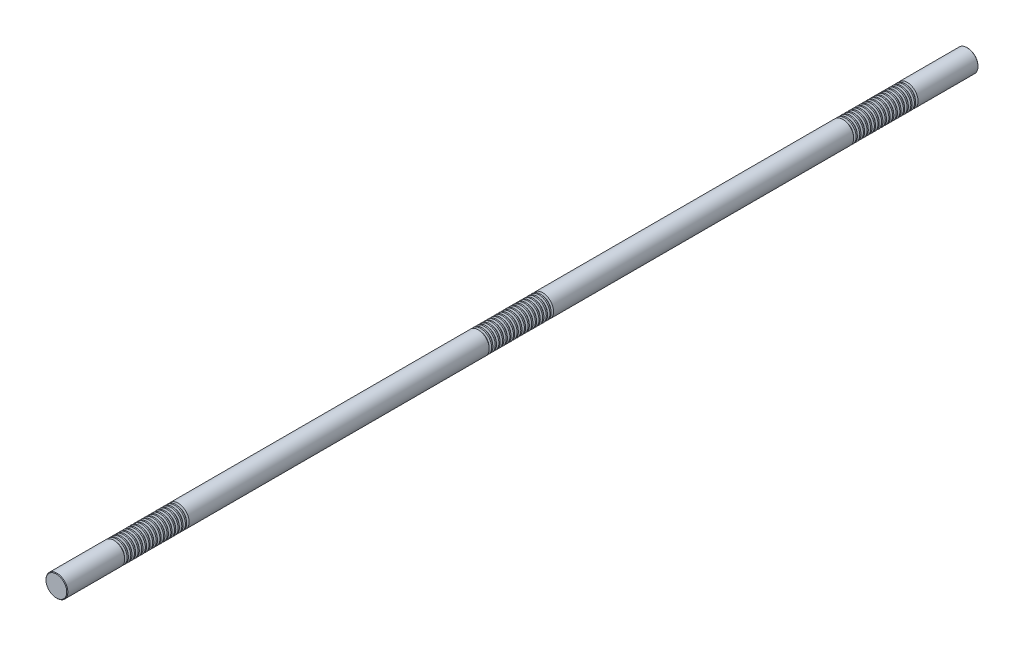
ISO-10303-21;
HEADER;
FILE_DESCRIPTION(('STEP AP214'),'2;1');
FILE_NAME('part.step','',(''),(''),'','','');
FILE_SCHEMA(('AUTOMOTIVE_DESIGN { 1 0 10303 214 1 1 1 1 }'));
ENDSEC;
DATA;
#1=APPLICATION_CONTEXT('core data for automotive mechanical design processes');
#2=APPLICATION_PROTOCOL_DEFINITION('international standard','automotive_design',2000,#1);
#3=PRODUCT_CONTEXT('',#1,'mechanical');
#4=PRODUCT('Part','Part','',(#3));
#5=PRODUCT_RELATED_PRODUCT_CATEGORY('part','',(#4));
#6=PRODUCT_DEFINITION_FORMATION('','',#4);
#7=PRODUCT_DEFINITION_CONTEXT('part definition',#1,'design');
#8=PRODUCT_DEFINITION('design','',#6,#7);
#9=PRODUCT_DEFINITION_SHAPE('','',#8);
#10=(LENGTH_UNIT() NAMED_UNIT(*) SI_UNIT(.MILLI.,.METRE.));
#11=(NAMED_UNIT(*) PLANE_ANGLE_UNIT() SI_UNIT($,.RADIAN.));
#12=(NAMED_UNIT(*) SI_UNIT($,.STERADIAN.) SOLID_ANGLE_UNIT());
#13=UNCERTAINTY_MEASURE_WITH_UNIT(LENGTH_MEASURE(1.E-05),#10,'distance_accuracy_value','');
#14=(GEOMETRIC_REPRESENTATION_CONTEXT(3) GLOBAL_UNCERTAINTY_ASSIGNED_CONTEXT((#13)) GLOBAL_UNIT_ASSIGNED_CONTEXT((#10,
#11,#12)) REPRESENTATION_CONTEXT('',''));
#15=CARTESIAN_POINT('',(0.,0.,0.));
#16=DIRECTION('',(0.,0.,1.));
#17=DIRECTION('',(1.,0.,0.));
#18=AXIS2_PLACEMENT_3D('',#15,#16,#17);
#19=CARTESIAN_POINT('',(0.,0.,750.));
#20=DIRECTION('',(0.,0.,-1.));
#21=DIRECTION('',(-1.,0.,0.));
#22=AXIS2_PLACEMENT_3D('',#19,#20,#21);
#23=CYLINDRICAL_SURFACE('',#22,18.);
#24=CARTESIAN_POINT('',(0.,0.,649.468911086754));
#25=DIRECTION('',(0.,0.,1.));
#26=DIRECTION('',(1.,0.,0.));
#27=AXIS2_PLACEMENT_3D('',#24,#25,#26);
#28=CIRCLE('',#27,18.);
#29=CARTESIAN_POINT('',(18.,0.,649.468911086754));
#30=VERTEX_POINT('',#29);
#31=EDGE_CURVE('E897',#30,#30,#28,.T.);
#32=ORIENTED_EDGE('',*,*,#31,.T.);
#33=EDGE_LOOP('',(#32));
#34=FACE_BOUND('',#33,.T.);
#35=CARTESIAN_POINT('',(0.,0.,651.531088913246));
#36=DIRECTION('',(0.,0.,1.));
#37=DIRECTION('',(1.,0.,0.));
#38=AXIS2_PLACEMENT_3D('',#35,#36,#37);
#39=CIRCLE('',#38,18.);
#40=CARTESIAN_POINT('',(18.,0.,651.531088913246));
#41=VERTEX_POINT('',#40);
#42=EDGE_CURVE('E909',#41,#41,#39,.T.);
#43=ORIENTED_EDGE('',*,*,#42,.F.);
#44=EDGE_LOOP('',(#43));
#45=FACE_BOUND('',#44,.T.);
#46=ADVANCED_FACE('F37',(#34,#45),#23,.T.);
#47=CARTESIAN_POINT('',(0.,0.,643.468911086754));
#48=DIRECTION('',(0.,0.,1.));
#49=DIRECTION('',(1.,0.,0.));
#50=AXIS2_PLACEMENT_3D('',#47,#48,#49);
#51=CIRCLE('',#50,18.);
#52=CARTESIAN_POINT('',(18.,0.,643.468911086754));
#53=VERTEX_POINT('',#52);
#54=EDGE_CURVE('E881',#53,#53,#51,.T.);
#55=ORIENTED_EDGE('',*,*,#54,.T.);
#56=EDGE_LOOP('',(#55));
#57=FACE_BOUND('',#56,.T.);
#58=CARTESIAN_POINT('',(0.,0.,645.531088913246));
#59=DIRECTION('',(0.,0.,1.));
#60=DIRECTION('',(1.,0.,0.));
#61=AXIS2_PLACEMENT_3D('',#58,#59,#60);
#62=CIRCLE('',#61,18.);
#63=CARTESIAN_POINT('',(18.,0.,645.531088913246));
#64=VERTEX_POINT('',#63);
#65=EDGE_CURVE('E893',#64,#64,#62,.T.);
#66=ORIENTED_EDGE('',*,*,#65,.F.);
#67=EDGE_LOOP('',(#66));
#68=FACE_BOUND('',#67,.T.);
#69=ADVANCED_FACE('F945',(#57,#68),#23,.T.);
#70=CARTESIAN_POINT('',(0.,0.,637.468911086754));
#71=DIRECTION('',(0.,0.,1.));
#72=DIRECTION('',(1.,0.,0.));
#73=AXIS2_PLACEMENT_3D('',#70,#71,#72);
#74=CIRCLE('',#73,18.);
#75=CARTESIAN_POINT('',(18.,0.,637.468911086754));
#76=VERTEX_POINT('',#75);
#77=EDGE_CURVE('E865',#76,#76,#74,.T.);
#78=ORIENTED_EDGE('',*,*,#77,.T.);
#79=EDGE_LOOP('',(#78));
#80=FACE_BOUND('',#79,.T.);
#81=CARTESIAN_POINT('',(0.,0.,639.531088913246));
#82=DIRECTION('',(0.,0.,1.));
#83=DIRECTION('',(1.,0.,0.));
#84=AXIS2_PLACEMENT_3D('',#81,#82,#83);
#85=CIRCLE('',#84,18.);
#86=CARTESIAN_POINT('',(18.,0.,639.531088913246));
#87=VERTEX_POINT('',#86);
#88=EDGE_CURVE('E877',#87,#87,#85,.T.);
#89=ORIENTED_EDGE('',*,*,#88,.F.);
#90=EDGE_LOOP('',(#89));
#91=FACE_BOUND('',#90,.T.);
#92=ADVANCED_FACE('F953',(#80,#91),#23,.T.);
#93=CARTESIAN_POINT('',(0.,0.,631.468911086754));
#94=DIRECTION('',(0.,0.,1.));
#95=DIRECTION('',(1.,0.,0.));
#96=AXIS2_PLACEMENT_3D('',#93,#94,#95);
#97=CIRCLE('',#96,18.);
#98=CARTESIAN_POINT('',(18.,0.,631.468911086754));
#99=VERTEX_POINT('',#98);
#100=EDGE_CURVE('E849',#99,#99,#97,.T.);
#101=ORIENTED_EDGE('',*,*,#100,.T.);
#102=EDGE_LOOP('',(#101));
#103=FACE_BOUND('',#102,.T.);
#104=CARTESIAN_POINT('',(0.,0.,633.531088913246));
#105=DIRECTION('',(0.,0.,1.));
#106=DIRECTION('',(1.,0.,0.));
#107=AXIS2_PLACEMENT_3D('',#104,#105,#106);
#108=CIRCLE('',#107,18.);
#109=CARTESIAN_POINT('',(18.,0.,633.531088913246));
#110=VERTEX_POINT('',#109);
#111=EDGE_CURVE('E861',#110,#110,#108,.T.);
#112=ORIENTED_EDGE('',*,*,#111,.F.);
#113=EDGE_LOOP('',(#112));
#114=FACE_BOUND('',#113,.T.);
#115=ADVANCED_FACE('F2098',(#103,#114),#23,.T.);
#116=CARTESIAN_POINT('',(0.,0.,625.468911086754));
#117=DIRECTION('',(0.,0.,1.));
#118=DIRECTION('',(1.,0.,0.));
#119=AXIS2_PLACEMENT_3D('',#116,#117,#118);
#120=CIRCLE('',#119,18.);
#121=CARTESIAN_POINT('',(18.,0.,625.468911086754));
#122=VERTEX_POINT('',#121);
#123=EDGE_CURVE('E833',#122,#122,#120,.T.);
#124=ORIENTED_EDGE('',*,*,#123,.T.);
#125=EDGE_LOOP('',(#124));
#126=FACE_BOUND('',#125,.T.);
#127=CARTESIAN_POINT('',(0.,0.,627.531088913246));
#128=DIRECTION('',(0.,0.,1.));
#129=DIRECTION('',(1.,0.,0.));
#130=AXIS2_PLACEMENT_3D('',#127,#128,#129);
#131=CIRCLE('',#130,18.);
#132=CARTESIAN_POINT('',(18.,0.,627.531088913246));
#133=VERTEX_POINT('',#132);
#134=EDGE_CURVE('E845',#133,#133,#131,.T.);
#135=ORIENTED_EDGE('',*,*,#134,.F.);
#136=EDGE_LOOP('',(#135));
#137=FACE_BOUND('',#136,.T.);
#138=ADVANCED_FACE('F2075',(#126,#137),#23,.T.);
#139=CARTESIAN_POINT('',(0.,0.,619.468911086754));
#140=DIRECTION('',(0.,0.,1.));
#141=DIRECTION('',(1.,0.,0.));
#142=AXIS2_PLACEMENT_3D('',#139,#140,#141);
#143=CIRCLE('',#142,18.);
#144=CARTESIAN_POINT('',(18.,0.,619.468911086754));
#145=VERTEX_POINT('',#144);
#146=EDGE_CURVE('E817',#145,#145,#143,.T.);
#147=ORIENTED_EDGE('',*,*,#146,.T.);
#148=EDGE_LOOP('',(#147));
#149=FACE_BOUND('',#148,.T.);
#150=CARTESIAN_POINT('',(0.,0.,621.531088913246));
#151=DIRECTION('',(0.,0.,1.));
#152=DIRECTION('',(1.,0.,0.));
#153=AXIS2_PLACEMENT_3D('',#150,#151,#152);
#154=CIRCLE('',#153,18.);
#155=CARTESIAN_POINT('',(18.,0.,621.531088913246));
#156=VERTEX_POINT('',#155);
#157=EDGE_CURVE('E829',#156,#156,#154,.T.);
#158=ORIENTED_EDGE('',*,*,#157,.F.);
#159=EDGE_LOOP('',(#158));
#160=FACE_BOUND('',#159,.T.);
#161=ADVANCED_FACE('F2052',(#149,#160),#23,.T.);
#162=CARTESIAN_POINT('',(0.,0.,613.468911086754));
#163=DIRECTION('',(0.,0.,1.));
#164=DIRECTION('',(1.,0.,0.));
#165=AXIS2_PLACEMENT_3D('',#162,#163,#164);
#166=CIRCLE('',#165,18.);
#167=CARTESIAN_POINT('',(18.,0.,613.468911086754));
#168=VERTEX_POINT('',#167);
#169=EDGE_CURVE('E801',#168,#168,#166,.T.);
#170=ORIENTED_EDGE('',*,*,#169,.T.);
#171=EDGE_LOOP('',(#170));
#172=FACE_BOUND('',#171,.T.);
#173=CARTESIAN_POINT('',(0.,0.,615.531088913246));
#174=DIRECTION('',(0.,0.,1.));
#175=DIRECTION('',(1.,0.,0.));
#176=AXIS2_PLACEMENT_3D('',#173,#174,#175);
#177=CIRCLE('',#176,18.);
#178=CARTESIAN_POINT('',(18.,0.,615.531088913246));
#179=VERTEX_POINT('',#178);
#180=EDGE_CURVE('E813',#179,#179,#177,.T.);
#181=ORIENTED_EDGE('',*,*,#180,.F.);
#182=EDGE_LOOP('',(#181));
#183=FACE_BOUND('',#182,.T.);
#184=ADVANCED_FACE('F2029',(#172,#183),#23,.T.);
#185=CARTESIAN_POINT('',(0.,0.,607.468911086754));
#186=DIRECTION('',(0.,0.,1.));
#187=DIRECTION('',(1.,0.,0.));
#188=AXIS2_PLACEMENT_3D('',#185,#186,#187);
#189=CIRCLE('',#188,18.);
#190=CARTESIAN_POINT('',(18.,0.,607.468911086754));
#191=VERTEX_POINT('',#190);
#192=EDGE_CURVE('E785',#191,#191,#189,.T.);
#193=ORIENTED_EDGE('',*,*,#192,.T.);
#194=EDGE_LOOP('',(#193));
#195=FACE_BOUND('',#194,.T.);
#196=CARTESIAN_POINT('',(0.,0.,609.531088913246));
#197=DIRECTION('',(0.,0.,1.));
#198=DIRECTION('',(1.,0.,0.));
#199=AXIS2_PLACEMENT_3D('',#196,#197,#198);
#200=CIRCLE('',#199,18.);
#201=CARTESIAN_POINT('',(18.,0.,609.531088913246));
#202=VERTEX_POINT('',#201);
#203=EDGE_CURVE('E797',#202,#202,#200,.T.);
#204=ORIENTED_EDGE('',*,*,#203,.F.);
#205=EDGE_LOOP('',(#204));
#206=FACE_BOUND('',#205,.T.);
#207=ADVANCED_FACE('F2006',(#195,#206),#23,.T.);
#208=CARTESIAN_POINT('',(0.,0.,601.468911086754));
#209=DIRECTION('',(0.,0.,1.));
#210=DIRECTION('',(1.,0.,0.));
#211=AXIS2_PLACEMENT_3D('',#208,#209,#210);
#212=CIRCLE('',#211,18.);
#213=CARTESIAN_POINT('',(18.,0.,601.468911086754));
#214=VERTEX_POINT('',#213);
#215=EDGE_CURVE('E769',#214,#214,#212,.T.);
#216=ORIENTED_EDGE('',*,*,#215,.T.);
#217=EDGE_LOOP('',(#216));
#218=FACE_BOUND('',#217,.T.);
#219=CARTESIAN_POINT('',(0.,0.,603.531088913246));
#220=DIRECTION('',(0.,0.,1.));
#221=DIRECTION('',(1.,0.,0.));
#222=AXIS2_PLACEMENT_3D('',#219,#220,#221);
#223=CIRCLE('',#222,18.);
#224=CARTESIAN_POINT('',(18.,0.,603.531088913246));
#225=VERTEX_POINT('',#224);
#226=EDGE_CURVE('E781',#225,#225,#223,.T.);
#227=ORIENTED_EDGE('',*,*,#226,.F.);
#228=EDGE_LOOP('',(#227));
#229=FACE_BOUND('',#228,.T.);
#230=ADVANCED_FACE('F1983',(#218,#229),#23,.T.);
#231=CARTESIAN_POINT('',(0.,0.,595.468911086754));
#232=DIRECTION('',(0.,0.,1.));
#233=DIRECTION('',(1.,0.,0.));
#234=AXIS2_PLACEMENT_3D('',#231,#232,#233);
#235=CIRCLE('',#234,18.);
#236=CARTESIAN_POINT('',(18.,0.,595.468911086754));
#237=VERTEX_POINT('',#236);
#238=EDGE_CURVE('E753',#237,#237,#235,.T.);
#239=ORIENTED_EDGE('',*,*,#238,.T.);
#240=EDGE_LOOP('',(#239));
#241=FACE_BOUND('',#240,.T.);
#242=CARTESIAN_POINT('',(0.,0.,597.531088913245));
#243=DIRECTION('',(0.,0.,1.));
#244=DIRECTION('',(1.,0.,0.));
#245=AXIS2_PLACEMENT_3D('',#242,#243,#244);
#246=CIRCLE('',#245,18.);
#247=CARTESIAN_POINT('',(18.,0.,597.531088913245));
#248=VERTEX_POINT('',#247);
#249=EDGE_CURVE('E765',#248,#248,#246,.T.);
#250=ORIENTED_EDGE('',*,*,#249,.F.);
#251=EDGE_LOOP('',(#250));
#252=FACE_BOUND('',#251,.T.);
#253=ADVANCED_FACE('F1960',(#241,#252),#23,.T.);
#254=CARTESIAN_POINT('',(0.,0.,589.468911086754));
#255=DIRECTION('',(0.,0.,1.));
#256=DIRECTION('',(1.,0.,0.));
#257=AXIS2_PLACEMENT_3D('',#254,#255,#256);
#258=CIRCLE('',#257,18.);
#259=CARTESIAN_POINT('',(18.,0.,589.468911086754));
#260=VERTEX_POINT('',#259);
#261=EDGE_CURVE('E737',#260,#260,#258,.T.);
#262=ORIENTED_EDGE('',*,*,#261,.T.);
#263=EDGE_LOOP('',(#262));
#264=FACE_BOUND('',#263,.T.);
#265=CARTESIAN_POINT('',(0.,0.,591.531088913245));
#266=DIRECTION('',(0.,0.,1.));
#267=DIRECTION('',(1.,0.,0.));
#268=AXIS2_PLACEMENT_3D('',#265,#266,#267);
#269=CIRCLE('',#268,18.);
#270=CARTESIAN_POINT('',(18.,0.,591.531088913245));
#271=VERTEX_POINT('',#270);
#272=EDGE_CURVE('E749',#271,#271,#269,.T.);
#273=ORIENTED_EDGE('',*,*,#272,.F.);
#274=EDGE_LOOP('',(#273));
#275=FACE_BOUND('',#274,.T.);
#276=ADVANCED_FACE('F1937',(#264,#275),#23,.T.);
#277=CARTESIAN_POINT('',(0.,0.,583.468911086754));
#278=DIRECTION('',(0.,0.,1.));
#279=DIRECTION('',(1.,0.,0.));
#280=AXIS2_PLACEMENT_3D('',#277,#278,#279);
#281=CIRCLE('',#280,18.);
#282=CARTESIAN_POINT('',(18.,0.,583.468911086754));
#283=VERTEX_POINT('',#282);
#284=EDGE_CURVE('E721',#283,#283,#281,.T.);
#285=ORIENTED_EDGE('',*,*,#284,.T.);
#286=EDGE_LOOP('',(#285));
#287=FACE_BOUND('',#286,.T.);
#288=CARTESIAN_POINT('',(0.,0.,585.531088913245));
#289=DIRECTION('',(0.,0.,1.));
#290=DIRECTION('',(1.,0.,0.));
#291=AXIS2_PLACEMENT_3D('',#288,#289,#290);
#292=CIRCLE('',#291,18.);
#293=CARTESIAN_POINT('',(18.,0.,585.531088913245));
#294=VERTEX_POINT('',#293);
#295=EDGE_CURVE('E733',#294,#294,#292,.T.);
#296=ORIENTED_EDGE('',*,*,#295,.F.);
#297=EDGE_LOOP('',(#296));
#298=FACE_BOUND('',#297,.T.);
#299=ADVANCED_FACE('F1914',(#287,#298),#23,.T.);
#300=CARTESIAN_POINT('',(0.,0.,577.468911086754));
#301=DIRECTION('',(0.,0.,1.));
#302=DIRECTION('',(1.,0.,0.));
#303=AXIS2_PLACEMENT_3D('',#300,#301,#302);
#304=CIRCLE('',#303,18.);
#305=CARTESIAN_POINT('',(18.,0.,577.468911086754));
#306=VERTEX_POINT('',#305);
#307=EDGE_CURVE('E705',#306,#306,#304,.T.);
#308=ORIENTED_EDGE('',*,*,#307,.T.);
#309=EDGE_LOOP('',(#308));
#310=FACE_BOUND('',#309,.T.);
#311=CARTESIAN_POINT('',(0.,0.,579.531088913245));
#312=DIRECTION('',(0.,0.,1.));
#313=DIRECTION('',(1.,0.,0.));
#314=AXIS2_PLACEMENT_3D('',#311,#312,#313);
#315=CIRCLE('',#314,18.);
#316=CARTESIAN_POINT('',(18.,0.,579.531088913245));
#317=VERTEX_POINT('',#316);
#318=EDGE_CURVE('E717',#317,#317,#315,.T.);
#319=ORIENTED_EDGE('',*,*,#318,.F.);
#320=EDGE_LOOP('',(#319));
#321=FACE_BOUND('',#320,.T.);
#322=ADVANCED_FACE('F1891',(#310,#321),#23,.T.);
#323=CARTESIAN_POINT('',(0.,0.,571.468911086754));
#324=DIRECTION('',(0.,0.,1.));
#325=DIRECTION('',(1.,0.,0.));
#326=AXIS2_PLACEMENT_3D('',#323,#324,#325);
#327=CIRCLE('',#326,18.);
#328=CARTESIAN_POINT('',(18.,0.,571.468911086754));
#329=VERTEX_POINT('',#328);
#330=EDGE_CURVE('E689',#329,#329,#327,.T.);
#331=ORIENTED_EDGE('',*,*,#330,.T.);
#332=EDGE_LOOP('',(#331));
#333=FACE_BOUND('',#332,.T.);
#334=CARTESIAN_POINT('',(0.,0.,573.531088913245));
#335=DIRECTION('',(0.,0.,1.));
#336=DIRECTION('',(1.,0.,0.));
#337=AXIS2_PLACEMENT_3D('',#334,#335,#336);
#338=CIRCLE('',#337,18.);
#339=CARTESIAN_POINT('',(18.,0.,573.531088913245));
#340=VERTEX_POINT('',#339);
#341=EDGE_CURVE('E701',#340,#340,#338,.T.);
#342=ORIENTED_EDGE('',*,*,#341,.F.);
#343=EDGE_LOOP('',(#342));
#344=FACE_BOUND('',#343,.T.);
#345=ADVANCED_FACE('F1868',(#333,#344),#23,.T.);
#346=CARTESIAN_POINT('',(0.,0.,565.468911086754));
#347=DIRECTION('',(0.,0.,1.));
#348=DIRECTION('',(1.,0.,0.));
#349=AXIS2_PLACEMENT_3D('',#346,#347,#348);
#350=CIRCLE('',#349,18.);
#351=CARTESIAN_POINT('',(18.,0.,565.468911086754));
#352=VERTEX_POINT('',#351);
#353=EDGE_CURVE('E673',#352,#352,#350,.T.);
#354=ORIENTED_EDGE('',*,*,#353,.T.);
#355=EDGE_LOOP('',(#354));
#356=FACE_BOUND('',#355,.T.);
#357=CARTESIAN_POINT('',(0.,0.,567.531088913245));
#358=DIRECTION('',(0.,0.,1.));
#359=DIRECTION('',(1.,0.,0.));
#360=AXIS2_PLACEMENT_3D('',#357,#358,#359);
#361=CIRCLE('',#360,18.);
#362=CARTESIAN_POINT('',(18.,0.,567.531088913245));
#363=VERTEX_POINT('',#362);
#364=EDGE_CURVE('E685',#363,#363,#361,.T.);
#365=ORIENTED_EDGE('',*,*,#364,.F.);
#366=EDGE_LOOP('',(#365));
#367=FACE_BOUND('',#366,.T.);
#368=ADVANCED_FACE('F1845',(#356,#367),#23,.T.);
#369=CARTESIAN_POINT('',(0.,0.,559.468911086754));
#370=DIRECTION('',(0.,0.,1.));
#371=DIRECTION('',(1.,0.,0.));
#372=AXIS2_PLACEMENT_3D('',#369,#370,#371);
#373=CIRCLE('',#372,18.);
#374=CARTESIAN_POINT('',(18.,0.,559.468911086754));
#375=VERTEX_POINT('',#374);
#376=EDGE_CURVE('E657',#375,#375,#373,.T.);
#377=ORIENTED_EDGE('',*,*,#376,.T.);
#378=EDGE_LOOP('',(#377));
#379=FACE_BOUND('',#378,.T.);
#380=CARTESIAN_POINT('',(0.,0.,561.531088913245));
#381=DIRECTION('',(0.,0.,1.));
#382=DIRECTION('',(1.,0.,0.));
#383=AXIS2_PLACEMENT_3D('',#380,#381,#382);
#384=CIRCLE('',#383,18.);
#385=CARTESIAN_POINT('',(18.,0.,561.531088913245));
#386=VERTEX_POINT('',#385);
#387=EDGE_CURVE('E669',#386,#386,#384,.T.);
#388=ORIENTED_EDGE('',*,*,#387,.F.);
#389=EDGE_LOOP('',(#388));
#390=FACE_BOUND('',#389,.T.);
#391=ADVANCED_FACE('F1826',(#379,#390),#23,.T.);
#392=CARTESIAN_POINT('',(0.,0.,553.468911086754));
#393=DIRECTION('',(0.,0.,1.));
#394=DIRECTION('',(1.,0.,0.));
#395=AXIS2_PLACEMENT_3D('',#392,#393,#394);
#396=CIRCLE('',#395,18.);
#397=CARTESIAN_POINT('',(18.,0.,553.468911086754));
#398=VERTEX_POINT('',#397);
#399=EDGE_CURVE('E371',#398,#398,#396,.T.);
#400=ORIENTED_EDGE('',*,*,#399,.T.);
#401=EDGE_LOOP('',(#400));
#402=FACE_BOUND('',#401,.T.);
#403=CARTESIAN_POINT('',(0.,0.,555.531088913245));
#404=DIRECTION('',(0.,0.,1.));
#405=DIRECTION('',(1.,0.,0.));
#406=AXIS2_PLACEMENT_3D('',#403,#404,#405);
#407=CIRCLE('',#406,18.);
#408=CARTESIAN_POINT('',(18.,0.,555.531088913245));
#409=VERTEX_POINT('',#408);
#410=EDGE_CURVE('E654',#409,#409,#407,.T.);
#411=ORIENTED_EDGE('',*,*,#410,.F.);
#412=EDGE_LOOP('',(#411));
#413=FACE_BOUND('',#412,.T.);
#414=ADVANCED_FACE('F1775',(#402,#413),#23,.T.);
#415=CARTESIAN_POINT('',(0.,0.,49.4689110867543));
#416=DIRECTION('',(0.,0.,1.));
#417=DIRECTION('',(1.,0.,0.));
#418=AXIS2_PLACEMENT_3D('',#415,#416,#417);
#419=CIRCLE('',#418,18.);
#420=CARTESIAN_POINT('',(18.,0.,49.4689110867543));
#421=VERTEX_POINT('',#420);
#422=EDGE_CURVE('E626',#421,#421,#419,.T.);
#423=ORIENTED_EDGE('',*,*,#422,.T.);
#424=EDGE_LOOP('',(#423));
#425=FACE_BOUND('',#424,.T.);
#426=CARTESIAN_POINT('',(0.,0.,51.5310889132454));
#427=DIRECTION('',(0.,0.,1.));
#428=DIRECTION('',(1.,0.,0.));
#429=AXIS2_PLACEMENT_3D('',#426,#427,#428);
#430=CIRCLE('',#429,18.);
#431=CARTESIAN_POINT('',(18.,0.,51.5310889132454));
#432=VERTEX_POINT('',#431);
#433=EDGE_CURVE('E638',#432,#432,#430,.T.);
#434=ORIENTED_EDGE('',*,*,#433,.F.);
#435=EDGE_LOOP('',(#434));
#436=FACE_BOUND('',#435,.T.);
#437=ADVANCED_FACE('F1751',(#425,#436),#23,.T.);
#438=CARTESIAN_POINT('',(0.,0.,43.4689110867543));
#439=DIRECTION('',(0.,0.,1.));
#440=DIRECTION('',(1.,0.,0.));
#441=AXIS2_PLACEMENT_3D('',#438,#439,#440);
#442=CIRCLE('',#441,18.);
#443=CARTESIAN_POINT('',(18.,0.,43.4689110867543));
#444=VERTEX_POINT('',#443);
#445=EDGE_CURVE('E610',#444,#444,#442,.T.);
#446=ORIENTED_EDGE('',*,*,#445,.T.);
#447=EDGE_LOOP('',(#446));
#448=FACE_BOUND('',#447,.T.);
#449=CARTESIAN_POINT('',(0.,0.,45.5310889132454));
#450=DIRECTION('',(0.,0.,1.));
#451=DIRECTION('',(1.,0.,0.));
#452=AXIS2_PLACEMENT_3D('',#449,#450,#451);
#453=CIRCLE('',#452,18.);
#454=CARTESIAN_POINT('',(18.,0.,45.5310889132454));
#455=VERTEX_POINT('',#454);
#456=EDGE_CURVE('E622',#455,#455,#453,.T.);
#457=ORIENTED_EDGE('',*,*,#456,.F.);
#458=EDGE_LOOP('',(#457));
#459=FACE_BOUND('',#458,.T.);
#460=ADVANCED_FACE('F1728',(#448,#459),#23,.T.);
#461=CARTESIAN_POINT('',(0.,0.,37.4689110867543));
#462=DIRECTION('',(0.,0.,1.));
#463=DIRECTION('',(1.,0.,0.));
#464=AXIS2_PLACEMENT_3D('',#461,#462,#463);
#465=CIRCLE('',#464,18.);
#466=CARTESIAN_POINT('',(18.,0.,37.4689110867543));
#467=VERTEX_POINT('',#466);
#468=EDGE_CURVE('E594',#467,#467,#465,.T.);
#469=ORIENTED_EDGE('',*,*,#468,.T.);
#470=EDGE_LOOP('',(#469));
#471=FACE_BOUND('',#470,.T.);
#472=CARTESIAN_POINT('',(0.,0.,39.5310889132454));
#473=DIRECTION('',(0.,0.,1.));
#474=DIRECTION('',(1.,0.,0.));
#475=AXIS2_PLACEMENT_3D('',#472,#473,#474);
#476=CIRCLE('',#475,18.);
#477=CARTESIAN_POINT('',(18.,0.,39.5310889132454));
#478=VERTEX_POINT('',#477);
#479=EDGE_CURVE('E606',#478,#478,#476,.T.);
#480=ORIENTED_EDGE('',*,*,#479,.F.);
#481=EDGE_LOOP('',(#480));
#482=FACE_BOUND('',#481,.T.);
#483=ADVANCED_FACE('F1705',(#471,#482),#23,.T.);
#484=CARTESIAN_POINT('',(0.,0.,31.4689110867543));
#485=DIRECTION('',(0.,0.,1.));
#486=DIRECTION('',(1.,0.,0.));
#487=AXIS2_PLACEMENT_3D('',#484,#485,#486);
#488=CIRCLE('',#487,18.);
#489=CARTESIAN_POINT('',(18.,0.,31.4689110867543));
#490=VERTEX_POINT('',#489);
#491=EDGE_CURVE('E578',#490,#490,#488,.T.);
#492=ORIENTED_EDGE('',*,*,#491,.T.);
#493=EDGE_LOOP('',(#492));
#494=FACE_BOUND('',#493,.T.);
#495=CARTESIAN_POINT('',(0.,0.,33.5310889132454));
#496=DIRECTION('',(0.,0.,1.));
#497=DIRECTION('',(1.,0.,0.));
#498=AXIS2_PLACEMENT_3D('',#495,#496,#497);
#499=CIRCLE('',#498,18.);
#500=CARTESIAN_POINT('',(18.,0.,33.5310889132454));
#501=VERTEX_POINT('',#500);
#502=EDGE_CURVE('E590',#501,#501,#499,.T.);
#503=ORIENTED_EDGE('',*,*,#502,.F.);
#504=EDGE_LOOP('',(#503));
#505=FACE_BOUND('',#504,.T.);
#506=ADVANCED_FACE('F1682',(#494,#505),#23,.T.);
#507=CARTESIAN_POINT('',(0.,0.,25.4689110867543));
#508=DIRECTION('',(0.,0.,1.));
#509=DIRECTION('',(1.,0.,0.));
#510=AXIS2_PLACEMENT_3D('',#507,#508,#509);
#511=CIRCLE('',#510,18.);
#512=CARTESIAN_POINT('',(18.,0.,25.4689110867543));
#513=VERTEX_POINT('',#512);
#514=EDGE_CURVE('E563',#513,#513,#511,.T.);
#515=ORIENTED_EDGE('',*,*,#514,.T.);
#516=EDGE_LOOP('',(#515));
#517=FACE_BOUND('',#516,.T.);
#518=CARTESIAN_POINT('',(0.,0.,27.5310889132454));
#519=DIRECTION('',(0.,0.,1.));
#520=DIRECTION('',(1.,0.,0.));
#521=AXIS2_PLACEMENT_3D('',#518,#519,#520);
#522=CIRCLE('',#521,18.);
#523=CARTESIAN_POINT('',(18.,0.,27.5310889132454));
#524=VERTEX_POINT('',#523);
#525=EDGE_CURVE('E574',#524,#524,#522,.T.);
#526=ORIENTED_EDGE('',*,*,#525,.F.);
#527=EDGE_LOOP('',(#526));
#528=FACE_BOUND('',#527,.T.);
#529=ADVANCED_FACE('F1659',(#517,#528),#23,.T.);
#530=CARTESIAN_POINT('',(0.,0.,19.4689110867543));
#531=DIRECTION('',(0.,0.,1.));
#532=DIRECTION('',(1.,0.,0.));
#533=AXIS2_PLACEMENT_3D('',#530,#531,#532);
#534=CIRCLE('',#533,18.);
#535=CARTESIAN_POINT('',(18.,0.,19.4689110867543));
#536=VERTEX_POINT('',#535);
#537=EDGE_CURVE('E547',#536,#536,#534,.T.);
#538=ORIENTED_EDGE('',*,*,#537,.T.);
#539=EDGE_LOOP('',(#538));
#540=FACE_BOUND('',#539,.T.);
#541=CARTESIAN_POINT('',(0.,0.,21.5310889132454));
#542=DIRECTION('',(0.,0.,1.));
#543=DIRECTION('',(1.,0.,0.));
#544=AXIS2_PLACEMENT_3D('',#541,#542,#543);
#545=CIRCLE('',#544,18.);
#546=CARTESIAN_POINT('',(18.,0.,21.5310889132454));
#547=VERTEX_POINT('',#546);
#548=EDGE_CURVE('E559',#547,#547,#545,.T.);
#549=ORIENTED_EDGE('',*,*,#548,.F.);
#550=EDGE_LOOP('',(#549));
#551=FACE_BOUND('',#550,.T.);
#552=ADVANCED_FACE('F1636',(#540,#551),#23,.T.);
#553=CARTESIAN_POINT('',(0.,0.,13.4689110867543));
#554=DIRECTION('',(0.,0.,1.));
#555=DIRECTION('',(1.,0.,0.));
#556=AXIS2_PLACEMENT_3D('',#553,#554,#555);
#557=CIRCLE('',#556,18.);
#558=CARTESIAN_POINT('',(18.,0.,13.4689110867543));
#559=VERTEX_POINT('',#558);
#560=EDGE_CURVE('E531',#559,#559,#557,.T.);
#561=ORIENTED_EDGE('',*,*,#560,.T.);
#562=EDGE_LOOP('',(#561));
#563=FACE_BOUND('',#562,.T.);
#564=CARTESIAN_POINT('',(0.,0.,15.5310889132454));
#565=DIRECTION('',(0.,0.,1.));
#566=DIRECTION('',(1.,0.,0.));
#567=AXIS2_PLACEMENT_3D('',#564,#565,#566);
#568=CIRCLE('',#567,18.);
#569=CARTESIAN_POINT('',(18.,0.,15.5310889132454));
#570=VERTEX_POINT('',#569);
#571=EDGE_CURVE('E543',#570,#570,#568,.T.);
#572=ORIENTED_EDGE('',*,*,#571,.F.);
#573=EDGE_LOOP('',(#572));
#574=FACE_BOUND('',#573,.T.);
#575=ADVANCED_FACE('F1613',(#563,#574),#23,.T.);
#576=CARTESIAN_POINT('',(0.,0.,7.4689110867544));
#577=DIRECTION('',(0.,0.,1.));
#578=DIRECTION('',(1.,0.,0.));
#579=AXIS2_PLACEMENT_3D('',#576,#577,#578);
#580=CIRCLE('',#579,18.);
#581=CARTESIAN_POINT('',(18.,0.,7.4689110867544));
#582=VERTEX_POINT('',#581);
#583=EDGE_CURVE('E515',#582,#582,#580,.T.);
#584=ORIENTED_EDGE('',*,*,#583,.T.);
#585=EDGE_LOOP('',(#584));
#586=FACE_BOUND('',#585,.T.);
#587=CARTESIAN_POINT('',(0.,0.,9.53108891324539));
#588=DIRECTION('',(0.,0.,1.));
#589=DIRECTION('',(1.,0.,0.));
#590=AXIS2_PLACEMENT_3D('',#587,#588,#589);
#591=CIRCLE('',#590,18.);
#592=CARTESIAN_POINT('',(18.,0.,9.53108891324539));
#593=VERTEX_POINT('',#592);
#594=EDGE_CURVE('E527',#593,#593,#591,.T.);
#595=ORIENTED_EDGE('',*,*,#594,.F.);
#596=EDGE_LOOP('',(#595));
#597=FACE_BOUND('',#596,.T.);
#598=ADVANCED_FACE('F1590',(#586,#597),#23,.T.);
#599=CARTESIAN_POINT('',(0.,0.,1.4689110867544));
#600=DIRECTION('',(0.,0.,1.));
#601=DIRECTION('',(1.,0.,0.));
#602=AXIS2_PLACEMENT_3D('',#599,#600,#601);
#603=CIRCLE('',#602,18.);
#604=CARTESIAN_POINT('',(18.,0.,1.4689110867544));
#605=VERTEX_POINT('',#604);
#606=EDGE_CURVE('E499',#605,#605,#603,.T.);
#607=ORIENTED_EDGE('',*,*,#606,.T.);
#608=EDGE_LOOP('',(#607));
#609=FACE_BOUND('',#608,.T.);
#610=CARTESIAN_POINT('',(0.,0.,3.53108891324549));
#611=DIRECTION('',(0.,0.,1.));
#612=DIRECTION('',(1.,0.,0.));
#613=AXIS2_PLACEMENT_3D('',#610,#611,#612);
#614=CIRCLE('',#613,18.);
#615=CARTESIAN_POINT('',(18.,0.,3.53108891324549));
#616=VERTEX_POINT('',#615);
#617=EDGE_CURVE('E511',#616,#616,#614,.T.);
#618=ORIENTED_EDGE('',*,*,#617,.F.);
#619=EDGE_LOOP('',(#618));
#620=FACE_BOUND('',#619,.T.);
#621=ADVANCED_FACE('F1567',(#609,#620),#23,.T.);
#622=CARTESIAN_POINT('',(0.,0.,-4.53108891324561));
#623=DIRECTION('',(0.,0.,1.));
#624=DIRECTION('',(1.,0.,0.));
#625=AXIS2_PLACEMENT_3D('',#622,#623,#624);
#626=CIRCLE('',#625,18.);
#627=CARTESIAN_POINT('',(18.,0.,-4.53108891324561));
#628=VERTEX_POINT('',#627);
#629=EDGE_CURVE('E483',#628,#628,#626,.T.);
#630=ORIENTED_EDGE('',*,*,#629,.T.);
#631=EDGE_LOOP('',(#630));
#632=FACE_BOUND('',#631,.T.);
#633=CARTESIAN_POINT('',(0.,0.,-2.46891108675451));
#634=DIRECTION('',(0.,0.,1.));
#635=DIRECTION('',(1.,0.,0.));
#636=AXIS2_PLACEMENT_3D('',#633,#634,#635);
#637=CIRCLE('',#636,18.);
#638=CARTESIAN_POINT('',(18.,0.,-2.46891108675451));
#639=VERTEX_POINT('',#638);
#640=EDGE_CURVE('E495',#639,#639,#637,.T.);
#641=ORIENTED_EDGE('',*,*,#640,.F.);
#642=EDGE_LOOP('',(#641));
#643=FACE_BOUND('',#642,.T.);
#644=ADVANCED_FACE('F1544',(#632,#643),#23,.T.);
#645=CARTESIAN_POINT('',(0.,0.,-10.5310889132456));
#646=DIRECTION('',(0.,0.,1.));
#647=DIRECTION('',(1.,0.,0.));
#648=AXIS2_PLACEMENT_3D('',#645,#646,#647);
#649=CIRCLE('',#648,18.);
#650=CARTESIAN_POINT('',(18.,0.,-10.5310889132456));
#651=VERTEX_POINT('',#650);
#652=EDGE_CURVE('E467',#651,#651,#649,.T.);
#653=ORIENTED_EDGE('',*,*,#652,.T.);
#654=EDGE_LOOP('',(#653));
#655=FACE_BOUND('',#654,.T.);
#656=CARTESIAN_POINT('',(0.,0.,-8.46891108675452));
#657=DIRECTION('',(0.,0.,1.));
#658=DIRECTION('',(1.,0.,0.));
#659=AXIS2_PLACEMENT_3D('',#656,#657,#658);
#660=CIRCLE('',#659,18.);
#661=CARTESIAN_POINT('',(18.,0.,-8.46891108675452));
#662=VERTEX_POINT('',#661);
#663=EDGE_CURVE('E479',#662,#662,#660,.T.);
#664=ORIENTED_EDGE('',*,*,#663,.F.);
#665=EDGE_LOOP('',(#664));
#666=FACE_BOUND('',#665,.T.);
#667=ADVANCED_FACE('F1521',(#655,#666),#23,.T.);
#668=CARTESIAN_POINT('',(0.,0.,-16.5310889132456));
#669=DIRECTION('',(0.,0.,1.));
#670=DIRECTION('',(1.,0.,0.));
#671=AXIS2_PLACEMENT_3D('',#668,#669,#670);
#672=CIRCLE('',#671,18.);
#673=CARTESIAN_POINT('',(18.,0.,-16.5310889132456));
#674=VERTEX_POINT('',#673);
#675=EDGE_CURVE('E451',#674,#674,#672,.T.);
#676=ORIENTED_EDGE('',*,*,#675,.T.);
#677=EDGE_LOOP('',(#676));
#678=FACE_BOUND('',#677,.T.);
#679=CARTESIAN_POINT('',(0.,0.,-14.4689110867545));
#680=DIRECTION('',(0.,0.,1.));
#681=DIRECTION('',(1.,0.,0.));
#682=AXIS2_PLACEMENT_3D('',#679,#680,#681);
#683=CIRCLE('',#682,18.);
#684=CARTESIAN_POINT('',(18.,0.,-14.4689110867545));
#685=VERTEX_POINT('',#684);
#686=EDGE_CURVE('E463',#685,#685,#683,.T.);
#687=ORIENTED_EDGE('',*,*,#686,.F.);
#688=EDGE_LOOP('',(#687));
#689=FACE_BOUND('',#688,.T.);
#690=ADVANCED_FACE('F1498',(#678,#689),#23,.T.);
#691=CARTESIAN_POINT('',(0.,0.,-22.5310889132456));
#692=DIRECTION('',(0.,0.,1.));
#693=DIRECTION('',(1.,0.,0.));
#694=AXIS2_PLACEMENT_3D('',#691,#692,#693);
#695=CIRCLE('',#694,18.);
#696=CARTESIAN_POINT('',(18.,0.,-22.5310889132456));
#697=VERTEX_POINT('',#696);
#698=EDGE_CURVE('E435',#697,#697,#695,.T.);
#699=ORIENTED_EDGE('',*,*,#698,.T.);
#700=EDGE_LOOP('',(#699));
#701=FACE_BOUND('',#700,.T.);
#702=CARTESIAN_POINT('',(0.,0.,-20.4689110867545));
#703=DIRECTION('',(0.,0.,1.));
#704=DIRECTION('',(1.,0.,0.));
#705=AXIS2_PLACEMENT_3D('',#702,#703,#704);
#706=CIRCLE('',#705,18.);
#707=CARTESIAN_POINT('',(18.,0.,-20.4689110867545));
#708=VERTEX_POINT('',#707);
#709=EDGE_CURVE('E447',#708,#708,#706,.T.);
#710=ORIENTED_EDGE('',*,*,#709,.F.);
#711=EDGE_LOOP('',(#710));
#712=FACE_BOUND('',#711,.T.);
#713=ADVANCED_FACE('F1475',(#701,#712),#23,.T.);
#714=CARTESIAN_POINT('',(0.,0.,-28.5310889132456));
#715=DIRECTION('',(0.,0.,1.));
#716=DIRECTION('',(1.,0.,0.));
#717=AXIS2_PLACEMENT_3D('',#714,#715,#716);
#718=CIRCLE('',#717,18.);
#719=CARTESIAN_POINT('',(18.,0.,-28.5310889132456));
#720=VERTEX_POINT('',#719);
#721=EDGE_CURVE('E419',#720,#720,#718,.T.);
#722=ORIENTED_EDGE('',*,*,#721,.T.);
#723=EDGE_LOOP('',(#722));
#724=FACE_BOUND('',#723,.T.);
#725=CARTESIAN_POINT('',(0.,0.,-26.4689110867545));
#726=DIRECTION('',(0.,0.,1.));
#727=DIRECTION('',(1.,0.,0.));
#728=AXIS2_PLACEMENT_3D('',#725,#726,#727);
#729=CIRCLE('',#728,18.);
#730=CARTESIAN_POINT('',(18.,0.,-26.4689110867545));
#731=VERTEX_POINT('',#730);
#732=EDGE_CURVE('E431',#731,#731,#729,.T.);
#733=ORIENTED_EDGE('',*,*,#732,.F.);
#734=EDGE_LOOP('',(#733));
#735=FACE_BOUND('',#734,.T.);
#736=ADVANCED_FACE('F1452',(#724,#735),#23,.T.);
#737=CARTESIAN_POINT('',(0.,0.,-34.5310889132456));
#738=DIRECTION('',(0.,0.,1.));
#739=DIRECTION('',(1.,0.,0.));
#740=AXIS2_PLACEMENT_3D('',#737,#738,#739);
#741=CIRCLE('',#740,18.);
#742=CARTESIAN_POINT('',(18.,0.,-34.5310889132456));
#743=VERTEX_POINT('',#742);
#744=EDGE_CURVE('E403',#743,#743,#741,.T.);
#745=ORIENTED_EDGE('',*,*,#744,.T.);
#746=EDGE_LOOP('',(#745));
#747=FACE_BOUND('',#746,.T.);
#748=CARTESIAN_POINT('',(0.,0.,-32.4689110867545));
#749=DIRECTION('',(0.,0.,1.));
#750=DIRECTION('',(1.,0.,0.));
#751=AXIS2_PLACEMENT_3D('',#748,#749,#750);
#752=CIRCLE('',#751,18.);
#753=CARTESIAN_POINT('',(18.,0.,-32.4689110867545));
#754=VERTEX_POINT('',#753);
#755=EDGE_CURVE('E415',#754,#754,#752,.T.);
#756=ORIENTED_EDGE('',*,*,#755,.F.);
#757=EDGE_LOOP('',(#756));
#758=FACE_BOUND('',#757,.T.);
#759=ADVANCED_FACE('F1429',(#747,#758),#23,.T.);
#760=CARTESIAN_POINT('',(0.,0.,-40.5310889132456));
#761=DIRECTION('',(0.,0.,1.));
#762=DIRECTION('',(1.,0.,0.));
#763=AXIS2_PLACEMENT_3D('',#760,#761,#762);
#764=CIRCLE('',#763,18.);
#765=CARTESIAN_POINT('',(18.,0.,-40.5310889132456));
#766=VERTEX_POINT('',#765);
#767=EDGE_CURVE('E387',#766,#766,#764,.T.);
#768=ORIENTED_EDGE('',*,*,#767,.T.);
#769=EDGE_LOOP('',(#768));
#770=FACE_BOUND('',#769,.T.);
#771=CARTESIAN_POINT('',(0.,0.,-38.4689110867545));
#772=DIRECTION('',(0.,0.,1.));
#773=DIRECTION('',(1.,0.,0.));
#774=AXIS2_PLACEMENT_3D('',#771,#772,#773);
#775=CIRCLE('',#774,18.);
#776=CARTESIAN_POINT('',(18.,0.,-38.4689110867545));
#777=VERTEX_POINT('',#776);
#778=EDGE_CURVE('E399',#777,#777,#775,.T.);
#779=ORIENTED_EDGE('',*,*,#778,.F.);
#780=EDGE_LOOP('',(#779));
#781=FACE_BOUND('',#780,.T.);
#782=ADVANCED_FACE('F1406',(#770,#781),#23,.T.);
#783=CARTESIAN_POINT('',(0.,0.,-46.5310889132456));
#784=DIRECTION('',(0.,0.,1.));
#785=DIRECTION('',(1.,0.,0.));
#786=AXIS2_PLACEMENT_3D('',#783,#784,#785);
#787=CIRCLE('',#786,18.);
#788=CARTESIAN_POINT('',(18.,0.,-46.5310889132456));
#789=VERTEX_POINT('',#788);
#790=EDGE_CURVE('E355',#789,#789,#787,.T.);
#791=ORIENTED_EDGE('',*,*,#790,.T.);
#792=EDGE_LOOP('',(#791));
#793=FACE_BOUND('',#792,.T.);
#794=CARTESIAN_POINT('',(0.,0.,-44.4689110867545));
#795=DIRECTION('',(0.,0.,1.));
#796=DIRECTION('',(1.,0.,0.));
#797=AXIS2_PLACEMENT_3D('',#794,#795,#796);
#798=CIRCLE('',#797,18.);
#799=CARTESIAN_POINT('',(18.,0.,-44.4689110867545));
#800=VERTEX_POINT('',#799);
#801=EDGE_CURVE('E383',#800,#800,#798,.T.);
#802=ORIENTED_EDGE('',*,*,#801,.F.);
#803=EDGE_LOOP('',(#802));
#804=FACE_BOUND('',#803,.T.);
#805=ADVANCED_FACE('F1383',(#793,#804),#23,.T.);
#806=CARTESIAN_POINT('',(0.,0.,-544.531088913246));
#807=DIRECTION('',(0.,0.,1.));
#808=DIRECTION('',(1.,0.,0.));
#809=AXIS2_PLACEMENT_3D('',#806,#807,#808);
#810=CIRCLE('',#809,18.);
#811=CARTESIAN_POINT('',(18.,0.,-544.531088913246));
#812=VERTEX_POINT('',#811);
#813=EDGE_CURVE('E339',#812,#812,#810,.T.);
#814=ORIENTED_EDGE('',*,*,#813,.T.);
#815=EDGE_LOOP('',(#814));
#816=FACE_BOUND('',#815,.T.);
#817=CARTESIAN_POINT('',(0.,0.,-50.4689110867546));
#818=DIRECTION('',(0.,0.,1.));
#819=DIRECTION('',(1.,0.,0.));
#820=AXIS2_PLACEMENT_3D('',#817,#818,#819);
#821=CIRCLE('',#820,18.);
#822=CARTESIAN_POINT('',(18.,0.,-50.4689110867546));
#823=VERTEX_POINT('',#822);
#824=EDGE_CURVE('E351',#823,#823,#821,.T.);
#825=ORIENTED_EDGE('',*,*,#824,.F.);
#826=EDGE_LOOP('',(#825));
#827=FACE_BOUND('',#826,.T.);
#828=ADVANCED_FACE('F1360',(#816,#827),#23,.T.);
#829=CARTESIAN_POINT('',(0.,0.,-550.531088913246));
#830=DIRECTION('',(0.,0.,1.));
#831=DIRECTION('',(1.,0.,0.));
#832=AXIS2_PLACEMENT_3D('',#829,#830,#831);
#833=CIRCLE('',#832,18.);
#834=CARTESIAN_POINT('',(18.,0.,-550.531088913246));
#835=VERTEX_POINT('',#834);
#836=EDGE_CURVE('E323',#835,#835,#833,.T.);
#837=ORIENTED_EDGE('',*,*,#836,.T.);
#838=EDGE_LOOP('',(#837));
#839=FACE_BOUND('',#838,.T.);
#840=CARTESIAN_POINT('',(0.,0.,-548.468911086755));
#841=DIRECTION('',(0.,0.,1.));
#842=DIRECTION('',(1.,0.,0.));
#843=AXIS2_PLACEMENT_3D('',#840,#841,#842);
#844=CIRCLE('',#843,18.);
#845=CARTESIAN_POINT('',(18.,0.,-548.468911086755));
#846=VERTEX_POINT('',#845);
#847=EDGE_CURVE('E335',#846,#846,#844,.T.);
#848=ORIENTED_EDGE('',*,*,#847,.F.);
#849=EDGE_LOOP('',(#848));
#850=FACE_BOUND('',#849,.T.);
#851=ADVANCED_FACE('F1337',(#839,#850),#23,.T.);
#852=CARTESIAN_POINT('',(0.,0.,-556.531088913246));
#853=DIRECTION('',(0.,0.,1.));
#854=DIRECTION('',(1.,0.,0.));
#855=AXIS2_PLACEMENT_3D('',#852,#853,#854);
#856=CIRCLE('',#855,18.);
#857=CARTESIAN_POINT('',(18.,0.,-556.531088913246));
#858=VERTEX_POINT('',#857);
#859=EDGE_CURVE('E307',#858,#858,#856,.T.);
#860=ORIENTED_EDGE('',*,*,#859,.T.);
#861=EDGE_LOOP('',(#860));
#862=FACE_BOUND('',#861,.T.);
#863=CARTESIAN_POINT('',(0.,0.,-554.468911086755));
#864=DIRECTION('',(0.,0.,1.));
#865=DIRECTION('',(1.,0.,0.));
#866=AXIS2_PLACEMENT_3D('',#863,#864,#865);
#867=CIRCLE('',#866,18.);
#868=CARTESIAN_POINT('',(18.,0.,-554.468911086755));
#869=VERTEX_POINT('',#868);
#870=EDGE_CURVE('E319',#869,#869,#867,.T.);
#871=ORIENTED_EDGE('',*,*,#870,.F.);
#872=EDGE_LOOP('',(#871));
#873=FACE_BOUND('',#872,.T.);
#874=ADVANCED_FACE('F1314',(#862,#873),#23,.T.);
#875=CARTESIAN_POINT('',(0.,0.,-562.531088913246));
#876=DIRECTION('',(0.,0.,1.));
#877=DIRECTION('',(1.,0.,0.));
#878=AXIS2_PLACEMENT_3D('',#875,#876,#877);
#879=CIRCLE('',#878,18.);
#880=CARTESIAN_POINT('',(18.,0.,-562.531088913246));
#881=VERTEX_POINT('',#880);
#882=EDGE_CURVE('E291',#881,#881,#879,.T.);
#883=ORIENTED_EDGE('',*,*,#882,.T.);
#884=EDGE_LOOP('',(#883));
#885=FACE_BOUND('',#884,.T.);
#886=CARTESIAN_POINT('',(0.,0.,-560.468911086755));
#887=DIRECTION('',(0.,0.,1.));
#888=DIRECTION('',(1.,0.,0.));
#889=AXIS2_PLACEMENT_3D('',#886,#887,#888);
#890=CIRCLE('',#889,18.);
#891=CARTESIAN_POINT('',(18.,0.,-560.468911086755));
#892=VERTEX_POINT('',#891);
#893=EDGE_CURVE('E303',#892,#892,#890,.T.);
#894=ORIENTED_EDGE('',*,*,#893,.F.);
#895=EDGE_LOOP('',(#894));
#896=FACE_BOUND('',#895,.T.);
#897=ADVANCED_FACE('F1291',(#885,#896),#23,.T.);
#898=CARTESIAN_POINT('',(0.,0.,-568.531088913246));
#899=DIRECTION('',(0.,0.,1.));
#900=DIRECTION('',(1.,0.,0.));
#901=AXIS2_PLACEMENT_3D('',#898,#899,#900);
#902=CIRCLE('',#901,18.);
#903=CARTESIAN_POINT('',(18.,0.,-568.531088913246));
#904=VERTEX_POINT('',#903);
#905=EDGE_CURVE('E275',#904,#904,#902,.T.);
#906=ORIENTED_EDGE('',*,*,#905,.T.);
#907=EDGE_LOOP('',(#906));
#908=FACE_BOUND('',#907,.T.);
#909=CARTESIAN_POINT('',(0.,0.,-566.468911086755));
#910=DIRECTION('',(0.,0.,1.));
#911=DIRECTION('',(1.,0.,0.));
#912=AXIS2_PLACEMENT_3D('',#909,#910,#911);
#913=CIRCLE('',#912,18.);
#914=CARTESIAN_POINT('',(18.,0.,-566.468911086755));
#915=VERTEX_POINT('',#914);
#916=EDGE_CURVE('E287',#915,#915,#913,.T.);
#917=ORIENTED_EDGE('',*,*,#916,.F.);
#918=EDGE_LOOP('',(#917));
#919=FACE_BOUND('',#918,.T.);
#920=ADVANCED_FACE('F1268',(#908,#919),#23,.T.);
#921=CARTESIAN_POINT('',(0.,0.,-574.531088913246));
#922=DIRECTION('',(0.,0.,1.));
#923=DIRECTION('',(1.,0.,0.));
#924=AXIS2_PLACEMENT_3D('',#921,#922,#923);
#925=CIRCLE('',#924,18.);
#926=CARTESIAN_POINT('',(18.,0.,-574.531088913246));
#927=VERTEX_POINT('',#926);
#928=EDGE_CURVE('E259',#927,#927,#925,.T.);
#929=ORIENTED_EDGE('',*,*,#928,.T.);
#930=EDGE_LOOP('',(#929));
#931=FACE_BOUND('',#930,.T.);
#932=CARTESIAN_POINT('',(0.,0.,-572.468911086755));
#933=DIRECTION('',(0.,0.,1.));
#934=DIRECTION('',(1.,0.,0.));
#935=AXIS2_PLACEMENT_3D('',#932,#933,#934);
#936=CIRCLE('',#935,18.);
#937=CARTESIAN_POINT('',(18.,0.,-572.468911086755));
#938=VERTEX_POINT('',#937);
#939=EDGE_CURVE('E271',#938,#938,#936,.T.);
#940=ORIENTED_EDGE('',*,*,#939,.F.);
#941=EDGE_LOOP('',(#940));
#942=FACE_BOUND('',#941,.T.);
#943=ADVANCED_FACE('F1245',(#931,#942),#23,.T.);
#944=CARTESIAN_POINT('',(0.,0.,-580.531088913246));
#945=DIRECTION('',(0.,0.,1.));
#946=DIRECTION('',(1.,0.,0.));
#947=AXIS2_PLACEMENT_3D('',#944,#945,#946);
#948=CIRCLE('',#947,18.);
#949=CARTESIAN_POINT('',(18.,0.,-580.531088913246));
#950=VERTEX_POINT('',#949);
#951=EDGE_CURVE('E243',#950,#950,#948,.T.);
#952=ORIENTED_EDGE('',*,*,#951,.T.);
#953=EDGE_LOOP('',(#952));
#954=FACE_BOUND('',#953,.T.);
#955=CARTESIAN_POINT('',(0.,0.,-578.468911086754));
#956=DIRECTION('',(0.,0.,1.));
#957=DIRECTION('',(1.,0.,0.));
#958=AXIS2_PLACEMENT_3D('',#955,#956,#957);
#959=CIRCLE('',#958,18.);
#960=CARTESIAN_POINT('',(18.,0.,-578.468911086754));
#961=VERTEX_POINT('',#960);
#962=EDGE_CURVE('E255',#961,#961,#959,.T.);
#963=ORIENTED_EDGE('',*,*,#962,.F.);
#964=EDGE_LOOP('',(#963));
#965=FACE_BOUND('',#964,.T.);
#966=ADVANCED_FACE('F1222',(#954,#965),#23,.T.);
#967=CARTESIAN_POINT('',(0.,0.,-586.531088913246));
#968=DIRECTION('',(0.,0.,1.));
#969=DIRECTION('',(1.,0.,0.));
#970=AXIS2_PLACEMENT_3D('',#967,#968,#969);
#971=CIRCLE('',#970,18.);
#972=CARTESIAN_POINT('',(18.,0.,-586.531088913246));
#973=VERTEX_POINT('',#972);
#974=EDGE_CURVE('E228',#973,#973,#971,.T.);
#975=ORIENTED_EDGE('',*,*,#974,.T.);
#976=EDGE_LOOP('',(#975));
#977=FACE_BOUND('',#976,.T.);
#978=CARTESIAN_POINT('',(0.,0.,-584.468911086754));
#979=DIRECTION('',(0.,0.,1.));
#980=DIRECTION('',(1.,0.,0.));
#981=AXIS2_PLACEMENT_3D('',#978,#979,#980);
#982=CIRCLE('',#981,18.);
#983=CARTESIAN_POINT('',(18.,0.,-584.468911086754));
#984=VERTEX_POINT('',#983);
#985=EDGE_CURVE('E239',#984,#984,#982,.T.);
#986=ORIENTED_EDGE('',*,*,#985,.F.);
#987=EDGE_LOOP('',(#986));
#988=FACE_BOUND('',#987,.T.);
#989=ADVANCED_FACE('F1199',(#977,#988),#23,.T.);
#990=CARTESIAN_POINT('',(0.,0.,-592.531088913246));
#991=DIRECTION('',(0.,0.,1.));
#992=DIRECTION('',(1.,0.,0.));
#993=AXIS2_PLACEMENT_3D('',#990,#991,#992);
#994=CIRCLE('',#993,18.);
#995=CARTESIAN_POINT('',(18.,0.,-592.531088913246));
#996=VERTEX_POINT('',#995);
#997=EDGE_CURVE('E212',#996,#996,#994,.T.);
#998=ORIENTED_EDGE('',*,*,#997,.T.);
#999=EDGE_LOOP('',(#998));
#1000=FACE_BOUND('',#999,.T.);
#1001=CARTESIAN_POINT('',(0.,0.,-590.468911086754));
#1002=DIRECTION('',(0.,0.,1.));
#1003=DIRECTION('',(1.,0.,0.));
#1004=AXIS2_PLACEMENT_3D('',#1001,#1002,#1003);
#1005=CIRCLE('',#1004,18.);
#1006=CARTESIAN_POINT('',(18.,0.,-590.468911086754));
#1007=VERTEX_POINT('',#1006);
#1008=EDGE_CURVE('E224',#1007,#1007,#1005,.T.);
#1009=ORIENTED_EDGE('',*,*,#1008,.F.);
#1010=EDGE_LOOP('',(#1009));
#1011=FACE_BOUND('',#1010,.T.);
#1012=ADVANCED_FACE('F1176',(#1000,#1011),#23,.T.);
#1013=CARTESIAN_POINT('',(0.,0.,-598.531088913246));
#1014=DIRECTION('',(0.,0.,1.));
#1015=DIRECTION('',(1.,0.,0.));
#1016=AXIS2_PLACEMENT_3D('',#1013,#1014,#1015);
#1017=CIRCLE('',#1016,18.);
#1018=CARTESIAN_POINT('',(18.,0.,-598.531088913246));
#1019=VERTEX_POINT('',#1018);
#1020=EDGE_CURVE('E196',#1019,#1019,#1017,.T.);
#1021=ORIENTED_EDGE('',*,*,#1020,.T.);
#1022=EDGE_LOOP('',(#1021));
#1023=FACE_BOUND('',#1022,.T.);
#1024=CARTESIAN_POINT('',(0.,0.,-596.468911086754));
#1025=DIRECTION('',(0.,0.,1.));
#1026=DIRECTION('',(1.,0.,0.));
#1027=AXIS2_PLACEMENT_3D('',#1024,#1025,#1026);
#1028=CIRCLE('',#1027,18.);
#1029=CARTESIAN_POINT('',(18.,0.,-596.468911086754));
#1030=VERTEX_POINT('',#1029);
#1031=EDGE_CURVE('E208',#1030,#1030,#1028,.T.);
#1032=ORIENTED_EDGE('',*,*,#1031,.F.);
#1033=EDGE_LOOP('',(#1032));
#1034=FACE_BOUND('',#1033,.T.);
#1035=ADVANCED_FACE('F1153',(#1023,#1034),#23,.T.);
#1036=CARTESIAN_POINT('',(0.,0.,-604.531088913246));
#1037=DIRECTION('',(0.,0.,1.));
#1038=DIRECTION('',(1.,0.,0.));
#1039=AXIS2_PLACEMENT_3D('',#1036,#1037,#1038);
#1040=CIRCLE('',#1039,18.);
#1041=CARTESIAN_POINT('',(18.,0.,-604.531088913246));
#1042=VERTEX_POINT('',#1041);
#1043=EDGE_CURVE('E180',#1042,#1042,#1040,.T.);
#1044=ORIENTED_EDGE('',*,*,#1043,.T.);
#1045=EDGE_LOOP('',(#1044));
#1046=FACE_BOUND('',#1045,.T.);
#1047=CARTESIAN_POINT('',(0.,0.,-602.468911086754));
#1048=DIRECTION('',(0.,0.,1.));
#1049=DIRECTION('',(1.,0.,0.));
#1050=AXIS2_PLACEMENT_3D('',#1047,#1048,#1049);
#1051=CIRCLE('',#1050,18.);
#1052=CARTESIAN_POINT('',(18.,0.,-602.468911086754));
#1053=VERTEX_POINT('',#1052);
#1054=EDGE_CURVE('E192',#1053,#1053,#1051,.T.);
#1055=ORIENTED_EDGE('',*,*,#1054,.F.);
#1056=EDGE_LOOP('',(#1055));
#1057=FACE_BOUND('',#1056,.T.);
#1058=ADVANCED_FACE('F1130',(#1046,#1057),#23,.T.);
#1059=CARTESIAN_POINT('',(0.,0.,-610.531088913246));
#1060=DIRECTION('',(0.,0.,1.));
#1061=DIRECTION('',(1.,0.,0.));
#1062=AXIS2_PLACEMENT_3D('',#1059,#1060,#1061);
#1063=CIRCLE('',#1062,18.);
#1064=CARTESIAN_POINT('',(18.,0.,-610.531088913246));
#1065=VERTEX_POINT('',#1064);
#1066=EDGE_CURVE('E164',#1065,#1065,#1063,.T.);
#1067=ORIENTED_EDGE('',*,*,#1066,.T.);
#1068=EDGE_LOOP('',(#1067));
#1069=FACE_BOUND('',#1068,.T.);
#1070=CARTESIAN_POINT('',(0.,0.,-608.468911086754));
#1071=DIRECTION('',(0.,0.,1.));
#1072=DIRECTION('',(1.,0.,0.));
#1073=AXIS2_PLACEMENT_3D('',#1070,#1071,#1072);
#1074=CIRCLE('',#1073,18.);
#1075=CARTESIAN_POINT('',(18.,0.,-608.468911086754));
#1076=VERTEX_POINT('',#1075);
#1077=EDGE_CURVE('E176',#1076,#1076,#1074,.T.);
#1078=ORIENTED_EDGE('',*,*,#1077,.F.);
#1079=EDGE_LOOP('',(#1078));
#1080=FACE_BOUND('',#1079,.T.);
#1081=ADVANCED_FACE('F1107',(#1069,#1080),#23,.T.);
#1082=CARTESIAN_POINT('',(0.,0.,-616.531088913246));
#1083=DIRECTION('',(0.,0.,1.));
#1084=DIRECTION('',(1.,0.,0.));
#1085=AXIS2_PLACEMENT_3D('',#1082,#1083,#1084);
#1086=CIRCLE('',#1085,18.);
#1087=CARTESIAN_POINT('',(18.,0.,-616.531088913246));
#1088=VERTEX_POINT('',#1087);
#1089=EDGE_CURVE('E148',#1088,#1088,#1086,.T.);
#1090=ORIENTED_EDGE('',*,*,#1089,.T.);
#1091=EDGE_LOOP('',(#1090));
#1092=FACE_BOUND('',#1091,.T.);
#1093=CARTESIAN_POINT('',(0.,0.,-614.468911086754));
#1094=DIRECTION('',(0.,0.,1.));
#1095=DIRECTION('',(1.,0.,0.));
#1096=AXIS2_PLACEMENT_3D('',#1093,#1094,#1095);
#1097=CIRCLE('',#1096,18.);
#1098=CARTESIAN_POINT('',(18.,0.,-614.468911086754));
#1099=VERTEX_POINT('',#1098);
#1100=EDGE_CURVE('E160',#1099,#1099,#1097,.T.);
#1101=ORIENTED_EDGE('',*,*,#1100,.F.);
#1102=EDGE_LOOP('',(#1101));
#1103=FACE_BOUND('',#1102,.T.);
#1104=ADVANCED_FACE('F1084',(#1092,#1103),#23,.T.);
#1105=CARTESIAN_POINT('',(0.,0.,-622.531088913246));
#1106=DIRECTION('',(0.,0.,1.));
#1107=DIRECTION('',(1.,0.,0.));
#1108=AXIS2_PLACEMENT_3D('',#1105,#1106,#1107);
#1109=CIRCLE('',#1108,18.);
#1110=CARTESIAN_POINT('',(18.,0.,-622.531088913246));
#1111=VERTEX_POINT('',#1110);
#1112=EDGE_CURVE('E132',#1111,#1111,#1109,.T.);
#1113=ORIENTED_EDGE('',*,*,#1112,.T.);
#1114=EDGE_LOOP('',(#1113));
#1115=FACE_BOUND('',#1114,.T.);
#1116=CARTESIAN_POINT('',(0.,0.,-620.468911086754));
#1117=DIRECTION('',(0.,0.,1.));
#1118=DIRECTION('',(1.,0.,0.));
#1119=AXIS2_PLACEMENT_3D('',#1116,#1117,#1118);
#1120=CIRCLE('',#1119,18.);
#1121=CARTESIAN_POINT('',(18.,0.,-620.468911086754));
#1122=VERTEX_POINT('',#1121);
#1123=EDGE_CURVE('E144',#1122,#1122,#1120,.T.);
#1124=ORIENTED_EDGE('',*,*,#1123,.F.);
#1125=EDGE_LOOP('',(#1124));
#1126=FACE_BOUND('',#1125,.T.);
#1127=ADVANCED_FACE('F1061',(#1115,#1126),#23,.T.);
#1128=CARTESIAN_POINT('',(0.,0.,-628.531088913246));
#1129=DIRECTION('',(0.,0.,1.));
#1130=DIRECTION('',(1.,0.,0.));
#1131=AXIS2_PLACEMENT_3D('',#1128,#1129,#1130);
#1132=CIRCLE('',#1131,18.);
#1133=CARTESIAN_POINT('',(18.,0.,-628.531088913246));
#1134=VERTEX_POINT('',#1133);
#1135=EDGE_CURVE('E117',#1134,#1134,#1132,.T.);
#1136=ORIENTED_EDGE('',*,*,#1135,.T.);
#1137=EDGE_LOOP('',(#1136));
#1138=FACE_BOUND('',#1137,.T.);
#1139=CARTESIAN_POINT('',(0.,0.,-626.468911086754));
#1140=DIRECTION('',(0.,0.,1.));
#1141=DIRECTION('',(1.,0.,0.));
#1142=AXIS2_PLACEMENT_3D('',#1139,#1140,#1141);
#1143=CIRCLE('',#1142,18.);
#1144=CARTESIAN_POINT('',(18.,0.,-626.468911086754));
#1145=VERTEX_POINT('',#1144);
#1146=EDGE_CURVE('E128',#1145,#1145,#1143,.T.);
#1147=ORIENTED_EDGE('',*,*,#1146,.F.);
#1148=EDGE_LOOP('',(#1147));
#1149=FACE_BOUND('',#1148,.T.);
#1150=ADVANCED_FACE('F1038',(#1138,#1149),#23,.T.);
#1151=CARTESIAN_POINT('',(0.,0.,-634.531088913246));
#1152=DIRECTION('',(0.,0.,1.));
#1153=DIRECTION('',(1.,0.,0.));
#1154=AXIS2_PLACEMENT_3D('',#1151,#1152,#1153);
#1155=CIRCLE('',#1154,18.);
#1156=CARTESIAN_POINT('',(18.,0.,-634.531088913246));
#1157=VERTEX_POINT('',#1156);
#1158=EDGE_CURVE('E101',#1157,#1157,#1155,.T.);
#1159=ORIENTED_EDGE('',*,*,#1158,.T.);
#1160=EDGE_LOOP('',(#1159));
#1161=FACE_BOUND('',#1160,.T.);
#1162=CARTESIAN_POINT('',(0.,0.,-632.468911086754));
#1163=DIRECTION('',(0.,0.,1.));
#1164=DIRECTION('',(1.,0.,0.));
#1165=AXIS2_PLACEMENT_3D('',#1162,#1163,#1164);
#1166=CIRCLE('',#1165,18.);
#1167=CARTESIAN_POINT('',(18.,0.,-632.468911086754));
#1168=VERTEX_POINT('',#1167);
#1169=EDGE_CURVE('E113',#1168,#1168,#1166,.T.);
#1170=ORIENTED_EDGE('',*,*,#1169,.F.);
#1171=EDGE_LOOP('',(#1170));
#1172=FACE_BOUND('',#1171,.T.);
#1173=ADVANCED_FACE('F1015',(#1161,#1172),#23,.T.);
#1174=CARTESIAN_POINT('',(0.,0.,-640.531088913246));
#1175=DIRECTION('',(0.,0.,1.));
#1176=DIRECTION('',(1.,0.,0.));
#1177=AXIS2_PLACEMENT_3D('',#1174,#1175,#1176);
#1178=CIRCLE('',#1177,18.);
#1179=CARTESIAN_POINT('',(18.,0.,-640.531088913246));
#1180=VERTEX_POINT('',#1179);
#1181=EDGE_CURVE('E85',#1180,#1180,#1178,.T.);
#1182=ORIENTED_EDGE('',*,*,#1181,.T.);
#1183=EDGE_LOOP('',(#1182));
#1184=FACE_BOUND('',#1183,.T.);
#1185=CARTESIAN_POINT('',(0.,0.,-638.468911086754));
#1186=DIRECTION('',(0.,0.,1.));
#1187=DIRECTION('',(1.,0.,0.));
#1188=AXIS2_PLACEMENT_3D('',#1185,#1186,#1187);
#1189=CIRCLE('',#1188,18.);
#1190=CARTESIAN_POINT('',(18.,0.,-638.468911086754));
#1191=VERTEX_POINT('',#1190);
#1192=EDGE_CURVE('E97',#1191,#1191,#1189,.T.);
#1193=ORIENTED_EDGE('',*,*,#1192,.F.);
#1194=EDGE_LOOP('',(#1193));
#1195=FACE_BOUND('',#1194,.T.);
#1196=ADVANCED_FACE('F968',(#1184,#1195),#23,.T.);
#1197=CARTESIAN_POINT('',(0.,0.,-646.531088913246));
#1198=DIRECTION('',(0.,0.,1.));
#1199=DIRECTION('',(1.,0.,0.));
#1200=AXIS2_PLACEMENT_3D('',#1197,#1198,#1199);
#1201=CIRCLE('',#1200,18.);
#1202=CARTESIAN_POINT('',(18.,0.,-646.531088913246));
#1203=VERTEX_POINT('',#1202);
#1204=EDGE_CURVE('E69',#1203,#1203,#1201,.T.);
#1205=ORIENTED_EDGE('',*,*,#1204,.T.);
#1206=EDGE_LOOP('',(#1205));
#1207=FACE_BOUND('',#1206,.T.);
#1208=CARTESIAN_POINT('',(0.,0.,-644.468911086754));
#1209=DIRECTION('',(0.,0.,1.));
#1210=DIRECTION('',(1.,0.,0.));
#1211=AXIS2_PLACEMENT_3D('',#1208,#1209,#1210);
#1212=CIRCLE('',#1211,18.);
#1213=CARTESIAN_POINT('',(18.,0.,-644.468911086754));
#1214=VERTEX_POINT('',#1213);
#1215=EDGE_CURVE('E81',#1214,#1214,#1212,.T.);
#1216=ORIENTED_EDGE('',*,*,#1215,.F.);
#1217=EDGE_LOOP('',(#1216));
#1218=FACE_BOUND('',#1217,.T.);
#1219=ADVANCED_FACE('F961',(#1207,#1218),#23,.T.);
#1220=CARTESIAN_POINT('',(0.,0.,-749.1));
#1221=DIRECTION('',(0.,0.,1.));
#1222=DIRECTION('',(1.,0.,0.));
#1223=AXIS2_PLACEMENT_3D('',#1220,#1221,#1222);
#1224=CIRCLE('',#1223,18.);
#1225=CARTESIAN_POINT('',(17.9999999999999,0.,-749.1));
#1226=VERTEX_POINT('',#1225);
#1227=EDGE_CURVE('E52',#1226,#1226,#1224,.T.);
#1228=ORIENTED_EDGE('',*,*,#1227,.T.);
#1229=EDGE_LOOP('',(#1228));
#1230=FACE_BOUND('',#1229,.T.);
#1231=CARTESIAN_POINT('',(0.,0.,-650.468911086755));
#1232=DIRECTION('',(0.,0.,1.));
#1233=DIRECTION('',(1.,0.,0.));
#1234=AXIS2_PLACEMENT_3D('',#1231,#1232,#1233);
#1235=CIRCLE('',#1234,18.);
#1236=CARTESIAN_POINT('',(18.,0.,-650.468911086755));
#1237=VERTEX_POINT('',#1236);
#1238=EDGE_CURVE('E65',#1237,#1237,#1235,.T.);
#1239=ORIENTED_EDGE('',*,*,#1238,.F.);
#1240=EDGE_LOOP('',(#1239));
#1241=FACE_BOUND('',#1240,.T.);
#1242=ADVANCED_FACE('F949',(#1230,#1241),#23,.T.);
#1243=CARTESIAN_POINT('',(0.,0.,-750.));
#1244=DIRECTION('',(0.,0.,1.));
#1245=DIRECTION('',(1.,0.,0.));
#1246=AXIS2_PLACEMENT_3D('',#1243,#1244,#1245);
#1247=PLANE('',#1246);
#1248=CARTESIAN_POINT('',(0.,0.,-750.));
#1249=DIRECTION('',(0.,0.,1.));
#1250=DIRECTION('',(1.,0.,0.));
#1251=AXIS2_PLACEMENT_3D('',#1248,#1249,#1250);
#1252=CIRCLE('',#1251,17.0999999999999);
#1253=CARTESIAN_POINT('',(17.0999999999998,0.,-750.));
#1254=VERTEX_POINT('',#1253);
#1255=EDGE_CURVE('E45',#1254,#1254,#1252,.F.);
#1256=ORIENTED_EDGE('',*,*,#1255,.T.);
#1257=EDGE_LOOP('',(#1256));
#1258=FACE_BOUND('',#1257,.T.);
#1259=ADVANCED_FACE('F960',(#1258),#1247,.F.);
#1260=CARTESIAN_POINT('',(0.,0.,-749.1));
#1261=DIRECTION('',(0.,0.,1.));
#1262=DIRECTION('',(1.,0.,0.));
#1263=AXIS2_PLACEMENT_3D('',#1260,#1261,#1262);
#1264=CONICAL_SURFACE('',#1263,18.,0.785398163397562);
#1265=CARTESIAN_POINT('',(17.0999999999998,0.,-750.));
#1266=CARTESIAN_POINT('',(17.1093749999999,0.,-749.990625));
#1267=CARTESIAN_POINT('',(17.1187499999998,0.,-749.98125));
#1268=CARTESIAN_POINT('',(17.1374999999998,0.,-749.9625));
#1269=CARTESIAN_POINT('',(17.1468749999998,0.,-749.953125));
#1270=CARTESIAN_POINT('',(17.1656249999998,0.,-749.934375));
#1271=CARTESIAN_POINT('',(17.1749999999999,0.,-749.925));
#1272=CARTESIAN_POINT('',(17.1937499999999,0.,-749.90625));
#1273=CARTESIAN_POINT('',(17.2031249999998,0.,-749.896875));
#1274=CARTESIAN_POINT('',(17.2218749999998,0.,-749.878125));
#1275=CARTESIAN_POINT('',(17.2312499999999,0.,-749.86875));
#1276=CARTESIAN_POINT('',(17.2499999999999,0.,-749.85));
#1277=CARTESIAN_POINT('',(17.2593749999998,0.,-749.840625));
#1278=CARTESIAN_POINT('',(17.2781249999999,0.,-749.821875));
#1279=CARTESIAN_POINT('',(17.2874999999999,0.,-749.8125));
#1280=CARTESIAN_POINT('',(17.3062499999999,0.,-749.79375));
#1281=CARTESIAN_POINT('',(17.3156249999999,0.,-749.784375));
#1282=CARTESIAN_POINT('',(17.3343749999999,0.,-749.765625));
#1283=CARTESIAN_POINT('',(17.3437499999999,0.,-749.75625));
#1284=CARTESIAN_POINT('',(17.3624999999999,0.,-749.7375));
#1285=CARTESIAN_POINT('',(17.3718749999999,0.,-749.728125));
#1286=CARTESIAN_POINT('',(17.3906249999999,0.,-749.709375));
#1287=CARTESIAN_POINT('',(17.3999999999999,0.,-749.7));
#1288=CARTESIAN_POINT('',(17.4187499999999,0.,-749.68125));
#1289=CARTESIAN_POINT('',(17.4281249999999,0.,-749.671875));
#1290=CARTESIAN_POINT('',(17.4468749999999,0.,-749.653125));
#1291=CARTESIAN_POINT('',(17.4562499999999,0.,-749.64375));
#1292=CARTESIAN_POINT('',(17.4749999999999,0.,-749.625));
#1293=CARTESIAN_POINT('',(17.4843749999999,0.,-749.615625));
#1294=CARTESIAN_POINT('',(17.5031249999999,0.,-749.596875));
#1295=CARTESIAN_POINT('',(17.5124999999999,0.,-749.5875));
#1296=CARTESIAN_POINT('',(17.5312499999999,0.,-749.56875));
#1297=CARTESIAN_POINT('',(17.5406249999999,0.,-749.559375));
#1298=CARTESIAN_POINT('',(17.5593749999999,0.,-749.540625));
#1299=CARTESIAN_POINT('',(17.5687499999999,0.,-749.53125));
#1300=CARTESIAN_POINT('',(17.5874999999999,0.,-749.5125));
#1301=CARTESIAN_POINT('',(17.5968749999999,0.,-749.503125));
#1302=CARTESIAN_POINT('',(17.6156249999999,0.,-749.484375));
#1303=CARTESIAN_POINT('',(17.6249999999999,0.,-749.475));
#1304=CARTESIAN_POINT('',(17.6437499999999,0.,-749.45625));
#1305=CARTESIAN_POINT('',(17.6531249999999,0.,-749.446875));
#1306=CARTESIAN_POINT('',(17.6718749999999,0.,-749.428125));
#1307=CARTESIAN_POINT('',(17.6812499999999,0.,-749.41875));
#1308=CARTESIAN_POINT('',(17.6999999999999,0.,-749.4));
#1309=CARTESIAN_POINT('',(17.7093749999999,0.,-749.390625));
#1310=CARTESIAN_POINT('',(17.7281249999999,0.,-749.371875));
#1311=CARTESIAN_POINT('',(17.7374999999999,0.,-749.3625));
#1312=CARTESIAN_POINT('',(17.7562499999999,0.,-749.34375));
#1313=CARTESIAN_POINT('',(17.7656249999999,0.,-749.334375));
#1314=CARTESIAN_POINT('',(17.7843749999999,0.,-749.315625));
#1315=CARTESIAN_POINT('',(17.7937499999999,0.,-749.30625));
#1316=CARTESIAN_POINT('',(17.8124999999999,0.,-749.2875));
#1317=CARTESIAN_POINT('',(17.8218749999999,0.,-749.278125));
#1318=CARTESIAN_POINT('',(17.8406249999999,0.,-749.259375));
#1319=CARTESIAN_POINT('',(17.8499999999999,0.,-749.25));
#1320=CARTESIAN_POINT('',(17.8687499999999,0.,-749.23125));
#1321=CARTESIAN_POINT('',(17.8781249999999,0.,-749.221875));
#1322=CARTESIAN_POINT('',(17.8968749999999,0.,-749.203125));
#1323=CARTESIAN_POINT('',(17.9062499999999,0.,-749.19375));
#1324=CARTESIAN_POINT('',(17.9249999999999,0.,-749.175));
#1325=CARTESIAN_POINT('',(17.9343749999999,0.,-749.165625));
#1326=CARTESIAN_POINT('',(17.953125,0.,-749.146875));
#1327=CARTESIAN_POINT('',(17.9624999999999,0.,-749.1375));
#1328=CARTESIAN_POINT('',(17.9812499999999,0.,-749.11875));
#1329=CARTESIAN_POINT('',(17.9906249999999,0.,-749.109375));
#1330=CARTESIAN_POINT('',(17.9999999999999,0.,-749.1));
#1331=B_SPLINE_CURVE_WITH_KNOTS('',3,(#1265,#1266,#1267,#1268,#1269,#1270,#1271,#1272,#1273,
#1274,#1275,#1276,#1277,#1278,#1279,#1280,#1281,#1282,#1283,#1284,#1285,#1286,#1287,#1288,#1289,
#1290,#1291,#1292,#1293,#1294,#1295,#1296,#1297,#1298,#1299,#1300,#1301,#1302,#1303,#1304,#1305,
#1306,#1307,#1308,#1309,#1310,#1311,#1312,#1313,#1314,#1315,#1316,#1317,#1318,#1319,#1320,#1321,
#1322,#1323,#1324,#1325,#1326,#1327,#1328,#1329,#1330),.UNSPECIFIED.,.F.,.F.,(4,2,2,2,2,2,2,2,2,
2,2,2,2,2,2,2,2,2,2,2,2,2,2,2,2,2,2,2,2,2,2,2,4),(0.,0.0397747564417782,0.0795495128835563,
0.119324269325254,0.159099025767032,0.198873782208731,0.23864853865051,0.278423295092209,
0.318198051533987,0.357972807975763,0.397747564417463,0.437522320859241,0.477297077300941,
0.517071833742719,0.556846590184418,0.596621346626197,0.636396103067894,0.676170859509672,
0.71594561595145,0.75572037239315,0.795495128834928,0.835269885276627,0.875044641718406,
0.914819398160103,0.954594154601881,0.994368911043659,1.03414366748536,1.07391842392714,
1.11369318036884,1.15346793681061,1.19324269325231,1.23301744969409,1.27279220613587),.UNSPECIFIED.);
#1332=EDGE_CURVE('BSEAM967',#1254,#1226,#1331,.T.);
#1333=ORIENTED_EDGE('',*,*,#1255,.F.);
#1334=ORIENTED_EDGE('',*,*,#1227,.F.);
#1335=ORIENTED_EDGE('',*,*,#1332,.T.);
#1336=ORIENTED_EDGE('',*,*,#1332,.F.);
#1337=EDGE_LOOP('',(#1333,#1335,#1334,#1336));
#1338=FACE_BOUND('',#1337,.T.);
#1339=ADVANCED_FACE('F967',(#1338),#1264,.T.);
#1340=CARTESIAN_POINT('',(0.,0.,-649.531088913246));
#1341=DIRECTION('',(0.,0.,-1.));
#1342=DIRECTION('',(-1.,0.,0.));
#1343=AXIS2_PLACEMENT_3D('',#1340,#1341,#1342);
#1344=CONICAL_SURFACE('',#1343,14.5,1.30899693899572);
#1345=ORIENTED_EDGE('',*,*,#1238,.T.);
#1346=EDGE_LOOP('',(#1345));
#1347=FACE_BOUND('',#1346,.T.);
#1348=CARTESIAN_POINT('',(0.,0.,-649.531088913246));
#1349=DIRECTION('',(0.,0.,1.));
#1350=DIRECTION('',(1.,0.,0.));
#1351=AXIS2_PLACEMENT_3D('',#1348,#1349,#1350);
#1352=CIRCLE('',#1351,14.5);
#1353=CARTESIAN_POINT('',(14.5,0.,-649.531088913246));
#1354=VERTEX_POINT('',#1353);
#1355=EDGE_CURVE('E77',#1354,#1354,#1352,.T.);
#1356=ORIENTED_EDGE('',*,*,#1355,.F.);
#1357=EDGE_LOOP('',(#1356));
#1358=FACE_BOUND('',#1357,.T.);
#1359=ADVANCED_FACE('F974',(#1347,#1358),#1344,.T.);
#1360=CARTESIAN_POINT('',(0.,0.,-646.531088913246));
#1361=DIRECTION('',(0.,0.,1.));
#1362=DIRECTION('',(1.,0.,0.));
#1363=AXIS2_PLACEMENT_3D('',#1360,#1361,#1362);
#1364=CONICAL_SURFACE('',#1363,18.,1.30899693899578);
#1365=CARTESIAN_POINT('',(0.,0.,-647.468911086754));
#1366=DIRECTION('',(0.,0.,1.));
#1367=DIRECTION('',(1.,0.,0.));
#1368=AXIS2_PLACEMENT_3D('',#1365,#1366,#1367);
#1369=CIRCLE('',#1368,14.5);
#1370=CARTESIAN_POINT('',(14.5,0.,-647.468911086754));
#1371=VERTEX_POINT('',#1370);
#1372=EDGE_CURVE('E73',#1371,#1371,#1369,.T.);
#1373=ORIENTED_EDGE('',*,*,#1372,.T.);
#1374=EDGE_LOOP('',(#1373));
#1375=FACE_BOUND('',#1374,.T.);
#1376=ORIENTED_EDGE('',*,*,#1204,.F.);
#1377=EDGE_LOOP('',(#1376));
#1378=FACE_BOUND('',#1377,.T.);
#1379=ADVANCED_FACE('F977',(#1375,#1378),#1364,.T.);
#1380=CARTESIAN_POINT('',(0.,0.,749.1));
#1381=DIRECTION('',(0.,0.,1.));
#1382=DIRECTION('',(1.,0.,0.));
#1383=AXIS2_PLACEMENT_3D('',#1380,#1381,#1382);
#1384=CYLINDRICAL_SURFACE('',#1383,14.5);
#1385=ORIENTED_EDGE('',*,*,#1355,.T.);
#1386=EDGE_LOOP('',(#1385));
#1387=FACE_BOUND('',#1386,.T.);
#1388=ORIENTED_EDGE('',*,*,#1372,.F.);
#1389=EDGE_LOOP('',(#1388));
#1390=FACE_BOUND('',#1389,.T.);
#1391=ADVANCED_FACE('F981',(#1387,#1390),#1384,.T.);
#1392=CARTESIAN_POINT('',(0.,0.,-643.531088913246));
#1393=DIRECTION('',(0.,0.,-1.));
#1394=DIRECTION('',(-1.,0.,0.));
#1395=AXIS2_PLACEMENT_3D('',#1392,#1393,#1394);
#1396=CONICAL_SURFACE('',#1395,14.5,1.30899693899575);
#1397=ORIENTED_EDGE('',*,*,#1215,.T.);
#1398=EDGE_LOOP('',(#1397));
#1399=FACE_BOUND('',#1398,.T.);
#1400=CARTESIAN_POINT('',(0.,0.,-643.531088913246));
#1401=DIRECTION('',(0.,0.,1.));
#1402=DIRECTION('',(1.,0.,0.));
#1403=AXIS2_PLACEMENT_3D('',#1400,#1401,#1402);
#1404=CIRCLE('',#1403,14.5);
#1405=CARTESIAN_POINT('',(14.5,0.,-643.531088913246));
#1406=VERTEX_POINT('',#1405);
#1407=EDGE_CURVE('E93',#1406,#1406,#1404,.T.);
#1408=ORIENTED_EDGE('',*,*,#1407,.F.);
#1409=EDGE_LOOP('',(#1408));
#1410=FACE_BOUND('',#1409,.T.);
#1411=ADVANCED_FACE('F984',(#1399,#1410),#1396,.T.);
#1412=CARTESIAN_POINT('',(0.,0.,-640.531088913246));
#1413=DIRECTION('',(0.,0.,1.));
#1414=DIRECTION('',(1.,0.,0.));
#1415=AXIS2_PLACEMENT_3D('',#1412,#1413,#1414);
#1416=CONICAL_SURFACE('',#1415,18.,1.30899693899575);
#1417=CARTESIAN_POINT('',(0.,0.,-641.468911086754));
#1418=DIRECTION('',(0.,0.,1.));
#1419=DIRECTION('',(1.,0.,0.));
#1420=AXIS2_PLACEMENT_3D('',#1417,#1418,#1419);
#1421=CIRCLE('',#1420,14.5);
#1422=CARTESIAN_POINT('',(14.5,0.,-641.468911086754));
#1423=VERTEX_POINT('',#1422);
#1424=EDGE_CURVE('E89',#1423,#1423,#1421,.T.);
#1425=ORIENTED_EDGE('',*,*,#1424,.T.);
#1426=EDGE_LOOP('',(#1425));
#1427=FACE_BOUND('',#1426,.T.);
#1428=ORIENTED_EDGE('',*,*,#1181,.F.);
#1429=EDGE_LOOP('',(#1428));
#1430=FACE_BOUND('',#1429,.T.);
#1431=ADVANCED_FACE('F997',(#1427,#1430),#1416,.T.);
#1432=CARTESIAN_POINT('',(0.,0.,-644.468911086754));
#1433=DIRECTION('',(0.,0.,1.));
#1434=DIRECTION('',(1.,0.,0.));
#1435=AXIS2_PLACEMENT_3D('',#1432,#1433,#1434);
#1436=CYLINDRICAL_SURFACE('',#1435,14.5);
#1437=ORIENTED_EDGE('',*,*,#1407,.T.);
#1438=EDGE_LOOP('',(#1437));
#1439=FACE_BOUND('',#1438,.T.);
#1440=ORIENTED_EDGE('',*,*,#1424,.F.);
#1441=EDGE_LOOP('',(#1440));
#1442=FACE_BOUND('',#1441,.T.);
#1443=ADVANCED_FACE('F1001',(#1439,#1442),#1436,.T.);
#1444=CARTESIAN_POINT('',(0.,0.,-637.531088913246));
#1445=DIRECTION('',(0.,0.,-1.));
#1446=DIRECTION('',(-1.,0.,0.));
#1447=AXIS2_PLACEMENT_3D('',#1444,#1445,#1446);
#1448=CONICAL_SURFACE('',#1447,14.5,1.30899693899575);
#1449=ORIENTED_EDGE('',*,*,#1192,.T.);
#1450=EDGE_LOOP('',(#1449));
#1451=FACE_BOUND('',#1450,.T.);
#1452=CARTESIAN_POINT('',(0.,0.,-637.531088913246));
#1453=DIRECTION('',(0.,0.,1.));
#1454=DIRECTION('',(1.,0.,0.));
#1455=AXIS2_PLACEMENT_3D('',#1452,#1453,#1454);
#1456=CIRCLE('',#1455,14.5);
#1457=CARTESIAN_POINT('',(14.5,0.,-637.531088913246));
#1458=VERTEX_POINT('',#1457);
#1459=EDGE_CURVE('E109',#1458,#1458,#1456,.T.);
#1460=ORIENTED_EDGE('',*,*,#1459,.F.);
#1461=EDGE_LOOP('',(#1460));
#1462=FACE_BOUND('',#1461,.T.);
#1463=ADVANCED_FACE('F1004',(#1451,#1462),#1448,.T.);
#1464=CARTESIAN_POINT('',(0.,0.,-634.531088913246));
#1465=DIRECTION('',(0.,0.,1.));
#1466=DIRECTION('',(1.,0.,0.));
#1467=AXIS2_PLACEMENT_3D('',#1464,#1465,#1466);
#1468=CONICAL_SURFACE('',#1467,18.,1.30899693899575);
#1469=CARTESIAN_POINT('',(0.,0.,-635.468911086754));
#1470=DIRECTION('',(0.,0.,1.));
#1471=DIRECTION('',(1.,0.,0.));
#1472=AXIS2_PLACEMENT_3D('',#1469,#1470,#1471);
#1473=CIRCLE('',#1472,14.5);
#1474=CARTESIAN_POINT('',(14.5,0.,-635.468911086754));
#1475=VERTEX_POINT('',#1474);
#1476=EDGE_CURVE('E105',#1475,#1475,#1473,.T.);
#1477=ORIENTED_EDGE('',*,*,#1476,.T.);
#1478=EDGE_LOOP('',(#1477));
#1479=FACE_BOUND('',#1478,.T.);
#1480=ORIENTED_EDGE('',*,*,#1158,.F.);
#1481=EDGE_LOOP('',(#1480));
#1482=FACE_BOUND('',#1481,.T.);
#1483=ADVANCED_FACE('F1020',(#1479,#1482),#1468,.T.);
#1484=CARTESIAN_POINT('',(0.,0.,-638.468911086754));
#1485=DIRECTION('',(0.,0.,1.));
#1486=DIRECTION('',(1.,0.,0.));
#1487=AXIS2_PLACEMENT_3D('',#1484,#1485,#1486);
#1488=CYLINDRICAL_SURFACE('',#1487,14.5);
#1489=ORIENTED_EDGE('',*,*,#1459,.T.);
#1490=EDGE_LOOP('',(#1489));
#1491=FACE_BOUND('',#1490,.T.);
#1492=ORIENTED_EDGE('',*,*,#1476,.F.);
#1493=EDGE_LOOP('',(#1492));
#1494=FACE_BOUND('',#1493,.T.);
#1495=ADVANCED_FACE('F1024',(#1491,#1494),#1488,.T.);
#1496=CARTESIAN_POINT('',(0.,0.,-631.531088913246));
#1497=DIRECTION('',(0.,0.,-1.));
#1498=DIRECTION('',(-1.,0.,0.));
#1499=AXIS2_PLACEMENT_3D('',#1496,#1497,#1498);
#1500=CONICAL_SURFACE('',#1499,14.5,1.30899693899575);
#1501=ORIENTED_EDGE('',*,*,#1169,.T.);
#1502=EDGE_LOOP('',(#1501));
#1503=FACE_BOUND('',#1502,.T.);
#1504=CARTESIAN_POINT('',(0.,0.,-631.531088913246));
#1505=DIRECTION('',(0.,0.,1.));
#1506=DIRECTION('',(1.,0.,0.));
#1507=AXIS2_PLACEMENT_3D('',#1504,#1505,#1506);
#1508=CIRCLE('',#1507,14.5);
#1509=CARTESIAN_POINT('',(14.5,0.,-631.531088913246));
#1510=VERTEX_POINT('',#1509);
#1511=EDGE_CURVE('E125',#1510,#1510,#1508,.T.);
#1512=ORIENTED_EDGE('',*,*,#1511,.F.);
#1513=EDGE_LOOP('',(#1512));
#1514=FACE_BOUND('',#1513,.T.);
#1515=ADVANCED_FACE('F1027',(#1503,#1514),#1500,.T.);
#1516=CARTESIAN_POINT('',(0.,0.,-628.531088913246));
#1517=DIRECTION('',(0.,0.,1.));
#1518=DIRECTION('',(1.,0.,0.));
#1519=AXIS2_PLACEMENT_3D('',#1516,#1517,#1518);
#1520=CONICAL_SURFACE('',#1519,18.,1.30899693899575);
#1521=CARTESIAN_POINT('',(0.,0.,-629.468911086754));
#1522=DIRECTION('',(0.,0.,1.));
#1523=DIRECTION('',(1.,0.,0.));
#1524=AXIS2_PLACEMENT_3D('',#1521,#1522,#1523);
#1525=CIRCLE('',#1524,14.5);
#1526=CARTESIAN_POINT('',(14.5,0.,-629.468911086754));
#1527=VERTEX_POINT('',#1526);
#1528=EDGE_CURVE('E121',#1527,#1527,#1525,.T.);
#1529=ORIENTED_EDGE('',*,*,#1528,.T.);
#1530=EDGE_LOOP('',(#1529));
#1531=FACE_BOUND('',#1530,.T.);
#1532=ORIENTED_EDGE('',*,*,#1135,.F.);
#1533=EDGE_LOOP('',(#1532));
#1534=FACE_BOUND('',#1533,.T.);
#1535=ADVANCED_FACE('F1043',(#1531,#1534),#1520,.T.);
#1536=CARTESIAN_POINT('',(0.,0.,-632.468911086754));
#1537=DIRECTION('',(0.,0.,1.));
#1538=DIRECTION('',(1.,0.,0.));
#1539=AXIS2_PLACEMENT_3D('',#1536,#1537,#1538);
#1540=CYLINDRICAL_SURFACE('',#1539,14.5);
#1541=ORIENTED_EDGE('',*,*,#1511,.T.);
#1542=EDGE_LOOP('',(#1541));
#1543=FACE_BOUND('',#1542,.T.);
#1544=ORIENTED_EDGE('',*,*,#1528,.F.);
#1545=EDGE_LOOP('',(#1544));
#1546=FACE_BOUND('',#1545,.T.);
#1547=ADVANCED_FACE('F1047',(#1543,#1546),#1540,.T.);
#1548=CARTESIAN_POINT('',(0.,0.,-625.531088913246));
#1549=DIRECTION('',(0.,0.,-1.));
#1550=DIRECTION('',(-1.,0.,0.));
#1551=AXIS2_PLACEMENT_3D('',#1548,#1549,#1550);
#1552=CONICAL_SURFACE('',#1551,14.5,1.30899693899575);
#1553=ORIENTED_EDGE('',*,*,#1146,.T.);
#1554=EDGE_LOOP('',(#1553));
#1555=FACE_BOUND('',#1554,.T.);
#1556=CARTESIAN_POINT('',(0.,0.,-625.531088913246));
#1557=DIRECTION('',(0.,0.,1.));
#1558=DIRECTION('',(1.,0.,0.));
#1559=AXIS2_PLACEMENT_3D('',#1556,#1557,#1558);
#1560=CIRCLE('',#1559,14.5);
#1561=CARTESIAN_POINT('',(14.5,0.,-625.531088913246));
#1562=VERTEX_POINT('',#1561);
#1563=EDGE_CURVE('E140',#1562,#1562,#1560,.T.);
#1564=ORIENTED_EDGE('',*,*,#1563,.F.);
#1565=EDGE_LOOP('',(#1564));
#1566=FACE_BOUND('',#1565,.T.);
#1567=ADVANCED_FACE('F1050',(#1555,#1566),#1552,.T.);
#1568=CARTESIAN_POINT('',(0.,0.,-622.531088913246));
#1569=DIRECTION('',(0.,0.,1.));
#1570=DIRECTION('',(1.,0.,0.));
#1571=AXIS2_PLACEMENT_3D('',#1568,#1569,#1570);
#1572=CONICAL_SURFACE('',#1571,18.,1.30899693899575);
#1573=CARTESIAN_POINT('',(0.,0.,-623.468911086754));
#1574=DIRECTION('',(0.,0.,1.));
#1575=DIRECTION('',(1.,0.,0.));
#1576=AXIS2_PLACEMENT_3D('',#1573,#1574,#1575);
#1577=CIRCLE('',#1576,14.5);
#1578=CARTESIAN_POINT('',(14.5,0.,-623.468911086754));
#1579=VERTEX_POINT('',#1578);
#1580=EDGE_CURVE('E136',#1579,#1579,#1577,.T.);
#1581=ORIENTED_EDGE('',*,*,#1580,.T.);
#1582=EDGE_LOOP('',(#1581));
#1583=FACE_BOUND('',#1582,.T.);
#1584=ORIENTED_EDGE('',*,*,#1112,.F.);
#1585=EDGE_LOOP('',(#1584));
#1586=FACE_BOUND('',#1585,.T.);
#1587=ADVANCED_FACE('F1066',(#1583,#1586),#1572,.T.);
#1588=CARTESIAN_POINT('',(0.,0.,-626.468911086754));
#1589=DIRECTION('',(0.,0.,1.));
#1590=DIRECTION('',(1.,0.,0.));
#1591=AXIS2_PLACEMENT_3D('',#1588,#1589,#1590);
#1592=CYLINDRICAL_SURFACE('',#1591,14.5);
#1593=ORIENTED_EDGE('',*,*,#1563,.T.);
#1594=EDGE_LOOP('',(#1593));
#1595=FACE_BOUND('',#1594,.T.);
#1596=ORIENTED_EDGE('',*,*,#1580,.F.);
#1597=EDGE_LOOP('',(#1596));
#1598=FACE_BOUND('',#1597,.T.);
#1599=ADVANCED_FACE('F1070',(#1595,#1598),#1592,.T.);
#1600=CARTESIAN_POINT('',(0.,0.,-619.531088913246));
#1601=DIRECTION('',(0.,0.,-1.));
#1602=DIRECTION('',(-1.,0.,0.));
#1603=AXIS2_PLACEMENT_3D('',#1600,#1601,#1602);
#1604=CONICAL_SURFACE('',#1603,14.5,1.30899693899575);
#1605=ORIENTED_EDGE('',*,*,#1123,.T.);
#1606=EDGE_LOOP('',(#1605));
#1607=FACE_BOUND('',#1606,.T.);
#1608=CARTESIAN_POINT('',(0.,0.,-619.531088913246));
#1609=DIRECTION('',(0.,0.,1.));
#1610=DIRECTION('',(1.,0.,0.));
#1611=AXIS2_PLACEMENT_3D('',#1608,#1609,#1610);
#1612=CIRCLE('',#1611,14.5);
#1613=CARTESIAN_POINT('',(14.5,0.,-619.531088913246));
#1614=VERTEX_POINT('',#1613);
#1615=EDGE_CURVE('E156',#1614,#1614,#1612,.T.);
#1616=ORIENTED_EDGE('',*,*,#1615,.F.);
#1617=EDGE_LOOP('',(#1616));
#1618=FACE_BOUND('',#1617,.T.);
#1619=ADVANCED_FACE('F1073',(#1607,#1618),#1604,.T.);
#1620=CARTESIAN_POINT('',(0.,0.,-616.531088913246));
#1621=DIRECTION('',(0.,0.,1.));
#1622=DIRECTION('',(1.,0.,0.));
#1623=AXIS2_PLACEMENT_3D('',#1620,#1621,#1622);
#1624=CONICAL_SURFACE('',#1623,18.,1.30899693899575);
#1625=CARTESIAN_POINT('',(0.,0.,-617.468911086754));
#1626=DIRECTION('',(0.,0.,1.));
#1627=DIRECTION('',(1.,0.,0.));
#1628=AXIS2_PLACEMENT_3D('',#1625,#1626,#1627);
#1629=CIRCLE('',#1628,14.5);
#1630=CARTESIAN_POINT('',(14.5,0.,-617.468911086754));
#1631=VERTEX_POINT('',#1630);
#1632=EDGE_CURVE('E152',#1631,#1631,#1629,.T.);
#1633=ORIENTED_EDGE('',*,*,#1632,.T.);
#1634=EDGE_LOOP('',(#1633));
#1635=FACE_BOUND('',#1634,.T.);
#1636=ORIENTED_EDGE('',*,*,#1089,.F.);
#1637=EDGE_LOOP('',(#1636));
#1638=FACE_BOUND('',#1637,.T.);
#1639=ADVANCED_FACE('F1089',(#1635,#1638),#1624,.T.);
#1640=CARTESIAN_POINT('',(0.,0.,-620.468911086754));
#1641=DIRECTION('',(0.,0.,1.));
#1642=DIRECTION('',(1.,0.,0.));
#1643=AXIS2_PLACEMENT_3D('',#1640,#1641,#1642);
#1644=CYLINDRICAL_SURFACE('',#1643,14.5);
#1645=ORIENTED_EDGE('',*,*,#1615,.T.);
#1646=EDGE_LOOP('',(#1645));
#1647=FACE_BOUND('',#1646,.T.);
#1648=ORIENTED_EDGE('',*,*,#1632,.F.);
#1649=EDGE_LOOP('',(#1648));
#1650=FACE_BOUND('',#1649,.T.);
#1651=ADVANCED_FACE('F1093',(#1647,#1650),#1644,.T.);
#1652=CARTESIAN_POINT('',(0.,0.,-613.531088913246));
#1653=DIRECTION('',(0.,0.,-1.));
#1654=DIRECTION('',(-1.,0.,0.));
#1655=AXIS2_PLACEMENT_3D('',#1652,#1653,#1654);
#1656=CONICAL_SURFACE('',#1655,14.5,1.30899693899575);
#1657=ORIENTED_EDGE('',*,*,#1100,.T.);
#1658=EDGE_LOOP('',(#1657));
#1659=FACE_BOUND('',#1658,.T.);
#1660=CARTESIAN_POINT('',(0.,0.,-613.531088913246));
#1661=DIRECTION('',(0.,0.,1.));
#1662=DIRECTION('',(1.,0.,0.));
#1663=AXIS2_PLACEMENT_3D('',#1660,#1661,#1662);
#1664=CIRCLE('',#1663,14.5);
#1665=CARTESIAN_POINT('',(14.5,0.,-613.531088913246));
#1666=VERTEX_POINT('',#1665);
#1667=EDGE_CURVE('E172',#1666,#1666,#1664,.T.);
#1668=ORIENTED_EDGE('',*,*,#1667,.F.);
#1669=EDGE_LOOP('',(#1668));
#1670=FACE_BOUND('',#1669,.T.);
#1671=ADVANCED_FACE('F1096',(#1659,#1670),#1656,.T.);
#1672=CARTESIAN_POINT('',(0.,0.,-610.531088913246));
#1673=DIRECTION('',(0.,0.,1.));
#1674=DIRECTION('',(1.,0.,0.));
#1675=AXIS2_PLACEMENT_3D('',#1672,#1673,#1674);
#1676=CONICAL_SURFACE('',#1675,18.,1.30899693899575);
#1677=CARTESIAN_POINT('',(0.,0.,-611.468911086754));
#1678=DIRECTION('',(0.,0.,1.));
#1679=DIRECTION('',(1.,0.,0.));
#1680=AXIS2_PLACEMENT_3D('',#1677,#1678,#1679);
#1681=CIRCLE('',#1680,14.5);
#1682=CARTESIAN_POINT('',(14.5,0.,-611.468911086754));
#1683=VERTEX_POINT('',#1682);
#1684=EDGE_CURVE('E168',#1683,#1683,#1681,.T.);
#1685=ORIENTED_EDGE('',*,*,#1684,.T.);
#1686=EDGE_LOOP('',(#1685));
#1687=FACE_BOUND('',#1686,.T.);
#1688=ORIENTED_EDGE('',*,*,#1066,.F.);
#1689=EDGE_LOOP('',(#1688));
#1690=FACE_BOUND('',#1689,.T.);
#1691=ADVANCED_FACE('F1112',(#1687,#1690),#1676,.T.);
#1692=CARTESIAN_POINT('',(0.,0.,-614.468911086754));
#1693=DIRECTION('',(0.,0.,1.));
#1694=DIRECTION('',(1.,0.,0.));
#1695=AXIS2_PLACEMENT_3D('',#1692,#1693,#1694);
#1696=CYLINDRICAL_SURFACE('',#1695,14.5);
#1697=ORIENTED_EDGE('',*,*,#1667,.T.);
#1698=EDGE_LOOP('',(#1697));
#1699=FACE_BOUND('',#1698,.T.);
#1700=ORIENTED_EDGE('',*,*,#1684,.F.);
#1701=EDGE_LOOP('',(#1700));
#1702=FACE_BOUND('',#1701,.T.);
#1703=ADVANCED_FACE('F1116',(#1699,#1702),#1696,.T.);
#1704=CARTESIAN_POINT('',(0.,0.,-607.531088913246));
#1705=DIRECTION('',(0.,0.,-1.));
#1706=DIRECTION('',(-1.,0.,0.));
#1707=AXIS2_PLACEMENT_3D('',#1704,#1705,#1706);
#1708=CONICAL_SURFACE('',#1707,14.5,1.30899693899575);
#1709=ORIENTED_EDGE('',*,*,#1077,.T.);
#1710=EDGE_LOOP('',(#1709));
#1711=FACE_BOUND('',#1710,.T.);
#1712=CARTESIAN_POINT('',(0.,0.,-607.531088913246));
#1713=DIRECTION('',(0.,0.,1.));
#1714=DIRECTION('',(1.,0.,0.));
#1715=AXIS2_PLACEMENT_3D('',#1712,#1713,#1714);
#1716=CIRCLE('',#1715,14.5);
#1717=CARTESIAN_POINT('',(14.5,0.,-607.531088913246));
#1718=VERTEX_POINT('',#1717);
#1719=EDGE_CURVE('E188',#1718,#1718,#1716,.T.);
#1720=ORIENTED_EDGE('',*,*,#1719,.F.);
#1721=EDGE_LOOP('',(#1720));
#1722=FACE_BOUND('',#1721,.T.);
#1723=ADVANCED_FACE('F1119',(#1711,#1722),#1708,.T.);
#1724=CARTESIAN_POINT('',(0.,0.,-604.531088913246));
#1725=DIRECTION('',(0.,0.,1.));
#1726=DIRECTION('',(1.,0.,0.));
#1727=AXIS2_PLACEMENT_3D('',#1724,#1725,#1726);
#1728=CONICAL_SURFACE('',#1727,18.,1.30899693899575);
#1729=CARTESIAN_POINT('',(0.,0.,-605.468911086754));
#1730=DIRECTION('',(0.,0.,1.));
#1731=DIRECTION('',(1.,0.,0.));
#1732=AXIS2_PLACEMENT_3D('',#1729,#1730,#1731);
#1733=CIRCLE('',#1732,14.5);
#1734=CARTESIAN_POINT('',(14.5,0.,-605.468911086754));
#1735=VERTEX_POINT('',#1734);
#1736=EDGE_CURVE('E184',#1735,#1735,#1733,.T.);
#1737=ORIENTED_EDGE('',*,*,#1736,.T.);
#1738=EDGE_LOOP('',(#1737));
#1739=FACE_BOUND('',#1738,.T.);
#1740=ORIENTED_EDGE('',*,*,#1043,.F.);
#1741=EDGE_LOOP('',(#1740));
#1742=FACE_BOUND('',#1741,.T.);
#1743=ADVANCED_FACE('F1135',(#1739,#1742),#1728,.T.);
#1744=CARTESIAN_POINT('',(0.,0.,-608.468911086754));
#1745=DIRECTION('',(0.,0.,1.));
#1746=DIRECTION('',(1.,0.,0.));
#1747=AXIS2_PLACEMENT_3D('',#1744,#1745,#1746);
#1748=CYLINDRICAL_SURFACE('',#1747,14.5);
#1749=ORIENTED_EDGE('',*,*,#1719,.T.);
#1750=EDGE_LOOP('',(#1749));
#1751=FACE_BOUND('',#1750,.T.);
#1752=ORIENTED_EDGE('',*,*,#1736,.F.);
#1753=EDGE_LOOP('',(#1752));
#1754=FACE_BOUND('',#1753,.T.);
#1755=ADVANCED_FACE('F1139',(#1751,#1754),#1748,.T.);
#1756=CARTESIAN_POINT('',(0.,0.,-601.531088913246));
#1757=DIRECTION('',(0.,0.,-1.));
#1758=DIRECTION('',(-1.,0.,0.));
#1759=AXIS2_PLACEMENT_3D('',#1756,#1757,#1758);
#1760=CONICAL_SURFACE('',#1759,14.5,1.30899693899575);
#1761=ORIENTED_EDGE('',*,*,#1054,.T.);
#1762=EDGE_LOOP('',(#1761));
#1763=FACE_BOUND('',#1762,.T.);
#1764=CARTESIAN_POINT('',(0.,0.,-601.531088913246));
#1765=DIRECTION('',(0.,0.,1.));
#1766=DIRECTION('',(1.,0.,0.));
#1767=AXIS2_PLACEMENT_3D('',#1764,#1765,#1766);
#1768=CIRCLE('',#1767,14.5);
#1769=CARTESIAN_POINT('',(14.5,0.,-601.531088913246));
#1770=VERTEX_POINT('',#1769);
#1771=EDGE_CURVE('E204',#1770,#1770,#1768,.T.);
#1772=ORIENTED_EDGE('',*,*,#1771,.F.);
#1773=EDGE_LOOP('',(#1772));
#1774=FACE_BOUND('',#1773,.T.);
#1775=ADVANCED_FACE('F1142',(#1763,#1774),#1760,.T.);
#1776=CARTESIAN_POINT('',(0.,0.,-598.531088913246));
#1777=DIRECTION('',(0.,0.,1.));
#1778=DIRECTION('',(1.,0.,0.));
#1779=AXIS2_PLACEMENT_3D('',#1776,#1777,#1778);
#1780=CONICAL_SURFACE('',#1779,18.,1.30899693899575);
#1781=CARTESIAN_POINT('',(0.,0.,-599.468911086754));
#1782=DIRECTION('',(0.,0.,1.));
#1783=DIRECTION('',(1.,0.,0.));
#1784=AXIS2_PLACEMENT_3D('',#1781,#1782,#1783);
#1785=CIRCLE('',#1784,14.5);
#1786=CARTESIAN_POINT('',(14.5,0.,-599.468911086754));
#1787=VERTEX_POINT('',#1786);
#1788=EDGE_CURVE('E200',#1787,#1787,#1785,.T.);
#1789=ORIENTED_EDGE('',*,*,#1788,.T.);
#1790=EDGE_LOOP('',(#1789));
#1791=FACE_BOUND('',#1790,.T.);
#1792=ORIENTED_EDGE('',*,*,#1020,.F.);
#1793=EDGE_LOOP('',(#1792));
#1794=FACE_BOUND('',#1793,.T.);
#1795=ADVANCED_FACE('F1158',(#1791,#1794),#1780,.T.);
#1796=CARTESIAN_POINT('',(0.,0.,-602.468911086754));
#1797=DIRECTION('',(0.,0.,1.));
#1798=DIRECTION('',(1.,0.,0.));
#1799=AXIS2_PLACEMENT_3D('',#1796,#1797,#1798);
#1800=CYLINDRICAL_SURFACE('',#1799,14.5);
#1801=ORIENTED_EDGE('',*,*,#1771,.T.);
#1802=EDGE_LOOP('',(#1801));
#1803=FACE_BOUND('',#1802,.T.);
#1804=ORIENTED_EDGE('',*,*,#1788,.F.);
#1805=EDGE_LOOP('',(#1804));
#1806=FACE_BOUND('',#1805,.T.);
#1807=ADVANCED_FACE('F1162',(#1803,#1806),#1800,.T.);
#1808=CARTESIAN_POINT('',(0.,0.,-595.531088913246));
#1809=DIRECTION('',(0.,0.,-1.));
#1810=DIRECTION('',(-1.,0.,0.));
#1811=AXIS2_PLACEMENT_3D('',#1808,#1809,#1810);
#1812=CONICAL_SURFACE('',#1811,14.5,1.30899693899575);
#1813=ORIENTED_EDGE('',*,*,#1031,.T.);
#1814=EDGE_LOOP('',(#1813));
#1815=FACE_BOUND('',#1814,.T.);
#1816=CARTESIAN_POINT('',(0.,0.,-595.531088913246));
#1817=DIRECTION('',(0.,0.,1.));
#1818=DIRECTION('',(1.,0.,0.));
#1819=AXIS2_PLACEMENT_3D('',#1816,#1817,#1818);
#1820=CIRCLE('',#1819,14.5);
#1821=CARTESIAN_POINT('',(14.5,0.,-595.531088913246));
#1822=VERTEX_POINT('',#1821);
#1823=EDGE_CURVE('E220',#1822,#1822,#1820,.T.);
#1824=ORIENTED_EDGE('',*,*,#1823,.F.);
#1825=EDGE_LOOP('',(#1824));
#1826=FACE_BOUND('',#1825,.T.);
#1827=ADVANCED_FACE('F1165',(#1815,#1826),#1812,.T.);
#1828=CARTESIAN_POINT('',(0.,0.,-592.531088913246));
#1829=DIRECTION('',(0.,0.,1.));
#1830=DIRECTION('',(1.,0.,0.));
#1831=AXIS2_PLACEMENT_3D('',#1828,#1829,#1830);
#1832=CONICAL_SURFACE('',#1831,18.,1.30899693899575);
#1833=CARTESIAN_POINT('',(0.,0.,-593.468911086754));
#1834=DIRECTION('',(0.,0.,1.));
#1835=DIRECTION('',(1.,0.,0.));
#1836=AXIS2_PLACEMENT_3D('',#1833,#1834,#1835);
#1837=CIRCLE('',#1836,14.5);
#1838=CARTESIAN_POINT('',(14.5,0.,-593.468911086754));
#1839=VERTEX_POINT('',#1838);
#1840=EDGE_CURVE('E216',#1839,#1839,#1837,.T.);
#1841=ORIENTED_EDGE('',*,*,#1840,.T.);
#1842=EDGE_LOOP('',(#1841));
#1843=FACE_BOUND('',#1842,.T.);
#1844=ORIENTED_EDGE('',*,*,#997,.F.);
#1845=EDGE_LOOP('',(#1844));
#1846=FACE_BOUND('',#1845,.T.);
#1847=ADVANCED_FACE('F1181',(#1843,#1846),#1832,.T.);
#1848=CARTESIAN_POINT('',(0.,0.,-596.468911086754));
#1849=DIRECTION('',(0.,0.,1.));
#1850=DIRECTION('',(1.,0.,0.));
#1851=AXIS2_PLACEMENT_3D('',#1848,#1849,#1850);
#1852=CYLINDRICAL_SURFACE('',#1851,14.5);
#1853=ORIENTED_EDGE('',*,*,#1823,.T.);
#1854=EDGE_LOOP('',(#1853));
#1855=FACE_BOUND('',#1854,.T.);
#1856=ORIENTED_EDGE('',*,*,#1840,.F.);
#1857=EDGE_LOOP('',(#1856));
#1858=FACE_BOUND('',#1857,.T.);
#1859=ADVANCED_FACE('F1185',(#1855,#1858),#1852,.T.);
#1860=CARTESIAN_POINT('',(0.,0.,-589.531088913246));
#1861=DIRECTION('',(0.,0.,-1.));
#1862=DIRECTION('',(-1.,0.,0.));
#1863=AXIS2_PLACEMENT_3D('',#1860,#1861,#1862);
#1864=CONICAL_SURFACE('',#1863,14.5,1.30899693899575);
#1865=ORIENTED_EDGE('',*,*,#1008,.T.);
#1866=EDGE_LOOP('',(#1865));
#1867=FACE_BOUND('',#1866,.T.);
#1868=CARTESIAN_POINT('',(0.,0.,-589.531088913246));
#1869=DIRECTION('',(0.,0.,1.));
#1870=DIRECTION('',(1.,0.,0.));
#1871=AXIS2_PLACEMENT_3D('',#1868,#1869,#1870);
#1872=CIRCLE('',#1871,14.5);
#1873=CARTESIAN_POINT('',(14.5,0.,-589.531088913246));
#1874=VERTEX_POINT('',#1873);
#1875=EDGE_CURVE('E235',#1874,#1874,#1872,.T.);
#1876=ORIENTED_EDGE('',*,*,#1875,.F.);
#1877=EDGE_LOOP('',(#1876));
#1878=FACE_BOUND('',#1877,.T.);
#1879=ADVANCED_FACE('F1188',(#1867,#1878),#1864,.T.);
#1880=CARTESIAN_POINT('',(0.,0.,-586.531088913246));
#1881=DIRECTION('',(0.,0.,1.));
#1882=DIRECTION('',(1.,0.,0.));
#1883=AXIS2_PLACEMENT_3D('',#1880,#1881,#1882);
#1884=CONICAL_SURFACE('',#1883,18.,1.30899693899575);
#1885=CARTESIAN_POINT('',(0.,0.,-587.468911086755));
#1886=DIRECTION('',(0.,0.,1.));
#1887=DIRECTION('',(1.,0.,0.));
#1888=AXIS2_PLACEMENT_3D('',#1885,#1886,#1887);
#1889=CIRCLE('',#1888,14.5);
#1890=CARTESIAN_POINT('',(14.5,0.,-587.468911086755));
#1891=VERTEX_POINT('',#1890);
#1892=EDGE_CURVE('E231',#1891,#1891,#1889,.T.);
#1893=ORIENTED_EDGE('',*,*,#1892,.T.);
#1894=EDGE_LOOP('',(#1893));
#1895=FACE_BOUND('',#1894,.T.);
#1896=ORIENTED_EDGE('',*,*,#974,.F.);
#1897=EDGE_LOOP('',(#1896));
#1898=FACE_BOUND('',#1897,.T.);
#1899=ADVANCED_FACE('F1204',(#1895,#1898),#1884,.T.);
#1900=CARTESIAN_POINT('',(0.,0.,-590.468911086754));
#1901=DIRECTION('',(0.,0.,1.));
#1902=DIRECTION('',(1.,0.,0.));
#1903=AXIS2_PLACEMENT_3D('',#1900,#1901,#1902);
#1904=CYLINDRICAL_SURFACE('',#1903,14.5);
#1905=ORIENTED_EDGE('',*,*,#1875,.T.);
#1906=EDGE_LOOP('',(#1905));
#1907=FACE_BOUND('',#1906,.T.);
#1908=ORIENTED_EDGE('',*,*,#1892,.F.);
#1909=EDGE_LOOP('',(#1908));
#1910=FACE_BOUND('',#1909,.T.);
#1911=ADVANCED_FACE('F1208',(#1907,#1910),#1904,.T.);
#1912=CARTESIAN_POINT('',(0.,0.,-583.531088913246));
#1913=DIRECTION('',(0.,0.,-1.));
#1914=DIRECTION('',(-1.,0.,0.));
#1915=AXIS2_PLACEMENT_3D('',#1912,#1913,#1914);
#1916=CONICAL_SURFACE('',#1915,14.5,1.30899693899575);
#1917=ORIENTED_EDGE('',*,*,#985,.T.);
#1918=EDGE_LOOP('',(#1917));
#1919=FACE_BOUND('',#1918,.T.);
#1920=CARTESIAN_POINT('',(0.,0.,-583.531088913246));
#1921=DIRECTION('',(0.,0.,1.));
#1922=DIRECTION('',(1.,0.,0.));
#1923=AXIS2_PLACEMENT_3D('',#1920,#1921,#1922);
#1924=CIRCLE('',#1923,14.5);
#1925=CARTESIAN_POINT('',(14.5,0.,-583.531088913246));
#1926=VERTEX_POINT('',#1925);
#1927=EDGE_CURVE('E251',#1926,#1926,#1924,.T.);
#1928=ORIENTED_EDGE('',*,*,#1927,.F.);
#1929=EDGE_LOOP('',(#1928));
#1930=FACE_BOUND('',#1929,.T.);
#1931=ADVANCED_FACE('F1211',(#1919,#1930),#1916,.T.);
#1932=CARTESIAN_POINT('',(0.,0.,-580.531088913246));
#1933=DIRECTION('',(0.,0.,1.));
#1934=DIRECTION('',(1.,0.,0.));
#1935=AXIS2_PLACEMENT_3D('',#1932,#1933,#1934);
#1936=CONICAL_SURFACE('',#1935,18.,1.30899693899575);
#1937=CARTESIAN_POINT('',(0.,0.,-581.468911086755));
#1938=DIRECTION('',(0.,0.,1.));
#1939=DIRECTION('',(1.,0.,0.));
#1940=AXIS2_PLACEMENT_3D('',#1937,#1938,#1939);
#1941=CIRCLE('',#1940,14.5);
#1942=CARTESIAN_POINT('',(14.5,0.,-581.468911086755));
#1943=VERTEX_POINT('',#1942);
#1944=EDGE_CURVE('E247',#1943,#1943,#1941,.T.);
#1945=ORIENTED_EDGE('',*,*,#1944,.T.);
#1946=EDGE_LOOP('',(#1945));
#1947=FACE_BOUND('',#1946,.T.);
#1948=ORIENTED_EDGE('',*,*,#951,.F.);
#1949=EDGE_LOOP('',(#1948));
#1950=FACE_BOUND('',#1949,.T.);
#1951=ADVANCED_FACE('F1227',(#1947,#1950),#1936,.T.);
#1952=CARTESIAN_POINT('',(0.,0.,-584.468911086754));
#1953=DIRECTION('',(0.,0.,1.));
#1954=DIRECTION('',(1.,0.,0.));
#1955=AXIS2_PLACEMENT_3D('',#1952,#1953,#1954);
#1956=CYLINDRICAL_SURFACE('',#1955,14.5);
#1957=ORIENTED_EDGE('',*,*,#1927,.T.);
#1958=EDGE_LOOP('',(#1957));
#1959=FACE_BOUND('',#1958,.T.);
#1960=ORIENTED_EDGE('',*,*,#1944,.F.);
#1961=EDGE_LOOP('',(#1960));
#1962=FACE_BOUND('',#1961,.T.);
#1963=ADVANCED_FACE('F1231',(#1959,#1962),#1956,.T.);
#1964=CARTESIAN_POINT('',(0.,0.,-577.531088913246));
#1965=DIRECTION('',(0.,0.,-1.));
#1966=DIRECTION('',(-1.,0.,0.));
#1967=AXIS2_PLACEMENT_3D('',#1964,#1965,#1966);
#1968=CONICAL_SURFACE('',#1967,14.5,1.30899693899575);
#1969=ORIENTED_EDGE('',*,*,#962,.T.);
#1970=EDGE_LOOP('',(#1969));
#1971=FACE_BOUND('',#1970,.T.);
#1972=CARTESIAN_POINT('',(0.,0.,-577.531088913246));
#1973=DIRECTION('',(0.,0.,1.));
#1974=DIRECTION('',(1.,0.,0.));
#1975=AXIS2_PLACEMENT_3D('',#1972,#1973,#1974);
#1976=CIRCLE('',#1975,14.5);
#1977=CARTESIAN_POINT('',(14.5,0.,-577.531088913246));
#1978=VERTEX_POINT('',#1977);
#1979=EDGE_CURVE('E267',#1978,#1978,#1976,.T.);
#1980=ORIENTED_EDGE('',*,*,#1979,.F.);
#1981=EDGE_LOOP('',(#1980));
#1982=FACE_BOUND('',#1981,.T.);
#1983=ADVANCED_FACE('F1234',(#1971,#1982),#1968,.T.);
#1984=CARTESIAN_POINT('',(0.,0.,-574.531088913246));
#1985=DIRECTION('',(0.,0.,1.));
#1986=DIRECTION('',(1.,0.,0.));
#1987=AXIS2_PLACEMENT_3D('',#1984,#1985,#1986);
#1988=CONICAL_SURFACE('',#1987,18.,1.30899693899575);
#1989=CARTESIAN_POINT('',(0.,0.,-575.468911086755));
#1990=DIRECTION('',(0.,0.,1.));
#1991=DIRECTION('',(1.,0.,0.));
#1992=AXIS2_PLACEMENT_3D('',#1989,#1990,#1991);
#1993=CIRCLE('',#1992,14.5);
#1994=CARTESIAN_POINT('',(14.5,0.,-575.468911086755));
#1995=VERTEX_POINT('',#1994);
#1996=EDGE_CURVE('E263',#1995,#1995,#1993,.T.);
#1997=ORIENTED_EDGE('',*,*,#1996,.T.);
#1998=EDGE_LOOP('',(#1997));
#1999=FACE_BOUND('',#1998,.T.);
#2000=ORIENTED_EDGE('',*,*,#928,.F.);
#2001=EDGE_LOOP('',(#2000));
#2002=FACE_BOUND('',#2001,.T.);
#2003=ADVANCED_FACE('F1250',(#1999,#2002),#1988,.T.);
#2004=CARTESIAN_POINT('',(0.,0.,-578.468911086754));
#2005=DIRECTION('',(0.,0.,1.));
#2006=DIRECTION('',(1.,0.,0.));
#2007=AXIS2_PLACEMENT_3D('',#2004,#2005,#2006);
#2008=CYLINDRICAL_SURFACE('',#2007,14.5);
#2009=ORIENTED_EDGE('',*,*,#1979,.T.);
#2010=EDGE_LOOP('',(#2009));
#2011=FACE_BOUND('',#2010,.T.);
#2012=ORIENTED_EDGE('',*,*,#1996,.F.);
#2013=EDGE_LOOP('',(#2012));
#2014=FACE_BOUND('',#2013,.T.);
#2015=ADVANCED_FACE('F1254',(#2011,#2014),#2008,.T.);
#2016=CARTESIAN_POINT('',(0.,0.,-571.531088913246));
#2017=DIRECTION('',(0.,0.,-1.));
#2018=DIRECTION('',(-1.,0.,0.));
#2019=AXIS2_PLACEMENT_3D('',#2016,#2017,#2018);
#2020=CONICAL_SURFACE('',#2019,14.5,1.30899693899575);
#2021=ORIENTED_EDGE('',*,*,#939,.T.);
#2022=EDGE_LOOP('',(#2021));
#2023=FACE_BOUND('',#2022,.T.);
#2024=CARTESIAN_POINT('',(0.,0.,-571.531088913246));
#2025=DIRECTION('',(0.,0.,1.));
#2026=DIRECTION('',(1.,0.,0.));
#2027=AXIS2_PLACEMENT_3D('',#2024,#2025,#2026);
#2028=CIRCLE('',#2027,14.5);
#2029=CARTESIAN_POINT('',(14.5,0.,-571.531088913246));
#2030=VERTEX_POINT('',#2029);
#2031=EDGE_CURVE('E283',#2030,#2030,#2028,.T.);
#2032=ORIENTED_EDGE('',*,*,#2031,.F.);
#2033=EDGE_LOOP('',(#2032));
#2034=FACE_BOUND('',#2033,.T.);
#2035=ADVANCED_FACE('F1257',(#2023,#2034),#2020,.T.);
#2036=CARTESIAN_POINT('',(0.,0.,-568.531088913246));
#2037=DIRECTION('',(0.,0.,1.));
#2038=DIRECTION('',(1.,0.,0.));
#2039=AXIS2_PLACEMENT_3D('',#2036,#2037,#2038);
#2040=CONICAL_SURFACE('',#2039,18.,1.30899693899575);
#2041=CARTESIAN_POINT('',(0.,0.,-569.468911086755));
#2042=DIRECTION('',(0.,0.,1.));
#2043=DIRECTION('',(1.,0.,0.));
#2044=AXIS2_PLACEMENT_3D('',#2041,#2042,#2043);
#2045=CIRCLE('',#2044,14.5);
#2046=CARTESIAN_POINT('',(14.5,0.,-569.468911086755));
#2047=VERTEX_POINT('',#2046);
#2048=EDGE_CURVE('E279',#2047,#2047,#2045,.T.);
#2049=ORIENTED_EDGE('',*,*,#2048,.T.);
#2050=EDGE_LOOP('',(#2049));
#2051=FACE_BOUND('',#2050,.T.);
#2052=ORIENTED_EDGE('',*,*,#905,.F.);
#2053=EDGE_LOOP('',(#2052));
#2054=FACE_BOUND('',#2053,.T.);
#2055=ADVANCED_FACE('F1273',(#2051,#2054),#2040,.T.);
#2056=CARTESIAN_POINT('',(0.,0.,-572.468911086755));
#2057=DIRECTION('',(0.,0.,1.));
#2058=DIRECTION('',(1.,0.,0.));
#2059=AXIS2_PLACEMENT_3D('',#2056,#2057,#2058);
#2060=CYLINDRICAL_SURFACE('',#2059,14.5);
#2061=ORIENTED_EDGE('',*,*,#2031,.T.);
#2062=EDGE_LOOP('',(#2061));
#2063=FACE_BOUND('',#2062,.T.);
#2064=ORIENTED_EDGE('',*,*,#2048,.F.);
#2065=EDGE_LOOP('',(#2064));
#2066=FACE_BOUND('',#2065,.T.);
#2067=ADVANCED_FACE('F1277',(#2063,#2066),#2060,.T.);
#2068=CARTESIAN_POINT('',(0.,0.,-565.531088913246));
#2069=DIRECTION('',(0.,0.,-1.));
#2070=DIRECTION('',(-1.,0.,0.));
#2071=AXIS2_PLACEMENT_3D('',#2068,#2069,#2070);
#2072=CONICAL_SURFACE('',#2071,14.5,1.30899693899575);
#2073=ORIENTED_EDGE('',*,*,#916,.T.);
#2074=EDGE_LOOP('',(#2073));
#2075=FACE_BOUND('',#2074,.T.);
#2076=CARTESIAN_POINT('',(0.,0.,-565.531088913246));
#2077=DIRECTION('',(0.,0.,1.));
#2078=DIRECTION('',(1.,0.,0.));
#2079=AXIS2_PLACEMENT_3D('',#2076,#2077,#2078);
#2080=CIRCLE('',#2079,14.5);
#2081=CARTESIAN_POINT('',(14.5,0.,-565.531088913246));
#2082=VERTEX_POINT('',#2081);
#2083=EDGE_CURVE('E299',#2082,#2082,#2080,.T.);
#2084=ORIENTED_EDGE('',*,*,#2083,.F.);
#2085=EDGE_LOOP('',(#2084));
#2086=FACE_BOUND('',#2085,.T.);
#2087=ADVANCED_FACE('F1280',(#2075,#2086),#2072,.T.);
#2088=CARTESIAN_POINT('',(0.,0.,-562.531088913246));
#2089=DIRECTION('',(0.,0.,1.));
#2090=DIRECTION('',(1.,0.,0.));
#2091=AXIS2_PLACEMENT_3D('',#2088,#2089,#2090);
#2092=CONICAL_SURFACE('',#2091,18.,1.30899693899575);
#2093=CARTESIAN_POINT('',(0.,0.,-563.468911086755));
#2094=DIRECTION('',(0.,0.,1.));
#2095=DIRECTION('',(1.,0.,0.));
#2096=AXIS2_PLACEMENT_3D('',#2093,#2094,#2095);
#2097=CIRCLE('',#2096,14.5);
#2098=CARTESIAN_POINT('',(14.5,0.,-563.468911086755));
#2099=VERTEX_POINT('',#2098);
#2100=EDGE_CURVE('E295',#2099,#2099,#2097,.T.);
#2101=ORIENTED_EDGE('',*,*,#2100,.T.);
#2102=EDGE_LOOP('',(#2101));
#2103=FACE_BOUND('',#2102,.T.);
#2104=ORIENTED_EDGE('',*,*,#882,.F.);
#2105=EDGE_LOOP('',(#2104));
#2106=FACE_BOUND('',#2105,.T.);
#2107=ADVANCED_FACE('F1296',(#2103,#2106),#2092,.T.);
#2108=CARTESIAN_POINT('',(0.,0.,-566.468911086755));
#2109=DIRECTION('',(0.,0.,1.));
#2110=DIRECTION('',(1.,0.,0.));
#2111=AXIS2_PLACEMENT_3D('',#2108,#2109,#2110);
#2112=CYLINDRICAL_SURFACE('',#2111,14.5);
#2113=ORIENTED_EDGE('',*,*,#2083,.T.);
#2114=EDGE_LOOP('',(#2113));
#2115=FACE_BOUND('',#2114,.T.);
#2116=ORIENTED_EDGE('',*,*,#2100,.F.);
#2117=EDGE_LOOP('',(#2116));
#2118=FACE_BOUND('',#2117,.T.);
#2119=ADVANCED_FACE('F1300',(#2115,#2118),#2112,.T.);
#2120=CARTESIAN_POINT('',(0.,0.,-559.531088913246));
#2121=DIRECTION('',(0.,0.,-1.));
#2122=DIRECTION('',(-1.,0.,0.));
#2123=AXIS2_PLACEMENT_3D('',#2120,#2121,#2122);
#2124=CONICAL_SURFACE('',#2123,14.5,1.30899693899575);
#2125=ORIENTED_EDGE('',*,*,#893,.T.);
#2126=EDGE_LOOP('',(#2125));
#2127=FACE_BOUND('',#2126,.T.);
#2128=CARTESIAN_POINT('',(0.,0.,-559.531088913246));
#2129=DIRECTION('',(0.,0.,1.));
#2130=DIRECTION('',(1.,0.,0.));
#2131=AXIS2_PLACEMENT_3D('',#2128,#2129,#2130);
#2132=CIRCLE('',#2131,14.5);
#2133=CARTESIAN_POINT('',(14.5,0.,-559.531088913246));
#2134=VERTEX_POINT('',#2133);
#2135=EDGE_CURVE('E315',#2134,#2134,#2132,.T.);
#2136=ORIENTED_EDGE('',*,*,#2135,.F.);
#2137=EDGE_LOOP('',(#2136));
#2138=FACE_BOUND('',#2137,.T.);
#2139=ADVANCED_FACE('F1303',(#2127,#2138),#2124,.T.);
#2140=CARTESIAN_POINT('',(0.,0.,-556.531088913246));
#2141=DIRECTION('',(0.,0.,1.));
#2142=DIRECTION('',(1.,0.,0.));
#2143=AXIS2_PLACEMENT_3D('',#2140,#2141,#2142);
#2144=CONICAL_SURFACE('',#2143,18.,1.30899693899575);
#2145=CARTESIAN_POINT('',(0.,0.,-557.468911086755));
#2146=DIRECTION('',(0.,0.,1.));
#2147=DIRECTION('',(1.,0.,0.));
#2148=AXIS2_PLACEMENT_3D('',#2145,#2146,#2147);
#2149=CIRCLE('',#2148,14.5);
#2150=CARTESIAN_POINT('',(14.5,0.,-557.468911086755));
#2151=VERTEX_POINT('',#2150);
#2152=EDGE_CURVE('E311',#2151,#2151,#2149,.T.);
#2153=ORIENTED_EDGE('',*,*,#2152,.T.);
#2154=EDGE_LOOP('',(#2153));
#2155=FACE_BOUND('',#2154,.T.);
#2156=ORIENTED_EDGE('',*,*,#859,.F.);
#2157=EDGE_LOOP('',(#2156));
#2158=FACE_BOUND('',#2157,.T.);
#2159=ADVANCED_FACE('F1319',(#2155,#2158),#2144,.T.);
#2160=CARTESIAN_POINT('',(0.,0.,-560.468911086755));
#2161=DIRECTION('',(0.,0.,1.));
#2162=DIRECTION('',(1.,0.,0.));
#2163=AXIS2_PLACEMENT_3D('',#2160,#2161,#2162);
#2164=CYLINDRICAL_SURFACE('',#2163,14.5);
#2165=ORIENTED_EDGE('',*,*,#2135,.T.);
#2166=EDGE_LOOP('',(#2165));
#2167=FACE_BOUND('',#2166,.T.);
#2168=ORIENTED_EDGE('',*,*,#2152,.F.);
#2169=EDGE_LOOP('',(#2168));
#2170=FACE_BOUND('',#2169,.T.);
#2171=ADVANCED_FACE('F1323',(#2167,#2170),#2164,.T.);
#2172=CARTESIAN_POINT('',(0.,0.,-553.531088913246));
#2173=DIRECTION('',(0.,0.,-1.));
#2174=DIRECTION('',(-1.,0.,0.));
#2175=AXIS2_PLACEMENT_3D('',#2172,#2173,#2174);
#2176=CONICAL_SURFACE('',#2175,14.5,1.30899693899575);
#2177=ORIENTED_EDGE('',*,*,#870,.T.);
#2178=EDGE_LOOP('',(#2177));
#2179=FACE_BOUND('',#2178,.T.);
#2180=CARTESIAN_POINT('',(0.,0.,-553.531088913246));
#2181=DIRECTION('',(0.,0.,1.));
#2182=DIRECTION('',(1.,0.,0.));
#2183=AXIS2_PLACEMENT_3D('',#2180,#2181,#2182);
#2184=CIRCLE('',#2183,14.5);
#2185=CARTESIAN_POINT('',(14.5,0.,-553.531088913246));
#2186=VERTEX_POINT('',#2185);
#2187=EDGE_CURVE('E331',#2186,#2186,#2184,.T.);
#2188=ORIENTED_EDGE('',*,*,#2187,.F.);
#2189=EDGE_LOOP('',(#2188));
#2190=FACE_BOUND('',#2189,.T.);
#2191=ADVANCED_FACE('F1326',(#2179,#2190),#2176,.T.);
#2192=CARTESIAN_POINT('',(0.,0.,-550.531088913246));
#2193=DIRECTION('',(0.,0.,1.));
#2194=DIRECTION('',(1.,0.,0.));
#2195=AXIS2_PLACEMENT_3D('',#2192,#2193,#2194);
#2196=CONICAL_SURFACE('',#2195,18.,1.30899693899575);
#2197=CARTESIAN_POINT('',(0.,0.,-551.468911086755));
#2198=DIRECTION('',(0.,0.,1.));
#2199=DIRECTION('',(1.,0.,0.));
#2200=AXIS2_PLACEMENT_3D('',#2197,#2198,#2199);
#2201=CIRCLE('',#2200,14.5);
#2202=CARTESIAN_POINT('',(14.5,0.,-551.468911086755));
#2203=VERTEX_POINT('',#2202);
#2204=EDGE_CURVE('E327',#2203,#2203,#2201,.T.);
#2205=ORIENTED_EDGE('',*,*,#2204,.T.);
#2206=EDGE_LOOP('',(#2205));
#2207=FACE_BOUND('',#2206,.T.);
#2208=ORIENTED_EDGE('',*,*,#836,.F.);
#2209=EDGE_LOOP('',(#2208));
#2210=FACE_BOUND('',#2209,.T.);
#2211=ADVANCED_FACE('F1342',(#2207,#2210),#2196,.T.);
#2212=CARTESIAN_POINT('',(0.,0.,-554.468911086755));
#2213=DIRECTION('',(0.,0.,1.));
#2214=DIRECTION('',(1.,0.,0.));
#2215=AXIS2_PLACEMENT_3D('',#2212,#2213,#2214);
#2216=CYLINDRICAL_SURFACE('',#2215,14.5);
#2217=ORIENTED_EDGE('',*,*,#2187,.T.);
#2218=EDGE_LOOP('',(#2217));
#2219=FACE_BOUND('',#2218,.T.);
#2220=ORIENTED_EDGE('',*,*,#2204,.F.);
#2221=EDGE_LOOP('',(#2220));
#2222=FACE_BOUND('',#2221,.T.);
#2223=ADVANCED_FACE('F1346',(#2219,#2222),#2216,.T.);
#2224=CARTESIAN_POINT('',(0.,0.,-547.531088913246));
#2225=DIRECTION('',(0.,0.,-1.));
#2226=DIRECTION('',(-1.,0.,0.));
#2227=AXIS2_PLACEMENT_3D('',#2224,#2225,#2226);
#2228=CONICAL_SURFACE('',#2227,14.5,1.30899693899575);
#2229=ORIENTED_EDGE('',*,*,#847,.T.);
#2230=EDGE_LOOP('',(#2229));
#2231=FACE_BOUND('',#2230,.T.);
#2232=CARTESIAN_POINT('',(0.,0.,-547.531088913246));
#2233=DIRECTION('',(0.,0.,1.));
#2234=DIRECTION('',(1.,0.,0.));
#2235=AXIS2_PLACEMENT_3D('',#2232,#2233,#2234);
#2236=CIRCLE('',#2235,14.5);
#2237=CARTESIAN_POINT('',(14.5,0.,-547.531088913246));
#2238=VERTEX_POINT('',#2237);
#2239=EDGE_CURVE('E347',#2238,#2238,#2236,.T.);
#2240=ORIENTED_EDGE('',*,*,#2239,.F.);
#2241=EDGE_LOOP('',(#2240));
#2242=FACE_BOUND('',#2241,.T.);
#2243=ADVANCED_FACE('F1349',(#2231,#2242),#2228,.T.);
#2244=CARTESIAN_POINT('',(0.,0.,-544.531088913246));
#2245=DIRECTION('',(0.,0.,1.));
#2246=DIRECTION('',(1.,0.,0.));
#2247=AXIS2_PLACEMENT_3D('',#2244,#2245,#2246);
#2248=CONICAL_SURFACE('',#2247,18.,1.30899693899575);
#2249=CARTESIAN_POINT('',(0.,0.,-545.468911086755));
#2250=DIRECTION('',(0.,0.,1.));
#2251=DIRECTION('',(1.,0.,0.));
#2252=AXIS2_PLACEMENT_3D('',#2249,#2250,#2251);
#2253=CIRCLE('',#2252,14.5);
#2254=CARTESIAN_POINT('',(14.5,0.,-545.468911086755));
#2255=VERTEX_POINT('',#2254);
#2256=EDGE_CURVE('E343',#2255,#2255,#2253,.T.);
#2257=ORIENTED_EDGE('',*,*,#2256,.T.);
#2258=EDGE_LOOP('',(#2257));
#2259=FACE_BOUND('',#2258,.T.);
#2260=ORIENTED_EDGE('',*,*,#813,.F.);
#2261=EDGE_LOOP('',(#2260));
#2262=FACE_BOUND('',#2261,.T.);
#2263=ADVANCED_FACE('F1365',(#2259,#2262),#2248,.T.);
#2264=CARTESIAN_POINT('',(0.,0.,-548.468911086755));
#2265=DIRECTION('',(0.,0.,1.));
#2266=DIRECTION('',(1.,0.,0.));
#2267=AXIS2_PLACEMENT_3D('',#2264,#2265,#2266);
#2268=CYLINDRICAL_SURFACE('',#2267,14.5);
#2269=ORIENTED_EDGE('',*,*,#2239,.T.);
#2270=EDGE_LOOP('',(#2269));
#2271=FACE_BOUND('',#2270,.T.);
#2272=ORIENTED_EDGE('',*,*,#2256,.F.);
#2273=EDGE_LOOP('',(#2272));
#2274=FACE_BOUND('',#2273,.T.);
#2275=ADVANCED_FACE('F1369',(#2271,#2274),#2268,.T.);
#2276=CARTESIAN_POINT('',(0.,0.,-49.5310889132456));
#2277=DIRECTION('',(0.,0.,-1.));
#2278=DIRECTION('',(-1.,0.,0.));
#2279=AXIS2_PLACEMENT_3D('',#2276,#2277,#2278);
#2280=CONICAL_SURFACE('',#2279,14.5,1.30899693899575);
#2281=ORIENTED_EDGE('',*,*,#824,.T.);
#2282=EDGE_LOOP('',(#2281));
#2283=FACE_BOUND('',#2282,.T.);
#2284=CARTESIAN_POINT('',(0.,0.,-49.5310889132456));
#2285=DIRECTION('',(0.,0.,1.));
#2286=DIRECTION('',(1.,0.,0.));
#2287=AXIS2_PLACEMENT_3D('',#2284,#2285,#2286);
#2288=CIRCLE('',#2287,14.5);
#2289=CARTESIAN_POINT('',(14.5,0.,-49.5310889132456));
#2290=VERTEX_POINT('',#2289);
#2291=EDGE_CURVE('E363',#2290,#2290,#2288,.T.);
#2292=ORIENTED_EDGE('',*,*,#2291,.F.);
#2293=EDGE_LOOP('',(#2292));
#2294=FACE_BOUND('',#2293,.T.);
#2295=ADVANCED_FACE('F1372',(#2283,#2294),#2280,.T.);
#2296=CARTESIAN_POINT('',(0.,0.,-46.5310889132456));
#2297=DIRECTION('',(0.,0.,1.));
#2298=DIRECTION('',(1.,0.,0.));
#2299=AXIS2_PLACEMENT_3D('',#2296,#2297,#2298);
#2300=CONICAL_SURFACE('',#2299,18.,1.30899693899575);
#2301=CARTESIAN_POINT('',(0.,0.,-47.4689110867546));
#2302=DIRECTION('',(0.,0.,1.));
#2303=DIRECTION('',(1.,0.,0.));
#2304=AXIS2_PLACEMENT_3D('',#2301,#2302,#2303);
#2305=CIRCLE('',#2304,14.5);
#2306=CARTESIAN_POINT('',(14.5,0.,-47.4689110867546));
#2307=VERTEX_POINT('',#2306);
#2308=EDGE_CURVE('E359',#2307,#2307,#2305,.T.);
#2309=ORIENTED_EDGE('',*,*,#2308,.T.);
#2310=EDGE_LOOP('',(#2309));
#2311=FACE_BOUND('',#2310,.T.);
#2312=ORIENTED_EDGE('',*,*,#790,.F.);
#2313=EDGE_LOOP('',(#2312));
#2314=FACE_BOUND('',#2313,.T.);
#2315=ADVANCED_FACE('F1388',(#2311,#2314),#2300,.T.);
#2316=CARTESIAN_POINT('',(0.,0.,-50.4689110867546));
#2317=DIRECTION('',(0.,0.,1.));
#2318=DIRECTION('',(1.,0.,0.));
#2319=AXIS2_PLACEMENT_3D('',#2316,#2317,#2318);
#2320=CYLINDRICAL_SURFACE('',#2319,14.5);
#2321=ORIENTED_EDGE('',*,*,#2291,.T.);
#2322=EDGE_LOOP('',(#2321));
#2323=FACE_BOUND('',#2322,.T.);
#2324=ORIENTED_EDGE('',*,*,#2308,.F.);
#2325=EDGE_LOOP('',(#2324));
#2326=FACE_BOUND('',#2325,.T.);
#2327=ADVANCED_FACE('F1392',(#2323,#2326),#2320,.T.);
#2328=CARTESIAN_POINT('',(0.,0.,-43.5310889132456));
#2329=DIRECTION('',(0.,0.,-1.));
#2330=DIRECTION('',(-1.,0.,0.));
#2331=AXIS2_PLACEMENT_3D('',#2328,#2329,#2330);
#2332=CONICAL_SURFACE('',#2331,14.5,1.30899693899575);
#2333=ORIENTED_EDGE('',*,*,#801,.T.);
#2334=EDGE_LOOP('',(#2333));
#2335=FACE_BOUND('',#2334,.T.);
#2336=CARTESIAN_POINT('',(0.,0.,-43.5310889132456));
#2337=DIRECTION('',(0.,0.,1.));
#2338=DIRECTION('',(1.,0.,0.));
#2339=AXIS2_PLACEMENT_3D('',#2336,#2337,#2338);
#2340=CIRCLE('',#2339,14.5);
#2341=CARTESIAN_POINT('',(14.5,0.,-43.5310889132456));
#2342=VERTEX_POINT('',#2341);
#2343=EDGE_CURVE('E395',#2342,#2342,#2340,.T.);
#2344=ORIENTED_EDGE('',*,*,#2343,.F.);
#2345=EDGE_LOOP('',(#2344));
#2346=FACE_BOUND('',#2345,.T.);
#2347=ADVANCED_FACE('F1395',(#2335,#2346),#2332,.T.);
#2348=CARTESIAN_POINT('',(0.,0.,-40.5310889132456));
#2349=DIRECTION('',(0.,0.,1.));
#2350=DIRECTION('',(1.,0.,0.));
#2351=AXIS2_PLACEMENT_3D('',#2348,#2349,#2350);
#2352=CONICAL_SURFACE('',#2351,18.,1.30899693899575);
#2353=CARTESIAN_POINT('',(0.,0.,-41.4689110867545));
#2354=DIRECTION('',(0.,0.,1.));
#2355=DIRECTION('',(1.,0.,0.));
#2356=AXIS2_PLACEMENT_3D('',#2353,#2354,#2355);
#2357=CIRCLE('',#2356,14.5);
#2358=CARTESIAN_POINT('',(14.5,0.,-41.4689110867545));
#2359=VERTEX_POINT('',#2358);
#2360=EDGE_CURVE('E391',#2359,#2359,#2357,.T.);
#2361=ORIENTED_EDGE('',*,*,#2360,.T.);
#2362=EDGE_LOOP('',(#2361));
#2363=FACE_BOUND('',#2362,.T.);
#2364=ORIENTED_EDGE('',*,*,#767,.F.);
#2365=EDGE_LOOP('',(#2364));
#2366=FACE_BOUND('',#2365,.T.);
#2367=ADVANCED_FACE('F1411',(#2363,#2366),#2352,.T.);
#2368=CARTESIAN_POINT('',(0.,0.,-44.4689110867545));
#2369=DIRECTION('',(0.,0.,1.));
#2370=DIRECTION('',(1.,0.,0.));
#2371=AXIS2_PLACEMENT_3D('',#2368,#2369,#2370);
#2372=CYLINDRICAL_SURFACE('',#2371,14.5);
#2373=ORIENTED_EDGE('',*,*,#2343,.T.);
#2374=EDGE_LOOP('',(#2373));
#2375=FACE_BOUND('',#2374,.T.);
#2376=ORIENTED_EDGE('',*,*,#2360,.F.);
#2377=EDGE_LOOP('',(#2376));
#2378=FACE_BOUND('',#2377,.T.);
#2379=ADVANCED_FACE('F1415',(#2375,#2378),#2372,.T.);
#2380=CARTESIAN_POINT('',(0.,0.,-37.5310889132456));
#2381=DIRECTION('',(0.,0.,-1.));
#2382=DIRECTION('',(-1.,0.,0.));
#2383=AXIS2_PLACEMENT_3D('',#2380,#2381,#2382);
#2384=CONICAL_SURFACE('',#2383,14.5,1.30899693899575);
#2385=ORIENTED_EDGE('',*,*,#778,.T.);
#2386=EDGE_LOOP('',(#2385));
#2387=FACE_BOUND('',#2386,.T.);
#2388=CARTESIAN_POINT('',(0.,0.,-37.5310889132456));
#2389=DIRECTION('',(0.,0.,1.));
#2390=DIRECTION('',(1.,0.,0.));
#2391=AXIS2_PLACEMENT_3D('',#2388,#2389,#2390);
#2392=CIRCLE('',#2391,14.5);
#2393=CARTESIAN_POINT('',(14.5,0.,-37.5310889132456));
#2394=VERTEX_POINT('',#2393);
#2395=EDGE_CURVE('E411',#2394,#2394,#2392,.T.);
#2396=ORIENTED_EDGE('',*,*,#2395,.F.);
#2397=EDGE_LOOP('',(#2396));
#2398=FACE_BOUND('',#2397,.T.);
#2399=ADVANCED_FACE('F1418',(#2387,#2398),#2384,.T.);
#2400=CARTESIAN_POINT('',(0.,0.,-34.5310889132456));
#2401=DIRECTION('',(0.,0.,1.));
#2402=DIRECTION('',(1.,0.,0.));
#2403=AXIS2_PLACEMENT_3D('',#2400,#2401,#2402);
#2404=CONICAL_SURFACE('',#2403,18.,1.30899693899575);
#2405=CARTESIAN_POINT('',(0.,0.,-35.4689110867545));
#2406=DIRECTION('',(0.,0.,1.));
#2407=DIRECTION('',(1.,0.,0.));
#2408=AXIS2_PLACEMENT_3D('',#2405,#2406,#2407);
#2409=CIRCLE('',#2408,14.5);
#2410=CARTESIAN_POINT('',(14.5,0.,-35.4689110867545));
#2411=VERTEX_POINT('',#2410);
#2412=EDGE_CURVE('E407',#2411,#2411,#2409,.T.);
#2413=ORIENTED_EDGE('',*,*,#2412,.T.);
#2414=EDGE_LOOP('',(#2413));
#2415=FACE_BOUND('',#2414,.T.);
#2416=ORIENTED_EDGE('',*,*,#744,.F.);
#2417=EDGE_LOOP('',(#2416));
#2418=FACE_BOUND('',#2417,.T.);
#2419=ADVANCED_FACE('F1434',(#2415,#2418),#2404,.T.);
#2420=CARTESIAN_POINT('',(0.,0.,-38.4689110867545));
#2421=DIRECTION('',(0.,0.,1.));
#2422=DIRECTION('',(1.,0.,0.));
#2423=AXIS2_PLACEMENT_3D('',#2420,#2421,#2422);
#2424=CYLINDRICAL_SURFACE('',#2423,14.5);
#2425=ORIENTED_EDGE('',*,*,#2395,.T.);
#2426=EDGE_LOOP('',(#2425));
#2427=FACE_BOUND('',#2426,.T.);
#2428=ORIENTED_EDGE('',*,*,#2412,.F.);
#2429=EDGE_LOOP('',(#2428));
#2430=FACE_BOUND('',#2429,.T.);
#2431=ADVANCED_FACE('F1438',(#2427,#2430),#2424,.T.);
#2432=CARTESIAN_POINT('',(0.,0.,-31.5310889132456));
#2433=DIRECTION('',(0.,0.,-1.));
#2434=DIRECTION('',(-1.,0.,0.));
#2435=AXIS2_PLACEMENT_3D('',#2432,#2433,#2434);
#2436=CONICAL_SURFACE('',#2435,14.5,1.30899693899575);
#2437=ORIENTED_EDGE('',*,*,#755,.T.);
#2438=EDGE_LOOP('',(#2437));
#2439=FACE_BOUND('',#2438,.T.);
#2440=CARTESIAN_POINT('',(0.,0.,-31.5310889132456));
#2441=DIRECTION('',(0.,0.,1.));
#2442=DIRECTION('',(1.,0.,0.));
#2443=AXIS2_PLACEMENT_3D('',#2440,#2441,#2442);
#2444=CIRCLE('',#2443,14.5);
#2445=CARTESIAN_POINT('',(14.5,0.,-31.5310889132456));
#2446=VERTEX_POINT('',#2445);
#2447=EDGE_CURVE('E427',#2446,#2446,#2444,.T.);
#2448=ORIENTED_EDGE('',*,*,#2447,.F.);
#2449=EDGE_LOOP('',(#2448));
#2450=FACE_BOUND('',#2449,.T.);
#2451=ADVANCED_FACE('F1441',(#2439,#2450),#2436,.T.);
#2452=CARTESIAN_POINT('',(0.,0.,-28.5310889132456));
#2453=DIRECTION('',(0.,0.,1.));
#2454=DIRECTION('',(1.,0.,0.));
#2455=AXIS2_PLACEMENT_3D('',#2452,#2453,#2454);
#2456=CONICAL_SURFACE('',#2455,18.,1.30899693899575);
#2457=CARTESIAN_POINT('',(0.,0.,-29.4689110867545));
#2458=DIRECTION('',(0.,0.,1.));
#2459=DIRECTION('',(1.,0.,0.));
#2460=AXIS2_PLACEMENT_3D('',#2457,#2458,#2459);
#2461=CIRCLE('',#2460,14.5);
#2462=CARTESIAN_POINT('',(14.5,0.,-29.4689110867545));
#2463=VERTEX_POINT('',#2462);
#2464=EDGE_CURVE('E423',#2463,#2463,#2461,.T.);
#2465=ORIENTED_EDGE('',*,*,#2464,.T.);
#2466=EDGE_LOOP('',(#2465));
#2467=FACE_BOUND('',#2466,.T.);
#2468=ORIENTED_EDGE('',*,*,#721,.F.);
#2469=EDGE_LOOP('',(#2468));
#2470=FACE_BOUND('',#2469,.T.);
#2471=ADVANCED_FACE('F1457',(#2467,#2470),#2456,.T.);
#2472=CARTESIAN_POINT('',(0.,0.,-32.4689110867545));
#2473=DIRECTION('',(0.,0.,1.));
#2474=DIRECTION('',(1.,0.,0.));
#2475=AXIS2_PLACEMENT_3D('',#2472,#2473,#2474);
#2476=CYLINDRICAL_SURFACE('',#2475,14.5);
#2477=ORIENTED_EDGE('',*,*,#2447,.T.);
#2478=EDGE_LOOP('',(#2477));
#2479=FACE_BOUND('',#2478,.T.);
#2480=ORIENTED_EDGE('',*,*,#2464,.F.);
#2481=EDGE_LOOP('',(#2480));
#2482=FACE_BOUND('',#2481,.T.);
#2483=ADVANCED_FACE('F1461',(#2479,#2482),#2476,.T.);
#2484=CARTESIAN_POINT('',(0.,0.,-25.5310889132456));
#2485=DIRECTION('',(0.,0.,-1.));
#2486=DIRECTION('',(-1.,0.,0.));
#2487=AXIS2_PLACEMENT_3D('',#2484,#2485,#2486);
#2488=CONICAL_SURFACE('',#2487,14.5,1.30899693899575);
#2489=ORIENTED_EDGE('',*,*,#732,.T.);
#2490=EDGE_LOOP('',(#2489));
#2491=FACE_BOUND('',#2490,.T.);
#2492=CARTESIAN_POINT('',(0.,0.,-25.5310889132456));
#2493=DIRECTION('',(0.,0.,1.));
#2494=DIRECTION('',(1.,0.,0.));
#2495=AXIS2_PLACEMENT_3D('',#2492,#2493,#2494);
#2496=CIRCLE('',#2495,14.5);
#2497=CARTESIAN_POINT('',(14.5,0.,-25.5310889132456));
#2498=VERTEX_POINT('',#2497);
#2499=EDGE_CURVE('E443',#2498,#2498,#2496,.T.);
#2500=ORIENTED_EDGE('',*,*,#2499,.F.);
#2501=EDGE_LOOP('',(#2500));
#2502=FACE_BOUND('',#2501,.T.);
#2503=ADVANCED_FACE('F1464',(#2491,#2502),#2488,.T.);
#2504=CARTESIAN_POINT('',(0.,0.,-22.5310889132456));
#2505=DIRECTION('',(0.,0.,1.));
#2506=DIRECTION('',(1.,0.,0.));
#2507=AXIS2_PLACEMENT_3D('',#2504,#2505,#2506);
#2508=CONICAL_SURFACE('',#2507,18.,1.30899693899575);
#2509=CARTESIAN_POINT('',(0.,0.,-23.4689110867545));
#2510=DIRECTION('',(0.,0.,1.));
#2511=DIRECTION('',(1.,0.,0.));
#2512=AXIS2_PLACEMENT_3D('',#2509,#2510,#2511);
#2513=CIRCLE('',#2512,14.5);
#2514=CARTESIAN_POINT('',(14.5,0.,-23.4689110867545));
#2515=VERTEX_POINT('',#2514);
#2516=EDGE_CURVE('E439',#2515,#2515,#2513,.T.);
#2517=ORIENTED_EDGE('',*,*,#2516,.T.);
#2518=EDGE_LOOP('',(#2517));
#2519=FACE_BOUND('',#2518,.T.);
#2520=ORIENTED_EDGE('',*,*,#698,.F.);
#2521=EDGE_LOOP('',(#2520));
#2522=FACE_BOUND('',#2521,.T.);
#2523=ADVANCED_FACE('F1480',(#2519,#2522),#2508,.T.);
#2524=CARTESIAN_POINT('',(0.,0.,-26.4689110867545));
#2525=DIRECTION('',(0.,0.,1.));
#2526=DIRECTION('',(1.,0.,0.));
#2527=AXIS2_PLACEMENT_3D('',#2524,#2525,#2526);
#2528=CYLINDRICAL_SURFACE('',#2527,14.5);
#2529=ORIENTED_EDGE('',*,*,#2499,.T.);
#2530=EDGE_LOOP('',(#2529));
#2531=FACE_BOUND('',#2530,.T.);
#2532=ORIENTED_EDGE('',*,*,#2516,.F.);
#2533=EDGE_LOOP('',(#2532));
#2534=FACE_BOUND('',#2533,.T.);
#2535=ADVANCED_FACE('F1484',(#2531,#2534),#2528,.T.);
#2536=CARTESIAN_POINT('',(0.,0.,-19.5310889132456));
#2537=DIRECTION('',(0.,0.,-1.));
#2538=DIRECTION('',(-1.,0.,0.));
#2539=AXIS2_PLACEMENT_3D('',#2536,#2537,#2538);
#2540=CONICAL_SURFACE('',#2539,14.5,1.30899693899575);
#2541=ORIENTED_EDGE('',*,*,#709,.T.);
#2542=EDGE_LOOP('',(#2541));
#2543=FACE_BOUND('',#2542,.T.);
#2544=CARTESIAN_POINT('',(0.,0.,-19.5310889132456));
#2545=DIRECTION('',(0.,0.,1.));
#2546=DIRECTION('',(1.,0.,0.));
#2547=AXIS2_PLACEMENT_3D('',#2544,#2545,#2546);
#2548=CIRCLE('',#2547,14.5);
#2549=CARTESIAN_POINT('',(14.5,0.,-19.5310889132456));
#2550=VERTEX_POINT('',#2549);
#2551=EDGE_CURVE('E459',#2550,#2550,#2548,.T.);
#2552=ORIENTED_EDGE('',*,*,#2551,.F.);
#2553=EDGE_LOOP('',(#2552));
#2554=FACE_BOUND('',#2553,.T.);
#2555=ADVANCED_FACE('F1487',(#2543,#2554),#2540,.T.);
#2556=CARTESIAN_POINT('',(0.,0.,-16.5310889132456));
#2557=DIRECTION('',(0.,0.,1.));
#2558=DIRECTION('',(1.,0.,0.));
#2559=AXIS2_PLACEMENT_3D('',#2556,#2557,#2558);
#2560=CONICAL_SURFACE('',#2559,18.,1.30899693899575);
#2561=CARTESIAN_POINT('',(0.,0.,-17.4689110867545));
#2562=DIRECTION('',(0.,0.,1.));
#2563=DIRECTION('',(1.,0.,0.));
#2564=AXIS2_PLACEMENT_3D('',#2561,#2562,#2563);
#2565=CIRCLE('',#2564,14.5);
#2566=CARTESIAN_POINT('',(14.5,0.,-17.4689110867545));
#2567=VERTEX_POINT('',#2566);
#2568=EDGE_CURVE('E455',#2567,#2567,#2565,.T.);
#2569=ORIENTED_EDGE('',*,*,#2568,.T.);
#2570=EDGE_LOOP('',(#2569));
#2571=FACE_BOUND('',#2570,.T.);
#2572=ORIENTED_EDGE('',*,*,#675,.F.);
#2573=EDGE_LOOP('',(#2572));
#2574=FACE_BOUND('',#2573,.T.);
#2575=ADVANCED_FACE('F1503',(#2571,#2574),#2560,.T.);
#2576=CARTESIAN_POINT('',(0.,0.,-20.4689110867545));
#2577=DIRECTION('',(0.,0.,1.));
#2578=DIRECTION('',(1.,0.,0.));
#2579=AXIS2_PLACEMENT_3D('',#2576,#2577,#2578);
#2580=CYLINDRICAL_SURFACE('',#2579,14.5);
#2581=ORIENTED_EDGE('',*,*,#2551,.T.);
#2582=EDGE_LOOP('',(#2581));
#2583=FACE_BOUND('',#2582,.T.);
#2584=ORIENTED_EDGE('',*,*,#2568,.F.);
#2585=EDGE_LOOP('',(#2584));
#2586=FACE_BOUND('',#2585,.T.);
#2587=ADVANCED_FACE('F1507',(#2583,#2586),#2580,.T.);
#2588=CARTESIAN_POINT('',(0.,0.,-13.5310889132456));
#2589=DIRECTION('',(0.,0.,-1.));
#2590=DIRECTION('',(-1.,0.,0.));
#2591=AXIS2_PLACEMENT_3D('',#2588,#2589,#2590);
#2592=CONICAL_SURFACE('',#2591,14.5,1.30899693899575);
#2593=ORIENTED_EDGE('',*,*,#686,.T.);
#2594=EDGE_LOOP('',(#2593));
#2595=FACE_BOUND('',#2594,.T.);
#2596=CARTESIAN_POINT('',(0.,0.,-13.5310889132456));
#2597=DIRECTION('',(0.,0.,1.));
#2598=DIRECTION('',(1.,0.,0.));
#2599=AXIS2_PLACEMENT_3D('',#2596,#2597,#2598);
#2600=CIRCLE('',#2599,14.5);
#2601=CARTESIAN_POINT('',(14.5,0.,-13.5310889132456));
#2602=VERTEX_POINT('',#2601);
#2603=EDGE_CURVE('E475',#2602,#2602,#2600,.T.);
#2604=ORIENTED_EDGE('',*,*,#2603,.F.);
#2605=EDGE_LOOP('',(#2604));
#2606=FACE_BOUND('',#2605,.T.);
#2607=ADVANCED_FACE('F1510',(#2595,#2606),#2592,.T.);
#2608=CARTESIAN_POINT('',(0.,0.,-10.5310889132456));
#2609=DIRECTION('',(0.,0.,1.));
#2610=DIRECTION('',(1.,0.,0.));
#2611=AXIS2_PLACEMENT_3D('',#2608,#2609,#2610);
#2612=CONICAL_SURFACE('',#2611,18.,1.30899693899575);
#2613=CARTESIAN_POINT('',(0.,0.,-11.4689110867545));
#2614=DIRECTION('',(0.,0.,1.));
#2615=DIRECTION('',(1.,0.,0.));
#2616=AXIS2_PLACEMENT_3D('',#2613,#2614,#2615);
#2617=CIRCLE('',#2616,14.5);
#2618=CARTESIAN_POINT('',(14.5,0.,-11.4689110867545));
#2619=VERTEX_POINT('',#2618);
#2620=EDGE_CURVE('E471',#2619,#2619,#2617,.T.);
#2621=ORIENTED_EDGE('',*,*,#2620,.T.);
#2622=EDGE_LOOP('',(#2621));
#2623=FACE_BOUND('',#2622,.T.);
#2624=ORIENTED_EDGE('',*,*,#652,.F.);
#2625=EDGE_LOOP('',(#2624));
#2626=FACE_BOUND('',#2625,.T.);
#2627=ADVANCED_FACE('F1526',(#2623,#2626),#2612,.T.);
#2628=CARTESIAN_POINT('',(0.,0.,-14.4689110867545));
#2629=DIRECTION('',(0.,0.,1.));
#2630=DIRECTION('',(1.,0.,0.));
#2631=AXIS2_PLACEMENT_3D('',#2628,#2629,#2630);
#2632=CYLINDRICAL_SURFACE('',#2631,14.5);
#2633=ORIENTED_EDGE('',*,*,#2603,.T.);
#2634=EDGE_LOOP('',(#2633));
#2635=FACE_BOUND('',#2634,.T.);
#2636=ORIENTED_EDGE('',*,*,#2620,.F.);
#2637=EDGE_LOOP('',(#2636));
#2638=FACE_BOUND('',#2637,.T.);
#2639=ADVANCED_FACE('F1530',(#2635,#2638),#2632,.T.);
#2640=CARTESIAN_POINT('',(0.,0.,-7.53108891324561));
#2641=DIRECTION('',(0.,0.,-1.));
#2642=DIRECTION('',(-1.,0.,0.));
#2643=AXIS2_PLACEMENT_3D('',#2640,#2641,#2642);
#2644=CONICAL_SURFACE('',#2643,14.5,1.30899693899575);
#2645=ORIENTED_EDGE('',*,*,#663,.T.);
#2646=EDGE_LOOP('',(#2645));
#2647=FACE_BOUND('',#2646,.T.);
#2648=CARTESIAN_POINT('',(0.,0.,-7.53108891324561));
#2649=DIRECTION('',(0.,0.,1.));
#2650=DIRECTION('',(1.,0.,0.));
#2651=AXIS2_PLACEMENT_3D('',#2648,#2649,#2650);
#2652=CIRCLE('',#2651,14.5);
#2653=CARTESIAN_POINT('',(14.5,0.,-7.53108891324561));
#2654=VERTEX_POINT('',#2653);
#2655=EDGE_CURVE('E491',#2654,#2654,#2652,.T.);
#2656=ORIENTED_EDGE('',*,*,#2655,.F.);
#2657=EDGE_LOOP('',(#2656));
#2658=FACE_BOUND('',#2657,.T.);
#2659=ADVANCED_FACE('F1533',(#2647,#2658),#2644,.T.);
#2660=CARTESIAN_POINT('',(0.,0.,-4.53108891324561));
#2661=DIRECTION('',(0.,0.,1.));
#2662=DIRECTION('',(1.,0.,0.));
#2663=AXIS2_PLACEMENT_3D('',#2660,#2661,#2662);
#2664=CONICAL_SURFACE('',#2663,18.,1.30899693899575);
#2665=CARTESIAN_POINT('',(0.,0.,-5.46891108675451));
#2666=DIRECTION('',(0.,0.,1.));
#2667=DIRECTION('',(1.,0.,0.));
#2668=AXIS2_PLACEMENT_3D('',#2665,#2666,#2667);
#2669=CIRCLE('',#2668,14.5);
#2670=CARTESIAN_POINT('',(14.5,0.,-5.46891108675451));
#2671=VERTEX_POINT('',#2670);
#2672=EDGE_CURVE('E487',#2671,#2671,#2669,.T.);
#2673=ORIENTED_EDGE('',*,*,#2672,.T.);
#2674=EDGE_LOOP('',(#2673));
#2675=FACE_BOUND('',#2674,.T.);
#2676=ORIENTED_EDGE('',*,*,#629,.F.);
#2677=EDGE_LOOP('',(#2676));
#2678=FACE_BOUND('',#2677,.T.);
#2679=ADVANCED_FACE('F1549',(#2675,#2678),#2664,.T.);
#2680=CARTESIAN_POINT('',(0.,0.,-8.46891108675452));
#2681=DIRECTION('',(0.,0.,1.));
#2682=DIRECTION('',(1.,0.,0.));
#2683=AXIS2_PLACEMENT_3D('',#2680,#2681,#2682);
#2684=CYLINDRICAL_SURFACE('',#2683,14.5);
#2685=ORIENTED_EDGE('',*,*,#2655,.T.);
#2686=EDGE_LOOP('',(#2685));
#2687=FACE_BOUND('',#2686,.T.);
#2688=ORIENTED_EDGE('',*,*,#2672,.F.);
#2689=EDGE_LOOP('',(#2688));
#2690=FACE_BOUND('',#2689,.T.);
#2691=ADVANCED_FACE('F1553',(#2687,#2690),#2684,.T.);
#2692=CARTESIAN_POINT('',(0.,0.,-1.5310889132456));
#2693=DIRECTION('',(0.,0.,-1.));
#2694=DIRECTION('',(-1.,0.,0.));
#2695=AXIS2_PLACEMENT_3D('',#2692,#2693,#2694);
#2696=CONICAL_SURFACE('',#2695,14.5,1.30899693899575);
#2697=ORIENTED_EDGE('',*,*,#640,.T.);
#2698=EDGE_LOOP('',(#2697));
#2699=FACE_BOUND('',#2698,.T.);
#2700=CARTESIAN_POINT('',(0.,0.,-1.5310889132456));
#2701=DIRECTION('',(0.,0.,1.));
#2702=DIRECTION('',(1.,0.,0.));
#2703=AXIS2_PLACEMENT_3D('',#2700,#2701,#2702);
#2704=CIRCLE('',#2703,14.5);
#2705=CARTESIAN_POINT('',(14.5,0.,-1.5310889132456));
#2706=VERTEX_POINT('',#2705);
#2707=EDGE_CURVE('E507',#2706,#2706,#2704,.T.);
#2708=ORIENTED_EDGE('',*,*,#2707,.F.);
#2709=EDGE_LOOP('',(#2708));
#2710=FACE_BOUND('',#2709,.T.);
#2711=ADVANCED_FACE('F1556',(#2699,#2710),#2696,.T.);
#2712=CARTESIAN_POINT('',(0.,0.,1.4689110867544));
#2713=DIRECTION('',(0.,0.,1.));
#2714=DIRECTION('',(1.,0.,0.));
#2715=AXIS2_PLACEMENT_3D('',#2712,#2713,#2714);
#2716=CONICAL_SURFACE('',#2715,18.,1.30899693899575);
#2717=CARTESIAN_POINT('',(0.,0.,0.531088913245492));
#2718=DIRECTION('',(0.,0.,1.));
#2719=DIRECTION('',(1.,0.,0.));
#2720=AXIS2_PLACEMENT_3D('',#2717,#2718,#2719);
#2721=CIRCLE('',#2720,14.5);
#2722=CARTESIAN_POINT('',(14.5,0.,0.531088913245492));
#2723=VERTEX_POINT('',#2722);
#2724=EDGE_CURVE('E503',#2723,#2723,#2721,.T.);
#2725=ORIENTED_EDGE('',*,*,#2724,.T.);
#2726=EDGE_LOOP('',(#2725));
#2727=FACE_BOUND('',#2726,.T.);
#2728=ORIENTED_EDGE('',*,*,#606,.F.);
#2729=EDGE_LOOP('',(#2728));
#2730=FACE_BOUND('',#2729,.T.);
#2731=ADVANCED_FACE('F1572',(#2727,#2730),#2716,.T.);
#2732=CARTESIAN_POINT('',(0.,0.,-2.46891108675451));
#2733=DIRECTION('',(0.,0.,1.));
#2734=DIRECTION('',(1.,0.,0.));
#2735=AXIS2_PLACEMENT_3D('',#2732,#2733,#2734);
#2736=CYLINDRICAL_SURFACE('',#2735,14.5);
#2737=ORIENTED_EDGE('',*,*,#2707,.T.);
#2738=EDGE_LOOP('',(#2737));
#2739=FACE_BOUND('',#2738,.T.);
#2740=ORIENTED_EDGE('',*,*,#2724,.F.);
#2741=EDGE_LOOP('',(#2740));
#2742=FACE_BOUND('',#2741,.T.);
#2743=ADVANCED_FACE('F1576',(#2739,#2742),#2736,.T.);
#2744=CARTESIAN_POINT('',(0.,0.,4.4689110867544));
#2745=DIRECTION('',(0.,0.,-1.));
#2746=DIRECTION('',(-1.,0.,0.));
#2747=AXIS2_PLACEMENT_3D('',#2744,#2745,#2746);
#2748=CONICAL_SURFACE('',#2747,14.5,1.30899693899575);
#2749=ORIENTED_EDGE('',*,*,#617,.T.);
#2750=EDGE_LOOP('',(#2749));
#2751=FACE_BOUND('',#2750,.T.);
#2752=CARTESIAN_POINT('',(0.,0.,4.4689110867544));
#2753=DIRECTION('',(0.,0.,1.));
#2754=DIRECTION('',(1.,0.,0.));
#2755=AXIS2_PLACEMENT_3D('',#2752,#2753,#2754);
#2756=CIRCLE('',#2755,14.5);
#2757=CARTESIAN_POINT('',(14.5,0.,4.4689110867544));
#2758=VERTEX_POINT('',#2757);
#2759=EDGE_CURVE('E523',#2758,#2758,#2756,.T.);
#2760=ORIENTED_EDGE('',*,*,#2759,.F.);
#2761=EDGE_LOOP('',(#2760));
#2762=FACE_BOUND('',#2761,.T.);
#2763=ADVANCED_FACE('F1579',(#2751,#2762),#2748,.T.);
#2764=CARTESIAN_POINT('',(0.,0.,7.4689110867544));
#2765=DIRECTION('',(0.,0.,1.));
#2766=DIRECTION('',(1.,0.,0.));
#2767=AXIS2_PLACEMENT_3D('',#2764,#2765,#2766);
#2768=CONICAL_SURFACE('',#2767,18.,1.30899693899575);
#2769=CARTESIAN_POINT('',(0.,0.,6.5310889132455));
#2770=DIRECTION('',(0.,0.,1.));
#2771=DIRECTION('',(1.,0.,0.));
#2772=AXIS2_PLACEMENT_3D('',#2769,#2770,#2771);
#2773=CIRCLE('',#2772,14.5);
#2774=CARTESIAN_POINT('',(14.5,0.,6.5310889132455));
#2775=VERTEX_POINT('',#2774);
#2776=EDGE_CURVE('E519',#2775,#2775,#2773,.T.);
#2777=ORIENTED_EDGE('',*,*,#2776,.T.);
#2778=EDGE_LOOP('',(#2777));
#2779=FACE_BOUND('',#2778,.T.);
#2780=ORIENTED_EDGE('',*,*,#583,.F.);
#2781=EDGE_LOOP('',(#2780));
#2782=FACE_BOUND('',#2781,.T.);
#2783=ADVANCED_FACE('F1595',(#2779,#2782),#2768,.T.);
#2784=CARTESIAN_POINT('',(0.,0.,3.53108891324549));
#2785=DIRECTION('',(0.,0.,1.));
#2786=DIRECTION('',(1.,0.,0.));
#2787=AXIS2_PLACEMENT_3D('',#2784,#2785,#2786);
#2788=CYLINDRICAL_SURFACE('',#2787,14.5);
#2789=ORIENTED_EDGE('',*,*,#2759,.T.);
#2790=EDGE_LOOP('',(#2789));
#2791=FACE_BOUND('',#2790,.T.);
#2792=ORIENTED_EDGE('',*,*,#2776,.F.);
#2793=EDGE_LOOP('',(#2792));
#2794=FACE_BOUND('',#2793,.T.);
#2795=ADVANCED_FACE('F1599',(#2791,#2794),#2788,.T.);
#2796=CARTESIAN_POINT('',(0.,0.,10.4689110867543));
#2797=DIRECTION('',(0.,0.,-1.));
#2798=DIRECTION('',(-1.,0.,0.));
#2799=AXIS2_PLACEMENT_3D('',#2796,#2797,#2798);
#2800=CONICAL_SURFACE('',#2799,14.5,1.30899693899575);
#2801=ORIENTED_EDGE('',*,*,#594,.T.);
#2802=EDGE_LOOP('',(#2801));
#2803=FACE_BOUND('',#2802,.T.);
#2804=CARTESIAN_POINT('',(0.,0.,10.4689110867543));
#2805=DIRECTION('',(0.,0.,1.));
#2806=DIRECTION('',(1.,0.,0.));
#2807=AXIS2_PLACEMENT_3D('',#2804,#2805,#2806);
#2808=CIRCLE('',#2807,14.5);
#2809=CARTESIAN_POINT('',(14.5,0.,10.4689110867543));
#2810=VERTEX_POINT('',#2809);
#2811=EDGE_CURVE('E539',#2810,#2810,#2808,.T.);
#2812=ORIENTED_EDGE('',*,*,#2811,.F.);
#2813=EDGE_LOOP('',(#2812));
#2814=FACE_BOUND('',#2813,.T.);
#2815=ADVANCED_FACE('F1602',(#2803,#2814),#2800,.T.);
#2816=CARTESIAN_POINT('',(0.,0.,13.4689110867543));
#2817=DIRECTION('',(0.,0.,1.));
#2818=DIRECTION('',(1.,0.,0.));
#2819=AXIS2_PLACEMENT_3D('',#2816,#2817,#2818);
#2820=CONICAL_SURFACE('',#2819,18.,1.30899693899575);
#2821=CARTESIAN_POINT('',(0.,0.,12.5310889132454));
#2822=DIRECTION('',(0.,0.,1.));
#2823=DIRECTION('',(1.,0.,0.));
#2824=AXIS2_PLACEMENT_3D('',#2821,#2822,#2823);
#2825=CIRCLE('',#2824,14.5);
#2826=CARTESIAN_POINT('',(14.5,0.,12.5310889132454));
#2827=VERTEX_POINT('',#2826);
#2828=EDGE_CURVE('E535',#2827,#2827,#2825,.T.);
#2829=ORIENTED_EDGE('',*,*,#2828,.T.);
#2830=EDGE_LOOP('',(#2829));
#2831=FACE_BOUND('',#2830,.T.);
#2832=ORIENTED_EDGE('',*,*,#560,.F.);
#2833=EDGE_LOOP('',(#2832));
#2834=FACE_BOUND('',#2833,.T.);
#2835=ADVANCED_FACE('F1618',(#2831,#2834),#2820,.T.);
#2836=CARTESIAN_POINT('',(0.,0.,9.53108891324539));
#2837=DIRECTION('',(0.,0.,1.));
#2838=DIRECTION('',(1.,0.,0.));
#2839=AXIS2_PLACEMENT_3D('',#2836,#2837,#2838);
#2840=CYLINDRICAL_SURFACE('',#2839,14.5);
#2841=ORIENTED_EDGE('',*,*,#2811,.T.);
#2842=EDGE_LOOP('',(#2841));
#2843=FACE_BOUND('',#2842,.T.);
#2844=ORIENTED_EDGE('',*,*,#2828,.F.);
#2845=EDGE_LOOP('',(#2844));
#2846=FACE_BOUND('',#2845,.T.);
#2847=ADVANCED_FACE('F1622',(#2843,#2846),#2840,.T.);
#2848=CARTESIAN_POINT('',(0.,0.,16.4689110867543));
#2849=DIRECTION('',(0.,0.,-1.));
#2850=DIRECTION('',(-1.,0.,0.));
#2851=AXIS2_PLACEMENT_3D('',#2848,#2849,#2850);
#2852=CONICAL_SURFACE('',#2851,14.5,1.30899693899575);
#2853=ORIENTED_EDGE('',*,*,#571,.T.);
#2854=EDGE_LOOP('',(#2853));
#2855=FACE_BOUND('',#2854,.T.);
#2856=CARTESIAN_POINT('',(0.,0.,16.4689110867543));
#2857=DIRECTION('',(0.,0.,1.));
#2858=DIRECTION('',(1.,0.,0.));
#2859=AXIS2_PLACEMENT_3D('',#2856,#2857,#2858);
#2860=CIRCLE('',#2859,14.5);
#2861=CARTESIAN_POINT('',(14.5,0.,16.4689110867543));
#2862=VERTEX_POINT('',#2861);
#2863=EDGE_CURVE('E555',#2862,#2862,#2860,.T.);
#2864=ORIENTED_EDGE('',*,*,#2863,.F.);
#2865=EDGE_LOOP('',(#2864));
#2866=FACE_BOUND('',#2865,.T.);
#2867=ADVANCED_FACE('F1625',(#2855,#2866),#2852,.T.);
#2868=CARTESIAN_POINT('',(0.,0.,19.4689110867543));
#2869=DIRECTION('',(0.,0.,1.));
#2870=DIRECTION('',(1.,0.,0.));
#2871=AXIS2_PLACEMENT_3D('',#2868,#2869,#2870);
#2872=CONICAL_SURFACE('',#2871,18.,1.30899693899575);
#2873=CARTESIAN_POINT('',(0.,0.,18.5310889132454));
#2874=DIRECTION('',(0.,0.,1.));
#2875=DIRECTION('',(1.,0.,0.));
#2876=AXIS2_PLACEMENT_3D('',#2873,#2874,#2875);
#2877=CIRCLE('',#2876,14.5);
#2878=CARTESIAN_POINT('',(14.5,0.,18.5310889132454));
#2879=VERTEX_POINT('',#2878);
#2880=EDGE_CURVE('E551',#2879,#2879,#2877,.T.);
#2881=ORIENTED_EDGE('',*,*,#2880,.T.);
#2882=EDGE_LOOP('',(#2881));
#2883=FACE_BOUND('',#2882,.T.);
#2884=ORIENTED_EDGE('',*,*,#537,.F.);
#2885=EDGE_LOOP('',(#2884));
#2886=FACE_BOUND('',#2885,.T.);
#2887=ADVANCED_FACE('F1641',(#2883,#2886),#2872,.T.);
#2888=CARTESIAN_POINT('',(0.,0.,15.5310889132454));
#2889=DIRECTION('',(0.,0.,1.));
#2890=DIRECTION('',(1.,0.,0.));
#2891=AXIS2_PLACEMENT_3D('',#2888,#2889,#2890);
#2892=CYLINDRICAL_SURFACE('',#2891,14.5);
#2893=ORIENTED_EDGE('',*,*,#2863,.T.);
#2894=EDGE_LOOP('',(#2893));
#2895=FACE_BOUND('',#2894,.T.);
#2896=ORIENTED_EDGE('',*,*,#2880,.F.);
#2897=EDGE_LOOP('',(#2896));
#2898=FACE_BOUND('',#2897,.T.);
#2899=ADVANCED_FACE('F1645',(#2895,#2898),#2892,.T.);
#2900=CARTESIAN_POINT('',(0.,0.,22.4689110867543));
#2901=DIRECTION('',(0.,0.,-1.));
#2902=DIRECTION('',(-1.,0.,0.));
#2903=AXIS2_PLACEMENT_3D('',#2900,#2901,#2902);
#2904=CONICAL_SURFACE('',#2903,14.5,1.30899693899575);
#2905=ORIENTED_EDGE('',*,*,#548,.T.);
#2906=EDGE_LOOP('',(#2905));
#2907=FACE_BOUND('',#2906,.T.);
#2908=CARTESIAN_POINT('',(0.,0.,22.4689110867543));
#2909=DIRECTION('',(0.,0.,1.));
#2910=DIRECTION('',(1.,0.,0.));
#2911=AXIS2_PLACEMENT_3D('',#2908,#2909,#2910);
#2912=CIRCLE('',#2911,14.5);
#2913=CARTESIAN_POINT('',(14.5,0.,22.4689110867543));
#2914=VERTEX_POINT('',#2913);
#2915=EDGE_CURVE('E571',#2914,#2914,#2912,.T.);
#2916=ORIENTED_EDGE('',*,*,#2915,.F.);
#2917=EDGE_LOOP('',(#2916));
#2918=FACE_BOUND('',#2917,.T.);
#2919=ADVANCED_FACE('F1648',(#2907,#2918),#2904,.T.);
#2920=CARTESIAN_POINT('',(0.,0.,25.4689110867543));
#2921=DIRECTION('',(0.,0.,1.));
#2922=DIRECTION('',(1.,0.,0.));
#2923=AXIS2_PLACEMENT_3D('',#2920,#2921,#2922);
#2924=CONICAL_SURFACE('',#2923,18.,1.30899693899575);
#2925=CARTESIAN_POINT('',(0.,0.,24.5310889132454));
#2926=DIRECTION('',(0.,0.,1.));
#2927=DIRECTION('',(1.,0.,0.));
#2928=AXIS2_PLACEMENT_3D('',#2925,#2926,#2927);
#2929=CIRCLE('',#2928,14.5);
#2930=CARTESIAN_POINT('',(14.5,0.,24.5310889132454));
#2931=VERTEX_POINT('',#2930);
#2932=EDGE_CURVE('E567',#2931,#2931,#2929,.T.);
#2933=ORIENTED_EDGE('',*,*,#2932,.T.);
#2934=EDGE_LOOP('',(#2933));
#2935=FACE_BOUND('',#2934,.T.);
#2936=ORIENTED_EDGE('',*,*,#514,.F.);
#2937=EDGE_LOOP('',(#2936));
#2938=FACE_BOUND('',#2937,.T.);
#2939=ADVANCED_FACE('F1664',(#2935,#2938),#2924,.T.);
#2940=CARTESIAN_POINT('',(0.,0.,21.5310889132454));
#2941=DIRECTION('',(0.,0.,1.));
#2942=DIRECTION('',(1.,0.,0.));
#2943=AXIS2_PLACEMENT_3D('',#2940,#2941,#2942);
#2944=CYLINDRICAL_SURFACE('',#2943,14.5);
#2945=ORIENTED_EDGE('',*,*,#2915,.T.);
#2946=EDGE_LOOP('',(#2945));
#2947=FACE_BOUND('',#2946,.T.);
#2948=ORIENTED_EDGE('',*,*,#2932,.F.);
#2949=EDGE_LOOP('',(#2948));
#2950=FACE_BOUND('',#2949,.T.);
#2951=ADVANCED_FACE('F1668',(#2947,#2950),#2944,.T.);
#2952=CARTESIAN_POINT('',(0.,0.,28.4689110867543));
#2953=DIRECTION('',(0.,0.,-1.));
#2954=DIRECTION('',(-1.,0.,0.));
#2955=AXIS2_PLACEMENT_3D('',#2952,#2953,#2954);
#2956=CONICAL_SURFACE('',#2955,14.5,1.30899693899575);
#2957=ORIENTED_EDGE('',*,*,#525,.T.);
#2958=EDGE_LOOP('',(#2957));
#2959=FACE_BOUND('',#2958,.T.);
#2960=CARTESIAN_POINT('',(0.,0.,28.4689110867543));
#2961=DIRECTION('',(0.,0.,1.));
#2962=DIRECTION('',(1.,0.,0.));
#2963=AXIS2_PLACEMENT_3D('',#2960,#2961,#2962);
#2964=CIRCLE('',#2963,14.5);
#2965=CARTESIAN_POINT('',(14.5,0.,28.4689110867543));
#2966=VERTEX_POINT('',#2965);
#2967=EDGE_CURVE('E586',#2966,#2966,#2964,.T.);
#2968=ORIENTED_EDGE('',*,*,#2967,.F.);
#2969=EDGE_LOOP('',(#2968));
#2970=FACE_BOUND('',#2969,.T.);
#2971=ADVANCED_FACE('F1671',(#2959,#2970),#2956,.T.);
#2972=CARTESIAN_POINT('',(0.,0.,31.4689110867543));
#2973=DIRECTION('',(0.,0.,1.));
#2974=DIRECTION('',(1.,0.,0.));
#2975=AXIS2_PLACEMENT_3D('',#2972,#2973,#2974);
#2976=CONICAL_SURFACE('',#2975,18.,1.30899693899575);
#2977=CARTESIAN_POINT('',(0.,0.,30.5310889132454));
#2978=DIRECTION('',(0.,0.,1.));
#2979=DIRECTION('',(1.,0.,0.));
#2980=AXIS2_PLACEMENT_3D('',#2977,#2978,#2979);
#2981=CIRCLE('',#2980,14.5);
#2982=CARTESIAN_POINT('',(14.5,0.,30.5310889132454));
#2983=VERTEX_POINT('',#2982);
#2984=EDGE_CURVE('E582',#2983,#2983,#2981,.T.);
#2985=ORIENTED_EDGE('',*,*,#2984,.T.);
#2986=EDGE_LOOP('',(#2985));
#2987=FACE_BOUND('',#2986,.T.);
#2988=ORIENTED_EDGE('',*,*,#491,.F.);
#2989=EDGE_LOOP('',(#2988));
#2990=FACE_BOUND('',#2989,.T.);
#2991=ADVANCED_FACE('F1687',(#2987,#2990),#2976,.T.);
#2992=CARTESIAN_POINT('',(0.,0.,27.5310889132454));
#2993=DIRECTION('',(0.,0.,1.));
#2994=DIRECTION('',(1.,0.,0.));
#2995=AXIS2_PLACEMENT_3D('',#2992,#2993,#2994);
#2996=CYLINDRICAL_SURFACE('',#2995,14.5);
#2997=ORIENTED_EDGE('',*,*,#2967,.T.);
#2998=EDGE_LOOP('',(#2997));
#2999=FACE_BOUND('',#2998,.T.);
#3000=ORIENTED_EDGE('',*,*,#2984,.F.);
#3001=EDGE_LOOP('',(#3000));
#3002=FACE_BOUND('',#3001,.T.);
#3003=ADVANCED_FACE('F1691',(#2999,#3002),#2996,.T.);
#3004=CARTESIAN_POINT('',(0.,0.,34.4689110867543));
#3005=DIRECTION('',(0.,0.,-1.));
#3006=DIRECTION('',(-1.,0.,0.));
#3007=AXIS2_PLACEMENT_3D('',#3004,#3005,#3006);
#3008=CONICAL_SURFACE('',#3007,14.5,1.30899693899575);
#3009=ORIENTED_EDGE('',*,*,#502,.T.);
#3010=EDGE_LOOP('',(#3009));
#3011=FACE_BOUND('',#3010,.T.);
#3012=CARTESIAN_POINT('',(0.,0.,34.4689110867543));
#3013=DIRECTION('',(0.,0.,1.));
#3014=DIRECTION('',(1.,0.,0.));
#3015=AXIS2_PLACEMENT_3D('',#3012,#3013,#3014);
#3016=CIRCLE('',#3015,14.5);
#3017=CARTESIAN_POINT('',(14.5,0.,34.4689110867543));
#3018=VERTEX_POINT('',#3017);
#3019=EDGE_CURVE('E602',#3018,#3018,#3016,.T.);
#3020=ORIENTED_EDGE('',*,*,#3019,.F.);
#3021=EDGE_LOOP('',(#3020));
#3022=FACE_BOUND('',#3021,.T.);
#3023=ADVANCED_FACE('F1694',(#3011,#3022),#3008,.T.);
#3024=CARTESIAN_POINT('',(0.,0.,37.4689110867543));
#3025=DIRECTION('',(0.,0.,1.));
#3026=DIRECTION('',(1.,0.,0.));
#3027=AXIS2_PLACEMENT_3D('',#3024,#3025,#3026);
#3028=CONICAL_SURFACE('',#3027,18.,1.30899693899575);
#3029=CARTESIAN_POINT('',(0.,0.,36.5310889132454));
#3030=DIRECTION('',(0.,0.,1.));
#3031=DIRECTION('',(1.,0.,0.));
#3032=AXIS2_PLACEMENT_3D('',#3029,#3030,#3031);
#3033=CIRCLE('',#3032,14.5);
#3034=CARTESIAN_POINT('',(14.5,0.,36.5310889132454));
#3035=VERTEX_POINT('',#3034);
#3036=EDGE_CURVE('E598',#3035,#3035,#3033,.T.);
#3037=ORIENTED_EDGE('',*,*,#3036,.T.);
#3038=EDGE_LOOP('',(#3037));
#3039=FACE_BOUND('',#3038,.T.);
#3040=ORIENTED_EDGE('',*,*,#468,.F.);
#3041=EDGE_LOOP('',(#3040));
#3042=FACE_BOUND('',#3041,.T.);
#3043=ADVANCED_FACE('F1710',(#3039,#3042),#3028,.T.);
#3044=CARTESIAN_POINT('',(0.,0.,33.5310889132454));
#3045=DIRECTION('',(0.,0.,1.));
#3046=DIRECTION('',(1.,0.,0.));
#3047=AXIS2_PLACEMENT_3D('',#3044,#3045,#3046);
#3048=CYLINDRICAL_SURFACE('',#3047,14.5);
#3049=ORIENTED_EDGE('',*,*,#3019,.T.);
#3050=EDGE_LOOP('',(#3049));
#3051=FACE_BOUND('',#3050,.T.);
#3052=ORIENTED_EDGE('',*,*,#3036,.F.);
#3053=EDGE_LOOP('',(#3052));
#3054=FACE_BOUND('',#3053,.T.);
#3055=ADVANCED_FACE('F1714',(#3051,#3054),#3048,.T.);
#3056=CARTESIAN_POINT('',(0.,0.,40.4689110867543));
#3057=DIRECTION('',(0.,0.,-1.));
#3058=DIRECTION('',(-1.,0.,0.));
#3059=AXIS2_PLACEMENT_3D('',#3056,#3057,#3058);
#3060=CONICAL_SURFACE('',#3059,14.5,1.30899693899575);
#3061=ORIENTED_EDGE('',*,*,#479,.T.);
#3062=EDGE_LOOP('',(#3061));
#3063=FACE_BOUND('',#3062,.T.);
#3064=CARTESIAN_POINT('',(0.,0.,40.4689110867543));
#3065=DIRECTION('',(0.,0.,1.));
#3066=DIRECTION('',(1.,0.,0.));
#3067=AXIS2_PLACEMENT_3D('',#3064,#3065,#3066);
#3068=CIRCLE('',#3067,14.5);
#3069=CARTESIAN_POINT('',(14.5,0.,40.4689110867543));
#3070=VERTEX_POINT('',#3069);
#3071=EDGE_CURVE('E618',#3070,#3070,#3068,.T.);
#3072=ORIENTED_EDGE('',*,*,#3071,.F.);
#3073=EDGE_LOOP('',(#3072));
#3074=FACE_BOUND('',#3073,.T.);
#3075=ADVANCED_FACE('F1717',(#3063,#3074),#3060,.T.);
#3076=CARTESIAN_POINT('',(0.,0.,43.4689110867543));
#3077=DIRECTION('',(0.,0.,1.));
#3078=DIRECTION('',(1.,0.,0.));
#3079=AXIS2_PLACEMENT_3D('',#3076,#3077,#3078);
#3080=CONICAL_SURFACE('',#3079,18.,1.30899693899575);
#3081=CARTESIAN_POINT('',(0.,0.,42.5310889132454));
#3082=DIRECTION('',(0.,0.,1.));
#3083=DIRECTION('',(1.,0.,0.));
#3084=AXIS2_PLACEMENT_3D('',#3081,#3082,#3083);
#3085=CIRCLE('',#3084,14.5);
#3086=CARTESIAN_POINT('',(14.5,0.,42.5310889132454));
#3087=VERTEX_POINT('',#3086);
#3088=EDGE_CURVE('E614',#3087,#3087,#3085,.T.);
#3089=ORIENTED_EDGE('',*,*,#3088,.T.);
#3090=EDGE_LOOP('',(#3089));
#3091=FACE_BOUND('',#3090,.T.);
#3092=ORIENTED_EDGE('',*,*,#445,.F.);
#3093=EDGE_LOOP('',(#3092));
#3094=FACE_BOUND('',#3093,.T.);
#3095=ADVANCED_FACE('F1733',(#3091,#3094),#3080,.T.);
#3096=CARTESIAN_POINT('',(0.,0.,39.5310889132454));
#3097=DIRECTION('',(0.,0.,1.));
#3098=DIRECTION('',(1.,0.,0.));
#3099=AXIS2_PLACEMENT_3D('',#3096,#3097,#3098);
#3100=CYLINDRICAL_SURFACE('',#3099,14.5);
#3101=ORIENTED_EDGE('',*,*,#3071,.T.);
#3102=EDGE_LOOP('',(#3101));
#3103=FACE_BOUND('',#3102,.T.);
#3104=ORIENTED_EDGE('',*,*,#3088,.F.);
#3105=EDGE_LOOP('',(#3104));
#3106=FACE_BOUND('',#3105,.T.);
#3107=ADVANCED_FACE('F1737',(#3103,#3106),#3100,.T.);
#3108=CARTESIAN_POINT('',(0.,0.,46.4689110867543));
#3109=DIRECTION('',(0.,0.,-1.));
#3110=DIRECTION('',(-1.,0.,0.));
#3111=AXIS2_PLACEMENT_3D('',#3108,#3109,#3110);
#3112=CONICAL_SURFACE('',#3111,14.5,1.30899693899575);
#3113=ORIENTED_EDGE('',*,*,#456,.T.);
#3114=EDGE_LOOP('',(#3113));
#3115=FACE_BOUND('',#3114,.T.);
#3116=CARTESIAN_POINT('',(0.,0.,46.4689110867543));
#3117=DIRECTION('',(0.,0.,1.));
#3118=DIRECTION('',(1.,0.,0.));
#3119=AXIS2_PLACEMENT_3D('',#3116,#3117,#3118);
#3120=CIRCLE('',#3119,14.5);
#3121=CARTESIAN_POINT('',(14.5,0.,46.4689110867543));
#3122=VERTEX_POINT('',#3121);
#3123=EDGE_CURVE('E634',#3122,#3122,#3120,.T.);
#3124=ORIENTED_EDGE('',*,*,#3123,.F.);
#3125=EDGE_LOOP('',(#3124));
#3126=FACE_BOUND('',#3125,.T.);
#3127=ADVANCED_FACE('F1740',(#3115,#3126),#3112,.T.);
#3128=CARTESIAN_POINT('',(0.,0.,49.4689110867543));
#3129=DIRECTION('',(0.,0.,1.));
#3130=DIRECTION('',(1.,0.,0.));
#3131=AXIS2_PLACEMENT_3D('',#3128,#3129,#3130);
#3132=CONICAL_SURFACE('',#3131,18.,1.30899693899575);
#3133=CARTESIAN_POINT('',(0.,0.,48.5310889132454));
#3134=DIRECTION('',(0.,0.,1.));
#3135=DIRECTION('',(1.,0.,0.));
#3136=AXIS2_PLACEMENT_3D('',#3133,#3134,#3135);
#3137=CIRCLE('',#3136,14.5);
#3138=CARTESIAN_POINT('',(14.5,0.,48.5310889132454));
#3139=VERTEX_POINT('',#3138);
#3140=EDGE_CURVE('E630',#3139,#3139,#3137,.T.);
#3141=ORIENTED_EDGE('',*,*,#3140,.T.);
#3142=EDGE_LOOP('',(#3141));
#3143=FACE_BOUND('',#3142,.T.);
#3144=ORIENTED_EDGE('',*,*,#422,.F.);
#3145=EDGE_LOOP('',(#3144));
#3146=FACE_BOUND('',#3145,.T.);
#3147=ADVANCED_FACE('F1757',(#3143,#3146),#3132,.T.);
#3148=CARTESIAN_POINT('',(0.,0.,45.5310889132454));
#3149=DIRECTION('',(0.,0.,1.));
#3150=DIRECTION('',(1.,0.,0.));
#3151=AXIS2_PLACEMENT_3D('',#3148,#3149,#3150);
#3152=CYLINDRICAL_SURFACE('',#3151,14.5);
#3153=ORIENTED_EDGE('',*,*,#3123,.T.);
#3154=EDGE_LOOP('',(#3153));
#3155=FACE_BOUND('',#3154,.T.);
#3156=ORIENTED_EDGE('',*,*,#3140,.F.);
#3157=EDGE_LOOP('',(#3156));
#3158=FACE_BOUND('',#3157,.T.);
#3159=ADVANCED_FACE('F1761',(#3155,#3158),#3152,.T.);
#3160=CARTESIAN_POINT('',(0.,0.,52.4689110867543));
#3161=DIRECTION('',(0.,0.,-1.));
#3162=DIRECTION('',(-1.,0.,0.));
#3163=AXIS2_PLACEMENT_3D('',#3160,#3161,#3162);
#3164=CONICAL_SURFACE('',#3163,14.5,1.30899693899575);
#3165=ORIENTED_EDGE('',*,*,#433,.T.);
#3166=EDGE_LOOP('',(#3165));
#3167=FACE_BOUND('',#3166,.T.);
#3168=CARTESIAN_POINT('',(0.,0.,52.4689110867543));
#3169=DIRECTION('',(0.,0.,1.));
#3170=DIRECTION('',(1.,0.,0.));
#3171=AXIS2_PLACEMENT_3D('',#3168,#3169,#3170);
#3172=CIRCLE('',#3171,14.5);
#3173=CARTESIAN_POINT('',(14.5,0.,52.4689110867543));
#3174=VERTEX_POINT('',#3173);
#3175=EDGE_CURVE('E650',#3174,#3174,#3172,.T.);
#3176=ORIENTED_EDGE('',*,*,#3175,.F.);
#3177=EDGE_LOOP('',(#3176));
#3178=FACE_BOUND('',#3177,.T.);
#3179=ADVANCED_FACE('F1764',(#3167,#3178),#3164,.T.);
#3180=CARTESIAN_POINT('',(0.,0.,55.4689110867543));
#3181=DIRECTION('',(0.,0.,1.));
#3182=DIRECTION('',(1.,0.,0.));
#3183=AXIS2_PLACEMENT_3D('',#3180,#3181,#3182);
#3184=CONICAL_SURFACE('',#3183,18.,1.30899693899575);
#3185=CARTESIAN_POINT('',(0.,0.,54.5310889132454));
#3186=DIRECTION('',(0.,0.,1.));
#3187=DIRECTION('',(1.,0.,0.));
#3188=AXIS2_PLACEMENT_3D('',#3185,#3186,#3187);
#3189=CIRCLE('',#3188,14.5);
#3190=CARTESIAN_POINT('',(14.5,0.,54.5310889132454));
#3191=VERTEX_POINT('',#3190);
#3192=EDGE_CURVE('E646',#3191,#3191,#3189,.T.);
#3193=ORIENTED_EDGE('',*,*,#3192,.T.);
#3194=EDGE_LOOP('',(#3193));
#3195=FACE_BOUND('',#3194,.T.);
#3196=CARTESIAN_POINT('',(0.,0.,55.4689110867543));
#3197=DIRECTION('',(0.,0.,1.));
#3198=DIRECTION('',(1.,0.,0.));
#3199=AXIS2_PLACEMENT_3D('',#3196,#3197,#3198);
#3200=CIRCLE('',#3199,18.);
#3201=CARTESIAN_POINT('',(18.,0.,55.4689110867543));
#3202=VERTEX_POINT('',#3201);
#3203=EDGE_CURVE('E642',#3202,#3202,#3200,.T.);
#3204=ORIENTED_EDGE('',*,*,#3203,.F.);
#3205=EDGE_LOOP('',(#3204));
#3206=FACE_BOUND('',#3205,.T.);
#3207=ADVANCED_FACE('F1780',(#3195,#3206),#3184,.T.);
#3208=CARTESIAN_POINT('',(0.,0.,51.5310889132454));
#3209=DIRECTION('',(0.,0.,1.));
#3210=DIRECTION('',(1.,0.,0.));
#3211=AXIS2_PLACEMENT_3D('',#3208,#3209,#3210);
#3212=CYLINDRICAL_SURFACE('',#3211,14.5);
#3213=ORIENTED_EDGE('',*,*,#3175,.T.);
#3214=EDGE_LOOP('',(#3213));
#3215=FACE_BOUND('',#3214,.T.);
#3216=ORIENTED_EDGE('',*,*,#3192,.F.);
#3217=EDGE_LOOP('',(#3216));
#3218=FACE_BOUND('',#3217,.T.);
#3219=ADVANCED_FACE('F1784',(#3215,#3218),#3212,.T.);
#3220=CARTESIAN_POINT('',(0.,0.,553.468911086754));
#3221=DIRECTION('',(0.,0.,1.));
#3222=DIRECTION('',(1.,0.,0.));
#3223=AXIS2_PLACEMENT_3D('',#3220,#3221,#3222);
#3224=CONICAL_SURFACE('',#3223,18.,1.30899693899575);
#3225=CARTESIAN_POINT('',(0.,0.,552.531088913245));
#3226=DIRECTION('',(0.,0.,1.));
#3227=DIRECTION('',(1.,0.,0.));
#3228=AXIS2_PLACEMENT_3D('',#3225,#3226,#3227);
#3229=CIRCLE('',#3228,14.5);
#3230=CARTESIAN_POINT('',(14.5,0.,552.531088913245));
#3231=VERTEX_POINT('',#3230);
#3232=EDGE_CURVE('E375',#3231,#3231,#3229,.T.);
#3233=ORIENTED_EDGE('',*,*,#3232,.T.);
#3234=EDGE_LOOP('',(#3233));
#3235=FACE_BOUND('',#3234,.T.);
#3236=ORIENTED_EDGE('',*,*,#399,.F.);
#3237=EDGE_LOOP('',(#3236));
#3238=FACE_BOUND('',#3237,.T.);
#3239=ADVANCED_FACE('F1787',(#3235,#3238),#3224,.T.);
#3240=CARTESIAN_POINT('',(0.,0.,549.531088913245));
#3241=DIRECTION('',(0.,0.,1.));
#3242=DIRECTION('',(1.,0.,0.));
#3243=AXIS2_PLACEMENT_3D('',#3240,#3241,#3242);
#3244=CYLINDRICAL_SURFACE('',#3243,14.5);
#3245=CARTESIAN_POINT('',(0.,0.,550.468911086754));
#3246=DIRECTION('',(0.,0.,1.));
#3247=DIRECTION('',(1.,0.,0.));
#3248=AXIS2_PLACEMENT_3D('',#3245,#3246,#3247);
#3249=CIRCLE('',#3248,14.5);
#3250=CARTESIAN_POINT('',(14.5,0.,550.468911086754));
#3251=VERTEX_POINT('',#3250);
#3252=EDGE_CURVE('E379',#3251,#3251,#3249,.T.);
#3253=ORIENTED_EDGE('',*,*,#3252,.T.);
#3254=EDGE_LOOP('',(#3253));
#3255=FACE_BOUND('',#3254,.T.);
#3256=ORIENTED_EDGE('',*,*,#3232,.F.);
#3257=EDGE_LOOP('',(#3256));
#3258=FACE_BOUND('',#3257,.T.);
#3259=ADVANCED_FACE('F1807',(#3255,#3258),#3244,.T.);
#3260=CARTESIAN_POINT('',(0.,0.,550.468911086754));
#3261=DIRECTION('',(0.,0.,-1.));
#3262=DIRECTION('',(-1.,0.,0.));
#3263=AXIS2_PLACEMENT_3D('',#3260,#3261,#3262);
#3264=CONICAL_SURFACE('',#3263,14.5,1.30899693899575);
#3265=CARTESIAN_POINT('',(0.,0.,549.531088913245));
#3266=DIRECTION('',(0.,0.,1.));
#3267=DIRECTION('',(1.,0.,0.));
#3268=AXIS2_PLACEMENT_3D('',#3265,#3266,#3267);
#3269=CIRCLE('',#3268,18.);
#3270=CARTESIAN_POINT('',(18.,0.,549.531088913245));
#3271=VERTEX_POINT('',#3270);
#3272=EDGE_CURVE('E367',#3271,#3271,#3269,.T.);
#3273=ORIENTED_EDGE('',*,*,#3272,.T.);
#3274=EDGE_LOOP('',(#3273));
#3275=FACE_BOUND('',#3274,.T.);
#3276=ORIENTED_EDGE('',*,*,#3252,.F.);
#3277=EDGE_LOOP('',(#3276));
#3278=FACE_BOUND('',#3277,.T.);
#3279=ADVANCED_FACE('F1798',(#3275,#3278),#3264,.T.);
#3280=ORIENTED_EDGE('',*,*,#3272,.F.);
#3281=EDGE_LOOP('',(#3280));
#3282=FACE_BOUND('',#3281,.T.);
#3283=ORIENTED_EDGE('',*,*,#3203,.T.);
#3284=EDGE_LOOP('',(#3283));
#3285=FACE_BOUND('',#3284,.T.);
#3286=ADVANCED_FACE('F1752',(#3282,#3285),#23,.T.);
#3287=CARTESIAN_POINT('',(0.,0.,556.468911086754));
#3288=DIRECTION('',(0.,0.,-1.));
#3289=DIRECTION('',(-1.,0.,0.));
#3290=AXIS2_PLACEMENT_3D('',#3287,#3288,#3289);
#3291=CONICAL_SURFACE('',#3290,14.5,1.30899693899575);
#3292=ORIENTED_EDGE('',*,*,#410,.T.);
#3293=EDGE_LOOP('',(#3292));
#3294=FACE_BOUND('',#3293,.T.);
#3295=CARTESIAN_POINT('',(0.,0.,556.468911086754));
#3296=DIRECTION('',(0.,0.,1.));
#3297=DIRECTION('',(1.,0.,0.));
#3298=AXIS2_PLACEMENT_3D('',#3295,#3296,#3297);
#3299=CIRCLE('',#3298,14.5);
#3300=CARTESIAN_POINT('',(14.5,0.,556.468911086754));
#3301=VERTEX_POINT('',#3300);
#3302=EDGE_CURVE('E665',#3301,#3301,#3299,.T.);
#3303=ORIENTED_EDGE('',*,*,#3302,.F.);
#3304=EDGE_LOOP('',(#3303));
#3305=FACE_BOUND('',#3304,.T.);
#3306=ADVANCED_FACE('F1797',(#3294,#3305),#3291,.T.);
#3307=CARTESIAN_POINT('',(0.,0.,559.468911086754));
#3308=DIRECTION('',(0.,0.,1.));
#3309=DIRECTION('',(1.,0.,0.));
#3310=AXIS2_PLACEMENT_3D('',#3307,#3308,#3309);
#3311=CONICAL_SURFACE('',#3310,18.,1.30899693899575);
#3312=CARTESIAN_POINT('',(0.,0.,558.531088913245));
#3313=DIRECTION('',(0.,0.,1.));
#3314=DIRECTION('',(1.,0.,0.));
#3315=AXIS2_PLACEMENT_3D('',#3312,#3313,#3314);
#3316=CIRCLE('',#3315,14.5);
#3317=CARTESIAN_POINT('',(14.5,0.,558.531088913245));
#3318=VERTEX_POINT('',#3317);
#3319=EDGE_CURVE('E661',#3318,#3318,#3316,.T.);
#3320=ORIENTED_EDGE('',*,*,#3319,.T.);
#3321=EDGE_LOOP('',(#3320));
#3322=FACE_BOUND('',#3321,.T.);
#3323=ORIENTED_EDGE('',*,*,#376,.F.);
#3324=EDGE_LOOP('',(#3323));
#3325=FACE_BOUND('',#3324,.T.);
#3326=ADVANCED_FACE('F1804',(#3322,#3325),#3311,.T.);
#3327=CARTESIAN_POINT('',(0.,0.,555.531088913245));
#3328=DIRECTION('',(0.,0.,1.));
#3329=DIRECTION('',(1.,0.,0.));
#3330=AXIS2_PLACEMENT_3D('',#3327,#3328,#3329);
#3331=CYLINDRICAL_SURFACE('',#3330,14.5);
#3332=ORIENTED_EDGE('',*,*,#3302,.T.);
#3333=EDGE_LOOP('',(#3332));
#3334=FACE_BOUND('',#3333,.T.);
#3335=ORIENTED_EDGE('',*,*,#3319,.F.);
#3336=EDGE_LOOP('',(#3335));
#3337=FACE_BOUND('',#3336,.T.);
#3338=ADVANCED_FACE('F1831',(#3334,#3337),#3331,.T.);
#3339=CARTESIAN_POINT('',(0.,0.,562.468911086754));
#3340=DIRECTION('',(0.,0.,-1.));
#3341=DIRECTION('',(-1.,0.,0.));
#3342=AXIS2_PLACEMENT_3D('',#3339,#3340,#3341);
#3343=CONICAL_SURFACE('',#3342,14.5,1.30899693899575);
#3344=ORIENTED_EDGE('',*,*,#387,.T.);
#3345=EDGE_LOOP('',(#3344));
#3346=FACE_BOUND('',#3345,.T.);
#3347=CARTESIAN_POINT('',(0.,0.,562.468911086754));
#3348=DIRECTION('',(0.,0.,1.));
#3349=DIRECTION('',(1.,0.,0.));
#3350=AXIS2_PLACEMENT_3D('',#3347,#3348,#3349);
#3351=CIRCLE('',#3350,14.5);
#3352=CARTESIAN_POINT('',(14.5,0.,562.468911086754));
#3353=VERTEX_POINT('',#3352);
#3354=EDGE_CURVE('E681',#3353,#3353,#3351,.T.);
#3355=ORIENTED_EDGE('',*,*,#3354,.F.);
#3356=EDGE_LOOP('',(#3355));
#3357=FACE_BOUND('',#3356,.T.);
#3358=ADVANCED_FACE('F1834',(#3346,#3357),#3343,.T.);
#3359=CARTESIAN_POINT('',(0.,0.,565.468911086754));
#3360=DIRECTION('',(0.,0.,1.));
#3361=DIRECTION('',(1.,0.,0.));
#3362=AXIS2_PLACEMENT_3D('',#3359,#3360,#3361);
#3363=CONICAL_SURFACE('',#3362,18.,1.30899693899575);
#3364=CARTESIAN_POINT('',(0.,0.,564.531088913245));
#3365=DIRECTION('',(0.,0.,1.));
#3366=DIRECTION('',(1.,0.,0.));
#3367=AXIS2_PLACEMENT_3D('',#3364,#3365,#3366);
#3368=CIRCLE('',#3367,14.5);
#3369=CARTESIAN_POINT('',(14.5,0.,564.531088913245));
#3370=VERTEX_POINT('',#3369);
#3371=EDGE_CURVE('E677',#3370,#3370,#3368,.T.);
#3372=ORIENTED_EDGE('',*,*,#3371,.T.);
#3373=EDGE_LOOP('',(#3372));
#3374=FACE_BOUND('',#3373,.T.);
#3375=ORIENTED_EDGE('',*,*,#353,.F.);
#3376=EDGE_LOOP('',(#3375));
#3377=FACE_BOUND('',#3376,.T.);
#3378=ADVANCED_FACE('F1850',(#3374,#3377),#3363,.T.);
#3379=CARTESIAN_POINT('',(0.,0.,561.531088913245));
#3380=DIRECTION('',(0.,0.,1.));
#3381=DIRECTION('',(1.,0.,0.));
#3382=AXIS2_PLACEMENT_3D('',#3379,#3380,#3381);
#3383=CYLINDRICAL_SURFACE('',#3382,14.5);
#3384=ORIENTED_EDGE('',*,*,#3354,.T.);
#3385=EDGE_LOOP('',(#3384));
#3386=FACE_BOUND('',#3385,.T.);
#3387=ORIENTED_EDGE('',*,*,#3371,.F.);
#3388=EDGE_LOOP('',(#3387));
#3389=FACE_BOUND('',#3388,.T.);
#3390=ADVANCED_FACE('F1854',(#3386,#3389),#3383,.T.);
#3391=CARTESIAN_POINT('',(0.,0.,568.468911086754));
#3392=DIRECTION('',(0.,0.,-1.));
#3393=DIRECTION('',(-1.,0.,0.));
#3394=AXIS2_PLACEMENT_3D('',#3391,#3392,#3393);
#3395=CONICAL_SURFACE('',#3394,14.5,1.30899693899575);
#3396=ORIENTED_EDGE('',*,*,#364,.T.);
#3397=EDGE_LOOP('',(#3396));
#3398=FACE_BOUND('',#3397,.T.);
#3399=CARTESIAN_POINT('',(0.,0.,568.468911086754));
#3400=DIRECTION('',(0.,0.,1.));
#3401=DIRECTION('',(1.,0.,0.));
#3402=AXIS2_PLACEMENT_3D('',#3399,#3400,#3401);
#3403=CIRCLE('',#3402,14.5);
#3404=CARTESIAN_POINT('',(14.5,0.,568.468911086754));
#3405=VERTEX_POINT('',#3404);
#3406=EDGE_CURVE('E697',#3405,#3405,#3403,.T.);
#3407=ORIENTED_EDGE('',*,*,#3406,.F.);
#3408=EDGE_LOOP('',(#3407));
#3409=FACE_BOUND('',#3408,.T.);
#3410=ADVANCED_FACE('F1857',(#3398,#3409),#3395,.T.);
#3411=CARTESIAN_POINT('',(0.,0.,571.468911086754));
#3412=DIRECTION('',(0.,0.,1.));
#3413=DIRECTION('',(1.,0.,0.));
#3414=AXIS2_PLACEMENT_3D('',#3411,#3412,#3413);
#3415=CONICAL_SURFACE('',#3414,18.,1.30899693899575);
#3416=CARTESIAN_POINT('',(0.,0.,570.531088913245));
#3417=DIRECTION('',(0.,0.,1.));
#3418=DIRECTION('',(1.,0.,0.));
#3419=AXIS2_PLACEMENT_3D('',#3416,#3417,#3418);
#3420=CIRCLE('',#3419,14.5);
#3421=CARTESIAN_POINT('',(14.5,0.,570.531088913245));
#3422=VERTEX_POINT('',#3421);
#3423=EDGE_CURVE('E693',#3422,#3422,#3420,.T.);
#3424=ORIENTED_EDGE('',*,*,#3423,.T.);
#3425=EDGE_LOOP('',(#3424));
#3426=FACE_BOUND('',#3425,.T.);
#3427=ORIENTED_EDGE('',*,*,#330,.F.);
#3428=EDGE_LOOP('',(#3427));
#3429=FACE_BOUND('',#3428,.T.);
#3430=ADVANCED_FACE('F1873',(#3426,#3429),#3415,.T.);
#3431=CARTESIAN_POINT('',(0.,0.,567.531088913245));
#3432=DIRECTION('',(0.,0.,1.));
#3433=DIRECTION('',(1.,0.,0.));
#3434=AXIS2_PLACEMENT_3D('',#3431,#3432,#3433);
#3435=CYLINDRICAL_SURFACE('',#3434,14.5);
#3436=ORIENTED_EDGE('',*,*,#3406,.T.);
#3437=EDGE_LOOP('',(#3436));
#3438=FACE_BOUND('',#3437,.T.);
#3439=ORIENTED_EDGE('',*,*,#3423,.F.);
#3440=EDGE_LOOP('',(#3439));
#3441=FACE_BOUND('',#3440,.T.);
#3442=ADVANCED_FACE('F1877',(#3438,#3441),#3435,.T.);
#3443=CARTESIAN_POINT('',(0.,0.,574.468911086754));
#3444=DIRECTION('',(0.,0.,-1.));
#3445=DIRECTION('',(-1.,0.,0.));
#3446=AXIS2_PLACEMENT_3D('',#3443,#3444,#3445);
#3447=CONICAL_SURFACE('',#3446,14.5,1.30899693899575);
#3448=ORIENTED_EDGE('',*,*,#341,.T.);
#3449=EDGE_LOOP('',(#3448));
#3450=FACE_BOUND('',#3449,.T.);
#3451=CARTESIAN_POINT('',(0.,0.,574.468911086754));
#3452=DIRECTION('',(0.,0.,1.));
#3453=DIRECTION('',(1.,0.,0.));
#3454=AXIS2_PLACEMENT_3D('',#3451,#3452,#3453);
#3455=CIRCLE('',#3454,14.5);
#3456=CARTESIAN_POINT('',(14.5,0.,574.468911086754));
#3457=VERTEX_POINT('',#3456);
#3458=EDGE_CURVE('E713',#3457,#3457,#3455,.T.);
#3459=ORIENTED_EDGE('',*,*,#3458,.F.);
#3460=EDGE_LOOP('',(#3459));
#3461=FACE_BOUND('',#3460,.T.);
#3462=ADVANCED_FACE('F1880',(#3450,#3461),#3447,.T.);
#3463=CARTESIAN_POINT('',(0.,0.,577.468911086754));
#3464=DIRECTION('',(0.,0.,1.));
#3465=DIRECTION('',(1.,0.,0.));
#3466=AXIS2_PLACEMENT_3D('',#3463,#3464,#3465);
#3467=CONICAL_SURFACE('',#3466,18.,1.30899693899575);
#3468=CARTESIAN_POINT('',(0.,0.,576.531088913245));
#3469=DIRECTION('',(0.,0.,1.));
#3470=DIRECTION('',(1.,0.,0.));
#3471=AXIS2_PLACEMENT_3D('',#3468,#3469,#3470);
#3472=CIRCLE('',#3471,14.5);
#3473=CARTESIAN_POINT('',(14.5,0.,576.531088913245));
#3474=VERTEX_POINT('',#3473);
#3475=EDGE_CURVE('E709',#3474,#3474,#3472,.T.);
#3476=ORIENTED_EDGE('',*,*,#3475,.T.);
#3477=EDGE_LOOP('',(#3476));
#3478=FACE_BOUND('',#3477,.T.);
#3479=ORIENTED_EDGE('',*,*,#307,.F.);
#3480=EDGE_LOOP('',(#3479));
#3481=FACE_BOUND('',#3480,.T.);
#3482=ADVANCED_FACE('F1896',(#3478,#3481),#3467,.T.);
#3483=CARTESIAN_POINT('',(0.,0.,573.531088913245));
#3484=DIRECTION('',(0.,0.,1.));
#3485=DIRECTION('',(1.,0.,0.));
#3486=AXIS2_PLACEMENT_3D('',#3483,#3484,#3485);
#3487=CYLINDRICAL_SURFACE('',#3486,14.5);
#3488=ORIENTED_EDGE('',*,*,#3458,.T.);
#3489=EDGE_LOOP('',(#3488));
#3490=FACE_BOUND('',#3489,.T.);
#3491=ORIENTED_EDGE('',*,*,#3475,.F.);
#3492=EDGE_LOOP('',(#3491));
#3493=FACE_BOUND('',#3492,.T.);
#3494=ADVANCED_FACE('F1900',(#3490,#3493),#3487,.T.);
#3495=CARTESIAN_POINT('',(0.,0.,580.468911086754));
#3496=DIRECTION('',(0.,0.,-1.));
#3497=DIRECTION('',(-1.,0.,0.));
#3498=AXIS2_PLACEMENT_3D('',#3495,#3496,#3497);
#3499=CONICAL_SURFACE('',#3498,14.5,1.30899693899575);
#3500=ORIENTED_EDGE('',*,*,#318,.T.);
#3501=EDGE_LOOP('',(#3500));
#3502=FACE_BOUND('',#3501,.T.);
#3503=CARTESIAN_POINT('',(0.,0.,580.468911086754));
#3504=DIRECTION('',(0.,0.,1.));
#3505=DIRECTION('',(1.,0.,0.));
#3506=AXIS2_PLACEMENT_3D('',#3503,#3504,#3505);
#3507=CIRCLE('',#3506,14.5);
#3508=CARTESIAN_POINT('',(14.5,0.,580.468911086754));
#3509=VERTEX_POINT('',#3508);
#3510=EDGE_CURVE('E729',#3509,#3509,#3507,.T.);
#3511=ORIENTED_EDGE('',*,*,#3510,.F.);
#3512=EDGE_LOOP('',(#3511));
#3513=FACE_BOUND('',#3512,.T.);
#3514=ADVANCED_FACE('F1903',(#3502,#3513),#3499,.T.);
#3515=CARTESIAN_POINT('',(0.,0.,583.468911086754));
#3516=DIRECTION('',(0.,0.,1.));
#3517=DIRECTION('',(1.,0.,0.));
#3518=AXIS2_PLACEMENT_3D('',#3515,#3516,#3517);
#3519=CONICAL_SURFACE('',#3518,18.,1.30899693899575);
#3520=CARTESIAN_POINT('',(0.,0.,582.531088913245));
#3521=DIRECTION('',(0.,0.,1.));
#3522=DIRECTION('',(1.,0.,0.));
#3523=AXIS2_PLACEMENT_3D('',#3520,#3521,#3522);
#3524=CIRCLE('',#3523,14.5);
#3525=CARTESIAN_POINT('',(14.5,0.,582.531088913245));
#3526=VERTEX_POINT('',#3525);
#3527=EDGE_CURVE('E725',#3526,#3526,#3524,.T.);
#3528=ORIENTED_EDGE('',*,*,#3527,.T.);
#3529=EDGE_LOOP('',(#3528));
#3530=FACE_BOUND('',#3529,.T.);
#3531=ORIENTED_EDGE('',*,*,#284,.F.);
#3532=EDGE_LOOP('',(#3531));
#3533=FACE_BOUND('',#3532,.T.);
#3534=ADVANCED_FACE('F1919',(#3530,#3533),#3519,.T.);
#3535=CARTESIAN_POINT('',(0.,0.,579.531088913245));
#3536=DIRECTION('',(0.,0.,1.));
#3537=DIRECTION('',(1.,0.,0.));
#3538=AXIS2_PLACEMENT_3D('',#3535,#3536,#3537);
#3539=CYLINDRICAL_SURFACE('',#3538,14.5);
#3540=ORIENTED_EDGE('',*,*,#3510,.T.);
#3541=EDGE_LOOP('',(#3540));
#3542=FACE_BOUND('',#3541,.T.);
#3543=ORIENTED_EDGE('',*,*,#3527,.F.);
#3544=EDGE_LOOP('',(#3543));
#3545=FACE_BOUND('',#3544,.T.);
#3546=ADVANCED_FACE('F1923',(#3542,#3545),#3539,.T.);
#3547=CARTESIAN_POINT('',(0.,0.,586.468911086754));
#3548=DIRECTION('',(0.,0.,-1.));
#3549=DIRECTION('',(-1.,0.,0.));
#3550=AXIS2_PLACEMENT_3D('',#3547,#3548,#3549);
#3551=CONICAL_SURFACE('',#3550,14.5,1.30899693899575);
#3552=ORIENTED_EDGE('',*,*,#295,.T.);
#3553=EDGE_LOOP('',(#3552));
#3554=FACE_BOUND('',#3553,.T.);
#3555=CARTESIAN_POINT('',(0.,0.,586.468911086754));
#3556=DIRECTION('',(0.,0.,1.));
#3557=DIRECTION('',(1.,0.,0.));
#3558=AXIS2_PLACEMENT_3D('',#3555,#3556,#3557);
#3559=CIRCLE('',#3558,14.5);
#3560=CARTESIAN_POINT('',(14.5,0.,586.468911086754));
#3561=VERTEX_POINT('',#3560);
#3562=EDGE_CURVE('E745',#3561,#3561,#3559,.T.);
#3563=ORIENTED_EDGE('',*,*,#3562,.F.);
#3564=EDGE_LOOP('',(#3563));
#3565=FACE_BOUND('',#3564,.T.);
#3566=ADVANCED_FACE('F1926',(#3554,#3565),#3551,.T.);
#3567=CARTESIAN_POINT('',(0.,0.,589.468911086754));
#3568=DIRECTION('',(0.,0.,1.));
#3569=DIRECTION('',(1.,0.,0.));
#3570=AXIS2_PLACEMENT_3D('',#3567,#3568,#3569);
#3571=CONICAL_SURFACE('',#3570,18.,1.30899693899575);
#3572=CARTESIAN_POINT('',(0.,0.,588.531088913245));
#3573=DIRECTION('',(0.,0.,1.));
#3574=DIRECTION('',(1.,0.,0.));
#3575=AXIS2_PLACEMENT_3D('',#3572,#3573,#3574);
#3576=CIRCLE('',#3575,14.5);
#3577=CARTESIAN_POINT('',(14.5,0.,588.531088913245));
#3578=VERTEX_POINT('',#3577);
#3579=EDGE_CURVE('E741',#3578,#3578,#3576,.T.);
#3580=ORIENTED_EDGE('',*,*,#3579,.T.);
#3581=EDGE_LOOP('',(#3580));
#3582=FACE_BOUND('',#3581,.T.);
#3583=ORIENTED_EDGE('',*,*,#261,.F.);
#3584=EDGE_LOOP('',(#3583));
#3585=FACE_BOUND('',#3584,.T.);
#3586=ADVANCED_FACE('F1942',(#3582,#3585),#3571,.T.);
#3587=CARTESIAN_POINT('',(0.,0.,585.531088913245));
#3588=DIRECTION('',(0.,0.,1.));
#3589=DIRECTION('',(1.,0.,0.));
#3590=AXIS2_PLACEMENT_3D('',#3587,#3588,#3589);
#3591=CYLINDRICAL_SURFACE('',#3590,14.5);
#3592=ORIENTED_EDGE('',*,*,#3562,.T.);
#3593=EDGE_LOOP('',(#3592));
#3594=FACE_BOUND('',#3593,.T.);
#3595=ORIENTED_EDGE('',*,*,#3579,.F.);
#3596=EDGE_LOOP('',(#3595));
#3597=FACE_BOUND('',#3596,.T.);
#3598=ADVANCED_FACE('F1946',(#3594,#3597),#3591,.T.);
#3599=CARTESIAN_POINT('',(0.,0.,592.468911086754));
#3600=DIRECTION('',(0.,0.,-1.));
#3601=DIRECTION('',(-1.,0.,0.));
#3602=AXIS2_PLACEMENT_3D('',#3599,#3600,#3601);
#3603=CONICAL_SURFACE('',#3602,14.5,1.30899693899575);
#3604=ORIENTED_EDGE('',*,*,#272,.T.);
#3605=EDGE_LOOP('',(#3604));
#3606=FACE_BOUND('',#3605,.T.);
#3607=CARTESIAN_POINT('',(0.,0.,592.468911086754));
#3608=DIRECTION('',(0.,0.,1.));
#3609=DIRECTION('',(1.,0.,0.));
#3610=AXIS2_PLACEMENT_3D('',#3607,#3608,#3609);
#3611=CIRCLE('',#3610,14.5);
#3612=CARTESIAN_POINT('',(14.5,0.,592.468911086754));
#3613=VERTEX_POINT('',#3612);
#3614=EDGE_CURVE('E761',#3613,#3613,#3611,.T.);
#3615=ORIENTED_EDGE('',*,*,#3614,.F.);
#3616=EDGE_LOOP('',(#3615));
#3617=FACE_BOUND('',#3616,.T.);
#3618=ADVANCED_FACE('F1949',(#3606,#3617),#3603,.T.);
#3619=CARTESIAN_POINT('',(0.,0.,595.468911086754));
#3620=DIRECTION('',(0.,0.,1.));
#3621=DIRECTION('',(1.,0.,0.));
#3622=AXIS2_PLACEMENT_3D('',#3619,#3620,#3621);
#3623=CONICAL_SURFACE('',#3622,18.,1.30899693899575);
#3624=CARTESIAN_POINT('',(0.,0.,594.531088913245));
#3625=DIRECTION('',(0.,0.,1.));
#3626=DIRECTION('',(1.,0.,0.));
#3627=AXIS2_PLACEMENT_3D('',#3624,#3625,#3626);
#3628=CIRCLE('',#3627,14.5);
#3629=CARTESIAN_POINT('',(14.5,0.,594.531088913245));
#3630=VERTEX_POINT('',#3629);
#3631=EDGE_CURVE('E757',#3630,#3630,#3628,.T.);
#3632=ORIENTED_EDGE('',*,*,#3631,.T.);
#3633=EDGE_LOOP('',(#3632));
#3634=FACE_BOUND('',#3633,.T.);
#3635=ORIENTED_EDGE('',*,*,#238,.F.);
#3636=EDGE_LOOP('',(#3635));
#3637=FACE_BOUND('',#3636,.T.);
#3638=ADVANCED_FACE('F1965',(#3634,#3637),#3623,.T.);
#3639=CARTESIAN_POINT('',(0.,0.,591.531088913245));
#3640=DIRECTION('',(0.,0.,1.));
#3641=DIRECTION('',(1.,0.,0.));
#3642=AXIS2_PLACEMENT_3D('',#3639,#3640,#3641);
#3643=CYLINDRICAL_SURFACE('',#3642,14.5);
#3644=ORIENTED_EDGE('',*,*,#3614,.T.);
#3645=EDGE_LOOP('',(#3644));
#3646=FACE_BOUND('',#3645,.T.);
#3647=ORIENTED_EDGE('',*,*,#3631,.F.);
#3648=EDGE_LOOP('',(#3647));
#3649=FACE_BOUND('',#3648,.T.);
#3650=ADVANCED_FACE('F1969',(#3646,#3649),#3643,.T.);
#3651=CARTESIAN_POINT('',(0.,0.,598.468911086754));
#3652=DIRECTION('',(0.,0.,-1.));
#3653=DIRECTION('',(-1.,0.,0.));
#3654=AXIS2_PLACEMENT_3D('',#3651,#3652,#3653);
#3655=CONICAL_SURFACE('',#3654,14.5,1.30899693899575);
#3656=ORIENTED_EDGE('',*,*,#249,.T.);
#3657=EDGE_LOOP('',(#3656));
#3658=FACE_BOUND('',#3657,.T.);
#3659=CARTESIAN_POINT('',(0.,0.,598.468911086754));
#3660=DIRECTION('',(0.,0.,1.));
#3661=DIRECTION('',(1.,0.,0.));
#3662=AXIS2_PLACEMENT_3D('',#3659,#3660,#3661);
#3663=CIRCLE('',#3662,14.5);
#3664=CARTESIAN_POINT('',(14.5,0.,598.468911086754));
#3665=VERTEX_POINT('',#3664);
#3666=EDGE_CURVE('E777',#3665,#3665,#3663,.T.);
#3667=ORIENTED_EDGE('',*,*,#3666,.F.);
#3668=EDGE_LOOP('',(#3667));
#3669=FACE_BOUND('',#3668,.T.);
#3670=ADVANCED_FACE('F1972',(#3658,#3669),#3655,.T.);
#3671=CARTESIAN_POINT('',(0.,0.,601.468911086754));
#3672=DIRECTION('',(0.,0.,1.));
#3673=DIRECTION('',(1.,0.,0.));
#3674=AXIS2_PLACEMENT_3D('',#3671,#3672,#3673);
#3675=CONICAL_SURFACE('',#3674,18.,1.30899693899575);
#3676=CARTESIAN_POINT('',(0.,0.,600.531088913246));
#3677=DIRECTION('',(0.,0.,1.));
#3678=DIRECTION('',(1.,0.,0.));
#3679=AXIS2_PLACEMENT_3D('',#3676,#3677,#3678);
#3680=CIRCLE('',#3679,14.5);
#3681=CARTESIAN_POINT('',(14.5,0.,600.531088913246));
#3682=VERTEX_POINT('',#3681);
#3683=EDGE_CURVE('E773',#3682,#3682,#3680,.T.);
#3684=ORIENTED_EDGE('',*,*,#3683,.T.);
#3685=EDGE_LOOP('',(#3684));
#3686=FACE_BOUND('',#3685,.T.);
#3687=ORIENTED_EDGE('',*,*,#215,.F.);
#3688=EDGE_LOOP('',(#3687));
#3689=FACE_BOUND('',#3688,.T.);
#3690=ADVANCED_FACE('F1988',(#3686,#3689),#3675,.T.);
#3691=CARTESIAN_POINT('',(0.,0.,597.531088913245));
#3692=DIRECTION('',(0.,0.,1.));
#3693=DIRECTION('',(1.,0.,0.));
#3694=AXIS2_PLACEMENT_3D('',#3691,#3692,#3693);
#3695=CYLINDRICAL_SURFACE('',#3694,14.5);
#3696=ORIENTED_EDGE('',*,*,#3666,.T.);
#3697=EDGE_LOOP('',(#3696));
#3698=FACE_BOUND('',#3697,.T.);
#3699=ORIENTED_EDGE('',*,*,#3683,.F.);
#3700=EDGE_LOOP('',(#3699));
#3701=FACE_BOUND('',#3700,.T.);
#3702=ADVANCED_FACE('F1992',(#3698,#3701),#3695,.T.);
#3703=CARTESIAN_POINT('',(0.,0.,604.468911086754));
#3704=DIRECTION('',(0.,0.,-1.));
#3705=DIRECTION('',(-1.,0.,0.));
#3706=AXIS2_PLACEMENT_3D('',#3703,#3704,#3705);
#3707=CONICAL_SURFACE('',#3706,14.5,1.30899693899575);
#3708=ORIENTED_EDGE('',*,*,#226,.T.);
#3709=EDGE_LOOP('',(#3708));
#3710=FACE_BOUND('',#3709,.T.);
#3711=CARTESIAN_POINT('',(0.,0.,604.468911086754));
#3712=DIRECTION('',(0.,0.,1.));
#3713=DIRECTION('',(1.,0.,0.));
#3714=AXIS2_PLACEMENT_3D('',#3711,#3712,#3713);
#3715=CIRCLE('',#3714,14.5);
#3716=CARTESIAN_POINT('',(14.5,0.,604.468911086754));
#3717=VERTEX_POINT('',#3716);
#3718=EDGE_CURVE('E793',#3717,#3717,#3715,.T.);
#3719=ORIENTED_EDGE('',*,*,#3718,.F.);
#3720=EDGE_LOOP('',(#3719));
#3721=FACE_BOUND('',#3720,.T.);
#3722=ADVANCED_FACE('F1995',(#3710,#3721),#3707,.T.);
#3723=CARTESIAN_POINT('',(0.,0.,607.468911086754));
#3724=DIRECTION('',(0.,0.,1.));
#3725=DIRECTION('',(1.,0.,0.));
#3726=AXIS2_PLACEMENT_3D('',#3723,#3724,#3725);
#3727=CONICAL_SURFACE('',#3726,18.,1.30899693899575);
#3728=CARTESIAN_POINT('',(0.,0.,606.531088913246));
#3729=DIRECTION('',(0.,0.,1.));
#3730=DIRECTION('',(1.,0.,0.));
#3731=AXIS2_PLACEMENT_3D('',#3728,#3729,#3730);
#3732=CIRCLE('',#3731,14.5);
#3733=CARTESIAN_POINT('',(14.5,0.,606.531088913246));
#3734=VERTEX_POINT('',#3733);
#3735=EDGE_CURVE('E789',#3734,#3734,#3732,.T.);
#3736=ORIENTED_EDGE('',*,*,#3735,.T.);
#3737=EDGE_LOOP('',(#3736));
#3738=FACE_BOUND('',#3737,.T.);
#3739=ORIENTED_EDGE('',*,*,#192,.F.);
#3740=EDGE_LOOP('',(#3739));
#3741=FACE_BOUND('',#3740,.T.);
#3742=ADVANCED_FACE('F2011',(#3738,#3741),#3727,.T.);
#3743=CARTESIAN_POINT('',(0.,0.,603.531088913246));
#3744=DIRECTION('',(0.,0.,1.));
#3745=DIRECTION('',(1.,0.,0.));
#3746=AXIS2_PLACEMENT_3D('',#3743,#3744,#3745);
#3747=CYLINDRICAL_SURFACE('',#3746,14.5);
#3748=ORIENTED_EDGE('',*,*,#3718,.T.);
#3749=EDGE_LOOP('',(#3748));
#3750=FACE_BOUND('',#3749,.T.);
#3751=ORIENTED_EDGE('',*,*,#3735,.F.);
#3752=EDGE_LOOP('',(#3751));
#3753=FACE_BOUND('',#3752,.T.);
#3754=ADVANCED_FACE('F2015',(#3750,#3753),#3747,.T.);
#3755=CARTESIAN_POINT('',(0.,0.,610.468911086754));
#3756=DIRECTION('',(0.,0.,-1.));
#3757=DIRECTION('',(-1.,0.,0.));
#3758=AXIS2_PLACEMENT_3D('',#3755,#3756,#3757);
#3759=CONICAL_SURFACE('',#3758,14.5,1.30899693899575);
#3760=ORIENTED_EDGE('',*,*,#203,.T.);
#3761=EDGE_LOOP('',(#3760));
#3762=FACE_BOUND('',#3761,.T.);
#3763=CARTESIAN_POINT('',(0.,0.,610.468911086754));
#3764=DIRECTION('',(0.,0.,1.));
#3765=DIRECTION('',(1.,0.,0.));
#3766=AXIS2_PLACEMENT_3D('',#3763,#3764,#3765);
#3767=CIRCLE('',#3766,14.5);
#3768=CARTESIAN_POINT('',(14.5,0.,610.468911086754));
#3769=VERTEX_POINT('',#3768);
#3770=EDGE_CURVE('E809',#3769,#3769,#3767,.T.);
#3771=ORIENTED_EDGE('',*,*,#3770,.F.);
#3772=EDGE_LOOP('',(#3771));
#3773=FACE_BOUND('',#3772,.T.);
#3774=ADVANCED_FACE('F2018',(#3762,#3773),#3759,.T.);
#3775=CARTESIAN_POINT('',(0.,0.,613.468911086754));
#3776=DIRECTION('',(0.,0.,1.));
#3777=DIRECTION('',(1.,0.,0.));
#3778=AXIS2_PLACEMENT_3D('',#3775,#3776,#3777);
#3779=CONICAL_SURFACE('',#3778,18.,1.30899693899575);
#3780=CARTESIAN_POINT('',(0.,0.,612.531088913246));
#3781=DIRECTION('',(0.,0.,1.));
#3782=DIRECTION('',(1.,0.,0.));
#3783=AXIS2_PLACEMENT_3D('',#3780,#3781,#3782);
#3784=CIRCLE('',#3783,14.5);
#3785=CARTESIAN_POINT('',(14.5,0.,612.531088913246));
#3786=VERTEX_POINT('',#3785);
#3787=EDGE_CURVE('E805',#3786,#3786,#3784,.T.);
#3788=ORIENTED_EDGE('',*,*,#3787,.T.);
#3789=EDGE_LOOP('',(#3788));
#3790=FACE_BOUND('',#3789,.T.);
#3791=ORIENTED_EDGE('',*,*,#169,.F.);
#3792=EDGE_LOOP('',(#3791));
#3793=FACE_BOUND('',#3792,.T.);
#3794=ADVANCED_FACE('F2034',(#3790,#3793),#3779,.T.);
#3795=CARTESIAN_POINT('',(0.,0.,609.531088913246));
#3796=DIRECTION('',(0.,0.,1.));
#3797=DIRECTION('',(1.,0.,0.));
#3798=AXIS2_PLACEMENT_3D('',#3795,#3796,#3797);
#3799=CYLINDRICAL_SURFACE('',#3798,14.5);
#3800=ORIENTED_EDGE('',*,*,#3770,.T.);
#3801=EDGE_LOOP('',(#3800));
#3802=FACE_BOUND('',#3801,.T.);
#3803=ORIENTED_EDGE('',*,*,#3787,.F.);
#3804=EDGE_LOOP('',(#3803));
#3805=FACE_BOUND('',#3804,.T.);
#3806=ADVANCED_FACE('F2038',(#3802,#3805),#3799,.T.);
#3807=CARTESIAN_POINT('',(0.,0.,616.468911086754));
#3808=DIRECTION('',(0.,0.,-1.));
#3809=DIRECTION('',(-1.,0.,0.));
#3810=AXIS2_PLACEMENT_3D('',#3807,#3808,#3809);
#3811=CONICAL_SURFACE('',#3810,14.5,1.30899693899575);
#3812=ORIENTED_EDGE('',*,*,#180,.T.);
#3813=EDGE_LOOP('',(#3812));
#3814=FACE_BOUND('',#3813,.T.);
#3815=CARTESIAN_POINT('',(0.,0.,616.468911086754));
#3816=DIRECTION('',(0.,0.,1.));
#3817=DIRECTION('',(1.,0.,0.));
#3818=AXIS2_PLACEMENT_3D('',#3815,#3816,#3817);
#3819=CIRCLE('',#3818,14.5);
#3820=CARTESIAN_POINT('',(14.5,0.,616.468911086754));
#3821=VERTEX_POINT('',#3820);
#3822=EDGE_CURVE('E825',#3821,#3821,#3819,.T.);
#3823=ORIENTED_EDGE('',*,*,#3822,.F.);
#3824=EDGE_LOOP('',(#3823));
#3825=FACE_BOUND('',#3824,.T.);
#3826=ADVANCED_FACE('F2041',(#3814,#3825),#3811,.T.);
#3827=CARTESIAN_POINT('',(0.,0.,619.468911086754));
#3828=DIRECTION('',(0.,0.,1.));
#3829=DIRECTION('',(1.,0.,0.));
#3830=AXIS2_PLACEMENT_3D('',#3827,#3828,#3829);
#3831=CONICAL_SURFACE('',#3830,18.,1.30899693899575);
#3832=CARTESIAN_POINT('',(0.,0.,618.531088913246));
#3833=DIRECTION('',(0.,0.,1.));
#3834=DIRECTION('',(1.,0.,0.));
#3835=AXIS2_PLACEMENT_3D('',#3832,#3833,#3834);
#3836=CIRCLE('',#3835,14.5);
#3837=CARTESIAN_POINT('',(14.5,0.,618.531088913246));
#3838=VERTEX_POINT('',#3837);
#3839=EDGE_CURVE('E821',#3838,#3838,#3836,.T.);
#3840=ORIENTED_EDGE('',*,*,#3839,.T.);
#3841=EDGE_LOOP('',(#3840));
#3842=FACE_BOUND('',#3841,.T.);
#3843=ORIENTED_EDGE('',*,*,#146,.F.);
#3844=EDGE_LOOP('',(#3843));
#3845=FACE_BOUND('',#3844,.T.);
#3846=ADVANCED_FACE('F2057',(#3842,#3845),#3831,.T.);
#3847=CARTESIAN_POINT('',(0.,0.,615.531088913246));
#3848=DIRECTION('',(0.,0.,1.));
#3849=DIRECTION('',(1.,0.,0.));
#3850=AXIS2_PLACEMENT_3D('',#3847,#3848,#3849);
#3851=CYLINDRICAL_SURFACE('',#3850,14.5);
#3852=ORIENTED_EDGE('',*,*,#3822,.T.);
#3853=EDGE_LOOP('',(#3852));
#3854=FACE_BOUND('',#3853,.T.);
#3855=ORIENTED_EDGE('',*,*,#3839,.F.);
#3856=EDGE_LOOP('',(#3855));
#3857=FACE_BOUND('',#3856,.T.);
#3858=ADVANCED_FACE('F2061',(#3854,#3857),#3851,.T.);
#3859=CARTESIAN_POINT('',(0.,0.,622.468911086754));
#3860=DIRECTION('',(0.,0.,-1.));
#3861=DIRECTION('',(-1.,0.,0.));
#3862=AXIS2_PLACEMENT_3D('',#3859,#3860,#3861);
#3863=CONICAL_SURFACE('',#3862,14.5,1.30899693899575);
#3864=ORIENTED_EDGE('',*,*,#157,.T.);
#3865=EDGE_LOOP('',(#3864));
#3866=FACE_BOUND('',#3865,.T.);
#3867=CARTESIAN_POINT('',(0.,0.,622.468911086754));
#3868=DIRECTION('',(0.,0.,1.));
#3869=DIRECTION('',(1.,0.,0.));
#3870=AXIS2_PLACEMENT_3D('',#3867,#3868,#3869);
#3871=CIRCLE('',#3870,14.5);
#3872=CARTESIAN_POINT('',(14.5,0.,622.468911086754));
#3873=VERTEX_POINT('',#3872);
#3874=EDGE_CURVE('E841',#3873,#3873,#3871,.T.);
#3875=ORIENTED_EDGE('',*,*,#3874,.F.);
#3876=EDGE_LOOP('',(#3875));
#3877=FACE_BOUND('',#3876,.T.);
#3878=ADVANCED_FACE('F2064',(#3866,#3877),#3863,.T.);
#3879=CARTESIAN_POINT('',(0.,0.,625.468911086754));
#3880=DIRECTION('',(0.,0.,1.));
#3881=DIRECTION('',(1.,0.,0.));
#3882=AXIS2_PLACEMENT_3D('',#3879,#3880,#3881);
#3883=CONICAL_SURFACE('',#3882,18.,1.30899693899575);
#3884=CARTESIAN_POINT('',(0.,0.,624.531088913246));
#3885=DIRECTION('',(0.,0.,1.));
#3886=DIRECTION('',(1.,0.,0.));
#3887=AXIS2_PLACEMENT_3D('',#3884,#3885,#3886);
#3888=CIRCLE('',#3887,14.5);
#3889=CARTESIAN_POINT('',(14.5,0.,624.531088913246));
#3890=VERTEX_POINT('',#3889);
#3891=EDGE_CURVE('E837',#3890,#3890,#3888,.T.);
#3892=ORIENTED_EDGE('',*,*,#3891,.T.);
#3893=EDGE_LOOP('',(#3892));
#3894=FACE_BOUND('',#3893,.T.);
#3895=ORIENTED_EDGE('',*,*,#123,.F.);
#3896=EDGE_LOOP('',(#3895));
#3897=FACE_BOUND('',#3896,.T.);
#3898=ADVANCED_FACE('F2080',(#3894,#3897),#3883,.T.);
#3899=CARTESIAN_POINT('',(0.,0.,621.531088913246));
#3900=DIRECTION('',(0.,0.,1.));
#3901=DIRECTION('',(1.,0.,0.));
#3902=AXIS2_PLACEMENT_3D('',#3899,#3900,#3901);
#3903=CYLINDRICAL_SURFACE('',#3902,14.5);
#3904=ORIENTED_EDGE('',*,*,#3874,.T.);
#3905=EDGE_LOOP('',(#3904));
#3906=FACE_BOUND('',#3905,.T.);
#3907=ORIENTED_EDGE('',*,*,#3891,.F.);
#3908=EDGE_LOOP('',(#3907));
#3909=FACE_BOUND('',#3908,.T.);
#3910=ADVANCED_FACE('F2084',(#3906,#3909),#3903,.T.);
#3911=CARTESIAN_POINT('',(0.,0.,628.468911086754));
#3912=DIRECTION('',(0.,0.,-1.));
#3913=DIRECTION('',(-1.,0.,0.));
#3914=AXIS2_PLACEMENT_3D('',#3911,#3912,#3913);
#3915=CONICAL_SURFACE('',#3914,14.5,1.30899693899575);
#3916=ORIENTED_EDGE('',*,*,#134,.T.);
#3917=EDGE_LOOP('',(#3916));
#3918=FACE_BOUND('',#3917,.T.);
#3919=CARTESIAN_POINT('',(0.,0.,628.468911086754));
#3920=DIRECTION('',(0.,0.,1.));
#3921=DIRECTION('',(1.,0.,0.));
#3922=AXIS2_PLACEMENT_3D('',#3919,#3920,#3921);
#3923=CIRCLE('',#3922,14.5);
#3924=CARTESIAN_POINT('',(14.5,0.,628.468911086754));
#3925=VERTEX_POINT('',#3924);
#3926=EDGE_CURVE('E857',#3925,#3925,#3923,.T.);
#3927=ORIENTED_EDGE('',*,*,#3926,.F.);
#3928=EDGE_LOOP('',(#3927));
#3929=FACE_BOUND('',#3928,.T.);
#3930=ADVANCED_FACE('F2087',(#3918,#3929),#3915,.T.);
#3931=CARTESIAN_POINT('',(0.,0.,631.468911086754));
#3932=DIRECTION('',(0.,0.,1.));
#3933=DIRECTION('',(1.,0.,0.));
#3934=AXIS2_PLACEMENT_3D('',#3931,#3932,#3933);
#3935=CONICAL_SURFACE('',#3934,18.,1.30899693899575);
#3936=CARTESIAN_POINT('',(0.,0.,630.531088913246));
#3937=DIRECTION('',(0.,0.,1.));
#3938=DIRECTION('',(1.,0.,0.));
#3939=AXIS2_PLACEMENT_3D('',#3936,#3937,#3938);
#3940=CIRCLE('',#3939,14.5);
#3941=CARTESIAN_POINT('',(14.5,0.,630.531088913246));
#3942=VERTEX_POINT('',#3941);
#3943=EDGE_CURVE('E853',#3942,#3942,#3940,.T.);
#3944=ORIENTED_EDGE('',*,*,#3943,.T.);
#3945=EDGE_LOOP('',(#3944));
#3946=FACE_BOUND('',#3945,.T.);
#3947=ORIENTED_EDGE('',*,*,#100,.F.);
#3948=EDGE_LOOP('',(#3947));
#3949=FACE_BOUND('',#3948,.T.);
#3950=ADVANCED_FACE('F2103',(#3946,#3949),#3935,.T.);
#3951=CARTESIAN_POINT('',(0.,0.,627.531088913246));
#3952=DIRECTION('',(0.,0.,1.));
#3953=DIRECTION('',(1.,0.,0.));
#3954=AXIS2_PLACEMENT_3D('',#3951,#3952,#3953);
#3955=CYLINDRICAL_SURFACE('',#3954,14.5);
#3956=ORIENTED_EDGE('',*,*,#3926,.T.);
#3957=EDGE_LOOP('',(#3956));
#3958=FACE_BOUND('',#3957,.T.);
#3959=ORIENTED_EDGE('',*,*,#3943,.F.);
#3960=EDGE_LOOP('',(#3959));
#3961=FACE_BOUND('',#3960,.T.);
#3962=ADVANCED_FACE('F2107',(#3958,#3961),#3955,.T.);
#3963=CARTESIAN_POINT('',(0.,0.,634.468911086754));
#3964=DIRECTION('',(0.,0.,-1.));
#3965=DIRECTION('',(-1.,0.,0.));
#3966=AXIS2_PLACEMENT_3D('',#3963,#3964,#3965);
#3967=CONICAL_SURFACE('',#3966,14.5,1.30899693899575);
#3968=ORIENTED_EDGE('',*,*,#111,.T.);
#3969=EDGE_LOOP('',(#3968));
#3970=FACE_BOUND('',#3969,.T.);
#3971=CARTESIAN_POINT('',(0.,0.,634.468911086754));
#3972=DIRECTION('',(0.,0.,1.));
#3973=DIRECTION('',(1.,0.,0.));
#3974=AXIS2_PLACEMENT_3D('',#3971,#3972,#3973);
#3975=CIRCLE('',#3974,14.5);
#3976=CARTESIAN_POINT('',(14.5,0.,634.468911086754));
#3977=VERTEX_POINT('',#3976);
#3978=EDGE_CURVE('E873',#3977,#3977,#3975,.T.);
#3979=ORIENTED_EDGE('',*,*,#3978,.F.);
#3980=EDGE_LOOP('',(#3979));
#3981=FACE_BOUND('',#3980,.T.);
#3982=ADVANCED_FACE('F2110',(#3970,#3981),#3967,.T.);
#3983=CARTESIAN_POINT('',(0.,0.,637.468911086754));
#3984=DIRECTION('',(0.,0.,1.));
#3985=DIRECTION('',(1.,0.,0.));
#3986=AXIS2_PLACEMENT_3D('',#3983,#3984,#3985);
#3987=CONICAL_SURFACE('',#3986,18.,1.30899693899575);
#3988=CARTESIAN_POINT('',(0.,0.,636.531088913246));
#3989=DIRECTION('',(0.,0.,1.));
#3990=DIRECTION('',(1.,0.,0.));
#3991=AXIS2_PLACEMENT_3D('',#3988,#3989,#3990);
#3992=CIRCLE('',#3991,14.5);
#3993=CARTESIAN_POINT('',(14.5,0.,636.531088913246));
#3994=VERTEX_POINT('',#3993);
#3995=EDGE_CURVE('E869',#3994,#3994,#3992,.T.);
#3996=ORIENTED_EDGE('',*,*,#3995,.T.);
#3997=EDGE_LOOP('',(#3996));
#3998=FACE_BOUND('',#3997,.T.);
#3999=ORIENTED_EDGE('',*,*,#77,.F.);
#4000=EDGE_LOOP('',(#3999));
#4001=FACE_BOUND('',#4000,.T.);
#4002=ADVANCED_FACE('F2125',(#3998,#4001),#3987,.T.);
#4003=CARTESIAN_POINT('',(0.,0.,633.531088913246));
#4004=DIRECTION('',(0.,0.,1.));
#4005=DIRECTION('',(1.,0.,0.));
#4006=AXIS2_PLACEMENT_3D('',#4003,#4004,#4005);
#4007=CYLINDRICAL_SURFACE('',#4006,14.5);
#4008=ORIENTED_EDGE('',*,*,#3978,.T.);
#4009=EDGE_LOOP('',(#4008));
#4010=FACE_BOUND('',#4009,.T.);
#4011=ORIENTED_EDGE('',*,*,#3995,.F.);
#4012=EDGE_LOOP('',(#4011));
#4013=FACE_BOUND('',#4012,.T.);
#4014=ADVANCED_FACE('F2129',(#4010,#4013),#4007,.T.);
#4015=CARTESIAN_POINT('',(0.,0.,640.468911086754));
#4016=DIRECTION('',(0.,0.,-1.));
#4017=DIRECTION('',(-1.,0.,0.));
#4018=AXIS2_PLACEMENT_3D('',#4015,#4016,#4017);
#4019=CONICAL_SURFACE('',#4018,14.5,1.30899693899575);
#4020=ORIENTED_EDGE('',*,*,#88,.T.);
#4021=EDGE_LOOP('',(#4020));
#4022=FACE_BOUND('',#4021,.T.);
#4023=CARTESIAN_POINT('',(0.,0.,640.468911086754));
#4024=DIRECTION('',(0.,0.,1.));
#4025=DIRECTION('',(1.,0.,0.));
#4026=AXIS2_PLACEMENT_3D('',#4023,#4024,#4025);
#4027=CIRCLE('',#4026,14.5);
#4028=CARTESIAN_POINT('',(14.5,0.,640.468911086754));
#4029=VERTEX_POINT('',#4028);
#4030=EDGE_CURVE('E889',#4029,#4029,#4027,.T.);
#4031=ORIENTED_EDGE('',*,*,#4030,.F.);
#4032=EDGE_LOOP('',(#4031));
#4033=FACE_BOUND('',#4032,.T.);
#4034=ADVANCED_FACE('F2132',(#4022,#4033),#4019,.T.);
#4035=CARTESIAN_POINT('',(0.,0.,643.468911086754));
#4036=DIRECTION('',(0.,0.,1.));
#4037=DIRECTION('',(1.,0.,0.));
#4038=AXIS2_PLACEMENT_3D('',#4035,#4036,#4037);
#4039=CONICAL_SURFACE('',#4038,18.,1.30899693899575);
#4040=CARTESIAN_POINT('',(0.,0.,642.531088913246));
#4041=DIRECTION('',(0.,0.,1.));
#4042=DIRECTION('',(1.,0.,0.));
#4043=AXIS2_PLACEMENT_3D('',#4040,#4041,#4042);
#4044=CIRCLE('',#4043,14.5);
#4045=CARTESIAN_POINT('',(14.5,0.,642.531088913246));
#4046=VERTEX_POINT('',#4045);
#4047=EDGE_CURVE('E885',#4046,#4046,#4044,.T.);
#4048=ORIENTED_EDGE('',*,*,#4047,.T.);
#4049=EDGE_LOOP('',(#4048));
#4050=FACE_BOUND('',#4049,.T.);
#4051=ORIENTED_EDGE('',*,*,#54,.F.);
#4052=EDGE_LOOP('',(#4051));
#4053=FACE_BOUND('',#4052,.T.);
#4054=ADVANCED_FACE('F2147',(#4050,#4053),#4039,.T.);
#4055=CARTESIAN_POINT('',(0.,0.,639.531088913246));
#4056=DIRECTION('',(0.,0.,1.));
#4057=DIRECTION('',(1.,0.,0.));
#4058=AXIS2_PLACEMENT_3D('',#4055,#4056,#4057);
#4059=CYLINDRICAL_SURFACE('',#4058,14.5);
#4060=ORIENTED_EDGE('',*,*,#4030,.T.);
#4061=EDGE_LOOP('',(#4060));
#4062=FACE_BOUND('',#4061,.T.);
#4063=ORIENTED_EDGE('',*,*,#4047,.F.);
#4064=EDGE_LOOP('',(#4063));
#4065=FACE_BOUND('',#4064,.T.);
#4066=ADVANCED_FACE('F2151',(#4062,#4065),#4059,.T.);
#4067=CARTESIAN_POINT('',(0.,0.,646.468911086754));
#4068=DIRECTION('',(0.,0.,-1.));
#4069=DIRECTION('',(-1.,0.,0.));
#4070=AXIS2_PLACEMENT_3D('',#4067,#4068,#4069);
#4071=CONICAL_SURFACE('',#4070,14.5,1.30899693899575);
#4072=ORIENTED_EDGE('',*,*,#65,.T.);
#4073=EDGE_LOOP('',(#4072));
#4074=FACE_BOUND('',#4073,.T.);
#4075=CARTESIAN_POINT('',(0.,0.,646.468911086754));
#4076=DIRECTION('',(0.,0.,1.));
#4077=DIRECTION('',(1.,0.,0.));
#4078=AXIS2_PLACEMENT_3D('',#4075,#4076,#4077);
#4079=CIRCLE('',#4078,14.5);
#4080=CARTESIAN_POINT('',(14.5,0.,646.468911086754));
#4081=VERTEX_POINT('',#4080);
#4082=EDGE_CURVE('E905',#4081,#4081,#4079,.T.);
#4083=ORIENTED_EDGE('',*,*,#4082,.F.);
#4084=EDGE_LOOP('',(#4083));
#4085=FACE_BOUND('',#4084,.T.);
#4086=ADVANCED_FACE('F2154',(#4074,#4085),#4071,.T.);
#4087=CARTESIAN_POINT('',(0.,0.,649.468911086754));
#4088=DIRECTION('',(0.,0.,1.));
#4089=DIRECTION('',(1.,0.,0.));
#4090=AXIS2_PLACEMENT_3D('',#4087,#4088,#4089);
#4091=CONICAL_SURFACE('',#4090,18.,1.30899693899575);
#4092=CARTESIAN_POINT('',(0.,0.,648.531088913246));
#4093=DIRECTION('',(0.,0.,1.));
#4094=DIRECTION('',(1.,0.,0.));
#4095=AXIS2_PLACEMENT_3D('',#4092,#4093,#4094);
#4096=CIRCLE('',#4095,14.5);
#4097=CARTESIAN_POINT('',(14.5,0.,648.531088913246));
#4098=VERTEX_POINT('',#4097);
#4099=EDGE_CURVE('E901',#4098,#4098,#4096,.T.);
#4100=ORIENTED_EDGE('',*,*,#4099,.T.);
#4101=EDGE_LOOP('',(#4100));
#4102=FACE_BOUND('',#4101,.T.);
#4103=ORIENTED_EDGE('',*,*,#31,.F.);
#4104=EDGE_LOOP('',(#4103));
#4105=FACE_BOUND('',#4104,.T.);
#4106=ADVANCED_FACE('F941',(#4102,#4105),#4091,.T.);
#4107=CARTESIAN_POINT('',(0.,0.,645.531088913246));
#4108=DIRECTION('',(0.,0.,1.));
#4109=DIRECTION('',(1.,0.,0.));
#4110=AXIS2_PLACEMENT_3D('',#4107,#4108,#4109);
#4111=CYLINDRICAL_SURFACE('',#4110,14.5);
#4112=ORIENTED_EDGE('',*,*,#4082,.T.);
#4113=EDGE_LOOP('',(#4112));
#4114=FACE_BOUND('',#4113,.T.);
#4115=ORIENTED_EDGE('',*,*,#4099,.F.);
#4116=EDGE_LOOP('',(#4115));
#4117=FACE_BOUND('',#4116,.T.);
#4118=ADVANCED_FACE('F932',(#4114,#4117),#4111,.T.);
#4119=CARTESIAN_POINT('',(0.,0.,652.468911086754));
#4120=DIRECTION('',(0.,0.,-1.));
#4121=DIRECTION('',(-1.,0.,0.));
#4122=AXIS2_PLACEMENT_3D('',#4119,#4120,#4121);
#4123=CONICAL_SURFACE('',#4122,14.5,1.30899693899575);
#4124=ORIENTED_EDGE('',*,*,#42,.T.);
#4125=EDGE_LOOP('',(#4124));
#4126=FACE_BOUND('',#4125,.T.);
#4127=CARTESIAN_POINT('',(0.,0.,652.468911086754));
#4128=DIRECTION('',(0.,0.,1.));
#4129=DIRECTION('',(1.,0.,0.));
#4130=AXIS2_PLACEMENT_3D('',#4127,#4128,#4129);
#4131=CIRCLE('',#4130,14.5);
#4132=CARTESIAN_POINT('',(14.5,0.,652.468911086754));
#4133=VERTEX_POINT('',#4132);
#4134=EDGE_CURVE('E921',#4133,#4133,#4131,.T.);
#4135=ORIENTED_EDGE('',*,*,#4134,.F.);
#4136=EDGE_LOOP('',(#4135));
#4137=FACE_BOUND('',#4136,.T.);
#4138=ADVANCED_FACE('F929',(#4126,#4137),#4123,.T.);
#4139=CARTESIAN_POINT('',(0.,0.,655.468911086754));
#4140=DIRECTION('',(0.,0.,1.));
#4141=DIRECTION('',(1.,0.,0.));
#4142=AXIS2_PLACEMENT_3D('',#4139,#4140,#4141);
#4143=CONICAL_SURFACE('',#4142,18.,1.30899693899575);
#4144=CARTESIAN_POINT('',(0.,0.,654.531088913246));
#4145=DIRECTION('',(0.,0.,1.));
#4146=DIRECTION('',(1.,0.,0.));
#4147=AXIS2_PLACEMENT_3D('',#4144,#4145,#4146);
#4148=CIRCLE('',#4147,14.5);
#4149=CARTESIAN_POINT('',(14.5,0.,654.531088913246));
#4150=VERTEX_POINT('',#4149);
#4151=EDGE_CURVE('E917',#4150,#4150,#4148,.T.);
#4152=ORIENTED_EDGE('',*,*,#4151,.T.);
#4153=EDGE_LOOP('',(#4152));
#4154=FACE_BOUND('',#4153,.T.);
#4155=CARTESIAN_POINT('',(0.,0.,655.468911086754));
#4156=DIRECTION('',(0.,0.,1.));
#4157=DIRECTION('',(1.,0.,0.));
#4158=AXIS2_PLACEMENT_3D('',#4155,#4156,#4157);
#4159=CIRCLE('',#4158,18.);
#4160=CARTESIAN_POINT('',(18.,0.,655.468911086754));
#4161=VERTEX_POINT('',#4160);
#4162=EDGE_CURVE('E913',#4161,#4161,#4159,.T.);
#4163=ORIENTED_EDGE('',*,*,#4162,.F.);
#4164=EDGE_LOOP('',(#4163));
#4165=FACE_BOUND('',#4164,.T.);
#4166=ADVANCED_FACE('F931',(#4154,#4165),#4143,.T.);
#4167=CARTESIAN_POINT('',(0.,0.,651.531088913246));
#4168=DIRECTION('',(0.,0.,1.));
#4169=DIRECTION('',(1.,0.,0.));
#4170=AXIS2_PLACEMENT_3D('',#4167,#4168,#4169);
#4171=CYLINDRICAL_SURFACE('',#4170,14.5);
#4172=ORIENTED_EDGE('',*,*,#4134,.T.);
#4173=EDGE_LOOP('',(#4172));
#4174=FACE_BOUND('',#4173,.T.);
#4175=ORIENTED_EDGE('',*,*,#4151,.F.);
#4176=EDGE_LOOP('',(#4175));
#4177=FACE_BOUND('',#4176,.T.);
#4178=ADVANCED_FACE('F926',(#4174,#4177),#4171,.T.);
#4179=CARTESIAN_POINT('',(0.,0.,750.));
#4180=DIRECTION('',(0.,0.,1.));
#4181=DIRECTION('',(1.,0.,0.));
#4182=AXIS2_PLACEMENT_3D('',#4179,#4180,#4181);
#4183=PLANE('',#4182);
#4184=CARTESIAN_POINT('',(0.,0.,750.));
#4185=DIRECTION('',(0.,0.,1.));
#4186=DIRECTION('',(1.,0.,0.));
#4187=AXIS2_PLACEMENT_3D('',#4184,#4185,#4186);
#4188=CIRCLE('',#4187,17.0999999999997);
#4189=CARTESIAN_POINT('',(17.0999999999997,0.,750.));
#4190=VERTEX_POINT('',#4189);
#4191=EDGE_CURVE('E10',#4190,#4190,#4188,.T.);
#4192=ORIENTED_EDGE('',*,*,#4191,.T.);
#4193=EDGE_LOOP('',(#4192));
#4194=FACE_BOUND('',#4193,.T.);
#4195=ADVANCED_FACE('F2179',(#4194),#4183,.T.);
#4196=CARTESIAN_POINT('',(0.,0.,750.));
#4197=DIRECTION('',(0.,0.,-1.));
#4198=DIRECTION('',(-1.,0.,0.));
#4199=AXIS2_PLACEMENT_3D('',#4196,#4197,#4198);
#4200=CONICAL_SURFACE('',#4199,17.0999999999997,0.7853981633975);
#4201=CARTESIAN_POINT('',(0.,0.,749.1));
#4202=DIRECTION('',(0.,0.,1.));
#4203=DIRECTION('',(1.,0.,0.));
#4204=AXIS2_PLACEMENT_3D('',#4201,#4202,#4203);
#4205=CIRCLE('',#4204,18.);
#4206=CARTESIAN_POINT('',(18.,0.,749.1));
#4207=VERTEX_POINT('',#4206);
#4208=EDGE_CURVE('E59',#4207,#4207,#4205,.F.);
#4209=ORIENTED_EDGE('',*,*,#4208,.F.);
#4210=EDGE_LOOP('',(#4209));
#4211=FACE_BOUND('',#4210,.T.);
#4212=ORIENTED_EDGE('',*,*,#4191,.F.);
#4213=EDGE_LOOP('',(#4212));
#4214=FACE_BOUND('',#4213,.T.);
#4215=ADVANCED_FACE('F39',(#4211,#4214),#4200,.T.);
#4216=ORIENTED_EDGE('',*,*,#4208,.T.);
#4217=EDGE_LOOP('',(#4216));
#4218=FACE_BOUND('',#4217,.T.);
#4219=ORIENTED_EDGE('',*,*,#4162,.T.);
#4220=EDGE_LOOP('',(#4219));
#4221=FACE_BOUND('',#4220,.T.);
#4222=ADVANCED_FACE('F948',(#4218,#4221),#23,.T.);
#4223=CLOSED_SHELL('',(#46,#69,#92,#115,#138,#161,#184,#207,#230,#253,#276,#299,#322,#345,#368,
#391,#414,#437,#460,#483,#506,#529,#552,#575,#598,#621,#644,#667,#690,#713,#736,#759,#782,#805,
#828,#851,#874,#897,#920,#943,#966,#989,#1012,#1035,#1058,#1081,#1104,#1127,#1150,#1173,#1196,
#1219,#1242,#1259,#1339,#1359,#1379,#1391,#1411,#1431,#1443,#1463,#1483,#1495,#1515,#1535,#1547,
#1567,#1587,#1599,#1619,#1639,#1651,#1671,#1691,#1703,#1723,#1743,#1755,#1775,#1795,#1807,#1827,
#1847,#1859,#1879,#1899,#1911,#1931,#1951,#1963,#1983,#2003,#2015,#2035,#2055,#2067,#2087,#2107,
#2119,#2139,#2159,#2171,#2191,#2211,#2223,#2243,#2263,#2275,#2295,#2315,#2327,#2347,#2367,#2379,
#2399,#2419,#2431,#2451,#2471,#2483,#2503,#2523,#2535,#2555,#2575,#2587,#2607,#2627,#2639,#2659,
#2679,#2691,#2711,#2731,#2743,#2763,#2783,#2795,#2815,#2835,#2847,#2867,#2887,#2899,#2919,#2939,
#2951,#2971,#2991,#3003,#3023,#3043,#3055,#3075,#3095,#3107,#3127,#3147,#3159,#3179,#3207,#3219,
#3239,#3259,#3279,#3286,#3306,#3326,#3338,#3358,#3378,#3390,#3410,#3430,#3442,#3462,#3482,#3494,
#3514,#3534,#3546,#3566,#3586,#3598,#3618,#3638,#3650,#3670,#3690,#3702,#3722,#3742,#3754,#3774,
#3794,#3806,#3826,#3846,#3858,#3878,#3898,#3910,#3930,#3950,#3962,#3982,#4002,#4014,#4034,#4054,
#4066,#4086,#4106,#4118,#4138,#4166,#4178,#4195,#4215,#4222));
#4224=MANIFOLD_SOLID_BREP('B2',#4223);
#4225=ADVANCED_BREP_SHAPE_REPRESENTATION('',(#18,#4224),#14);
#4226=SHAPE_DEFINITION_REPRESENTATION(#9,#4225);
ENDSEC;
END-ISO-10303-21;
